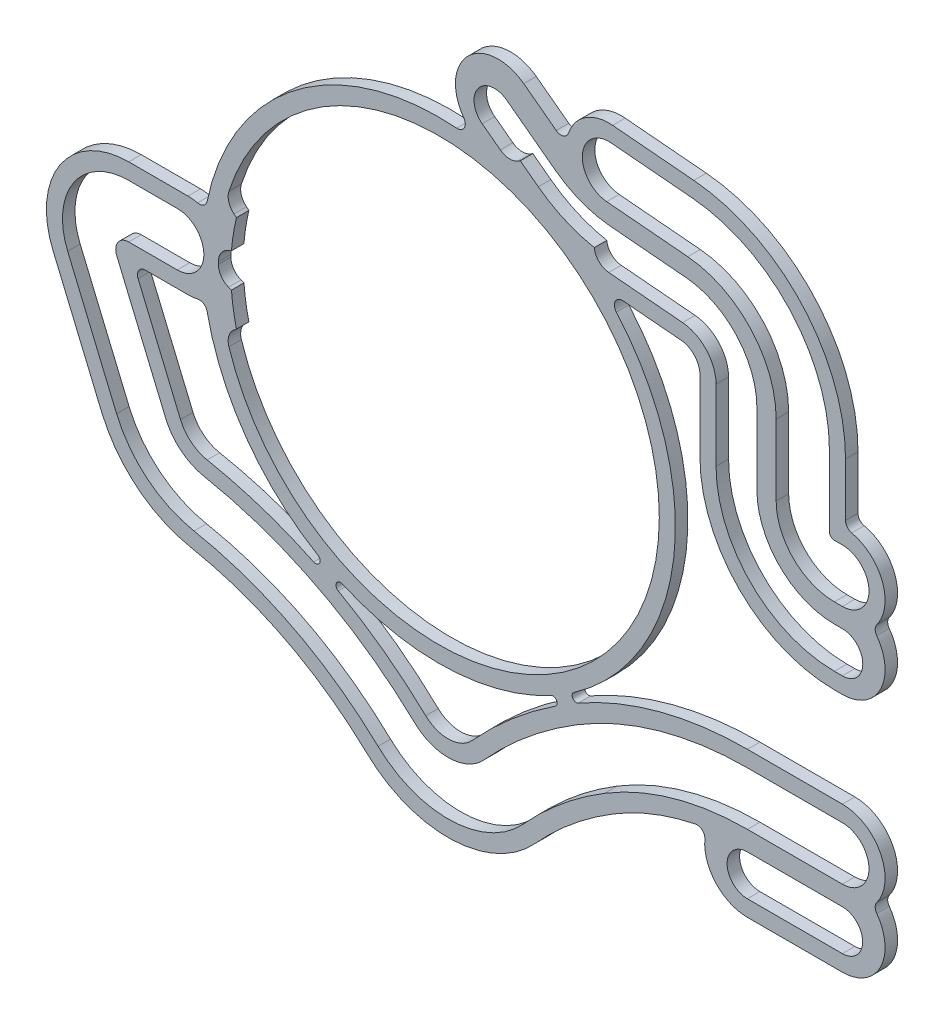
ISO-10303-21;
HEADER;
FILE_DESCRIPTION(('STEP AP214'),'2;1');
FILE_NAME('part.step','',(''),(''),'','','');
FILE_SCHEMA(('AUTOMOTIVE_DESIGN { 1 0 10303 214 1 1 1 1 }'));
ENDSEC;
DATA;
#1=APPLICATION_CONTEXT('core data for automotive mechanical design processes');
#2=APPLICATION_PROTOCOL_DEFINITION('international standard','automotive_design',2000,#1);
#3=PRODUCT_CONTEXT('',#1,'mechanical');
#4=PRODUCT('Part','Part','',(#3));
#5=PRODUCT_RELATED_PRODUCT_CATEGORY('part','',(#4));
#6=PRODUCT_DEFINITION_FORMATION('','',#4);
#7=PRODUCT_DEFINITION_CONTEXT('part definition',#1,'design');
#8=PRODUCT_DEFINITION('design','',#6,#7);
#9=PRODUCT_DEFINITION_SHAPE('','',#8);
#10=(LENGTH_UNIT() NAMED_UNIT(*) SI_UNIT(.MILLI.,.METRE.));
#11=(NAMED_UNIT(*) PLANE_ANGLE_UNIT() SI_UNIT($,.RADIAN.));
#12=(NAMED_UNIT(*) SI_UNIT($,.STERADIAN.) SOLID_ANGLE_UNIT());
#13=UNCERTAINTY_MEASURE_WITH_UNIT(LENGTH_MEASURE(1.E-05),#10,'distance_accuracy_value','');
#14=(GEOMETRIC_REPRESENTATION_CONTEXT(3) GLOBAL_UNCERTAINTY_ASSIGNED_CONTEXT((#13)) GLOBAL_UNIT_ASSIGNED_CONTEXT((#10,
#11,#12)) REPRESENTATION_CONTEXT('',''));
#15=CARTESIAN_POINT('',(0.,0.,0.));
#16=DIRECTION('',(0.,0.,1.));
#17=DIRECTION('',(1.,0.,0.));
#18=AXIS2_PLACEMENT_3D('',#15,#16,#17);
#19=CARTESIAN_POINT('',(56.7,-69.2775010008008,-1.79));
#20=DIRECTION('',(0.,0.,-1.));
#21=DIRECTION('',(-1.,0.,0.));
#22=AXIS2_PLACEMENT_3D('',#19,#20,#21);
#23=PLANE('',#22);
#24=CARTESIAN_POINT('',(56.7,-69.2775010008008,-1.79));
#25=DIRECTION('',(0.,0.,1.));
#26=DIRECTION('',(-1.,0.,0.));
#27=AXIS2_PLACEMENT_3D('',#24,#25,#26);
#28=CIRCLE('',#27,0.500000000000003);
#29=CARTESIAN_POINT('',(56.2,-69.2775010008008,-1.79));
#30=VERTEX_POINT('',#29);
#31=CARTESIAN_POINT('',(56.590625,-69.7653914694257,-1.79));
#32=VERTEX_POINT('',#31);
#33=EDGE_CURVE('E1359',#30,#32,#28,.T.);
#34=ORIENTED_EDGE('',*,*,#33,.T.);
#35=CARTESIAN_POINT('',(56.,-72.4,-1.79));
#36=DIRECTION('',(0.,0.,-1.));
#37=DIRECTION('',(-1.,0.,0.));
#38=AXIS2_PLACEMENT_3D('',#35,#36,#37);
#39=CIRCLE('',#38,2.7);
#40=CARTESIAN_POINT('',(58.1725538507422,-74.003125,-1.79));
#41=VERTEX_POINT('',#40);
#42=EDGE_CURVE('E1362',#32,#41,#39,.T.);
#43=ORIENTED_EDGE('',*,*,#42,.T.);
#44=CARTESIAN_POINT('',(58.5748786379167,-74.3,-1.79));
#45=DIRECTION('',(0.,0.,1.));
#46=DIRECTION('',(-1.,0.,0.));
#47=AXIS2_PLACEMENT_3D('',#44,#45,#46);
#48=CIRCLE('',#47,0.499999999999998);
#49=CARTESIAN_POINT('',(58.1725538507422,-74.596875,-1.79));
#50=VERTEX_POINT('',#49);
#51=EDGE_CURVE('E1365',#41,#50,#48,.T.);
#52=ORIENTED_EDGE('',*,*,#51,.T.);
#53=CARTESIAN_POINT('',(56.,-76.2,-1.79));
#54=DIRECTION('',(0.,0.,-1.));
#55=DIRECTION('',(-1.,0.,0.));
#56=AXIS2_PLACEMENT_3D('',#53,#54,#55);
#57=CIRCLE('',#56,2.69999999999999);
#58=CARTESIAN_POINT('',(56.,-78.9,-1.79));
#59=VERTEX_POINT('',#58);
#60=EDGE_CURVE('E1367',#50,#59,#57,.T.);
#61=ORIENTED_EDGE('',*,*,#60,.T.);
#62=DIRECTION('',(-1.,0.,0.));
#63=VECTOR('',#62,1.);
#64=CARTESIAN_POINT('',(56.,-78.9,-1.79));
#65=LINE('',#64,#63);
#66=CARTESIAN_POINT('',(55.5,-78.9,-1.79));
#67=VERTEX_POINT('',#66);
#68=EDGE_CURVE('E1369',#59,#67,#65,.T.);
#69=ORIENTED_EDGE('',*,*,#68,.T.);
#70=CARTESIAN_POINT('',(55.5,-70.4,-1.79));
#71=DIRECTION('',(0.,0.,-1.));
#72=DIRECTION('',(-1.,0.,0.));
#73=AXIS2_PLACEMENT_3D('',#70,#71,#72);
#74=CIRCLE('',#73,8.5);
#75=CARTESIAN_POINT('',(47.,-70.4,-1.79));
#76=VERTEX_POINT('',#75);
#77=EDGE_CURVE('E1371',#67,#76,#74,.T.);
#78=ORIENTED_EDGE('',*,*,#77,.T.);
#79=DIRECTION('',(0.,1.,0.));
#80=VECTOR('',#79,1.);
#81=CARTESIAN_POINT('',(47.,-70.4,-1.79));
#82=LINE('',#81,#80);
#83=CARTESIAN_POINT('',(47.,-65.9046039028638,-1.79));
#84=VERTEX_POINT('',#83);
#85=EDGE_CURVE('E1373',#76,#84,#82,.T.);
#86=ORIENTED_EDGE('',*,*,#85,.T.);
#87=CARTESIAN_POINT('',(45.7,-65.9046039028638,-1.79));
#88=DIRECTION('',(0.,0.,1.));
#89=DIRECTION('',(-1.,0.,0.));
#90=AXIS2_PLACEMENT_3D('',#87,#88,#89);
#91=CIRCLE('',#90,1.29999999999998);
#92=CARTESIAN_POINT('',(45.813302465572,-64.6095507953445,-1.79));
#93=VERTEX_POINT('',#92);
#94=EDGE_CURVE('E1375',#84,#93,#91,.T.);
#95=ORIENTED_EDGE('',*,*,#94,.T.);
#96=DIRECTION('',(-0.996194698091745,0.087155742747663,0.));
#97=VECTOR('',#96,1.);
#98=CARTESIAN_POINT('',(45.813302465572,-64.6095507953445,-1.79));
#99=LINE('',#98,#97);
#100=CARTESIAN_POINT('',(42.1355765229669,-64.2877914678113,-1.79));
#101=VERTEX_POINT('',#100);
#102=EDGE_CURVE('E1377',#93,#101,#99,.T.);
#103=ORIENTED_EDGE('',*,*,#102,.T.);
#104=CARTESIAN_POINT('',(42.091998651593,-64.7858888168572,-1.79));
#105=DIRECTION('',(0.,0.,1.));
#106=DIRECTION('',(-1.,0.,0.));
#107=AXIS2_PLACEMENT_3D('',#104,#105,#106);
#108=CIRCLE('',#107,0.500000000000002);
#109=CARTESIAN_POINT('',(41.7168530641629,-65.1164425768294,-1.79));
#110=VERTEX_POINT('',#109);
#111=EDGE_CURVE('E1379',#101,#110,#108,.T.);
#112=ORIENTED_EDGE('',*,*,#111,.T.);
#113=CARTESIAN_POINT('',(30.5,-75.,-1.79));
#114=DIRECTION('',(0.,0.,-1.));
#115=DIRECTION('',(-1.,0.,0.));
#116=AXIS2_PLACEMENT_3D('',#113,#114,#115);
#117=CIRCLE('',#116,14.9500000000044);
#118=CARTESIAN_POINT('',(39.0346938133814,-87.2744246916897,-1.79));
#119=VERTEX_POINT('',#118);
#120=EDGE_CURVE('E1381',#110,#119,#117,.T.);
#121=ORIENTED_EDGE('',*,*,#120,.T.);
#122=CARTESIAN_POINT('',(39.1833568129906,-87.4882288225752,-1.79));
#123=DIRECTION('',(0.,0.,1.));
#124=DIRECTION('',(-1.,0.,0.));
#125=AXIS2_PLACEMENT_3D('',#122,#123,#124);
#126=CIRCLE('',#125,0.260409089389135);
#127=CARTESIAN_POINT('',(39.3116218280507,-87.7148584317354,-1.79));
#128=VERTEX_POINT('',#127);
#129=EDGE_CURVE('E1383',#119,#128,#126,.T.);
#130=ORIENTED_EDGE('',*,*,#129,.T.);
#131=CARTESIAN_POINT('',(50.,-106.6,-1.79));
#132=DIRECTION('',(0.,0.,-1.));
#133=DIRECTION('',(-1.,0.,0.));
#134=AXIS2_PLACEMENT_3D('',#131,#132,#133);
#135=CIRCLE('',#134,21.7);
#136=CARTESIAN_POINT('',(50.,-84.9,-1.79));
#137=VERTEX_POINT('',#136);
#138=EDGE_CURVE('E1385',#128,#137,#135,.T.);
#139=ORIENTED_EDGE('',*,*,#138,.T.);
#140=DIRECTION('',(1.,0.,0.));
#141=VECTOR('',#140,1.);
#142=CARTESIAN_POINT('',(50.,-84.9,-1.79));
#143=LINE('',#142,#141);
#144=CARTESIAN_POINT('',(56.,-84.9,-1.79));
#145=VERTEX_POINT('',#144);
#146=EDGE_CURVE('E1387',#137,#145,#143,.T.);
#147=ORIENTED_EDGE('',*,*,#146,.T.);
#148=CARTESIAN_POINT('',(56.,-87.6,-1.79));
#149=DIRECTION('',(0.,0.,-1.));
#150=DIRECTION('',(-1.,0.,0.));
#151=AXIS2_PLACEMENT_3D('',#148,#149,#150);
#152=CIRCLE('',#151,2.69999999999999);
#153=CARTESIAN_POINT('',(58.1725538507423,-89.203125,-1.79));
#154=VERTEX_POINT('',#153);
#155=EDGE_CURVE('E1389',#145,#154,#152,.T.);
#156=ORIENTED_EDGE('',*,*,#155,.T.);
#157=CARTESIAN_POINT('',(58.5748786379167,-89.5,-1.79));
#158=DIRECTION('',(0.,0.,1.));
#159=DIRECTION('',(-1.,0.,0.));
#160=AXIS2_PLACEMENT_3D('',#157,#158,#159);
#161=CIRCLE('',#160,0.499999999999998);
#162=CARTESIAN_POINT('',(58.1725538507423,-89.796875,-1.79));
#163=VERTEX_POINT('',#162);
#164=EDGE_CURVE('E1391',#154,#163,#161,.T.);
#165=ORIENTED_EDGE('',*,*,#164,.T.);
#166=CARTESIAN_POINT('',(56.,-91.4,-1.79));
#167=DIRECTION('',(0.,0.,-1.));
#168=DIRECTION('',(-1.,0.,0.));
#169=AXIS2_PLACEMENT_3D('',#166,#167,#168);
#170=CIRCLE('',#169,2.69999999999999);
#171=CARTESIAN_POINT('',(56.,-94.1,-1.79));
#172=VERTEX_POINT('',#171);
#173=EDGE_CURVE('E1393',#163,#172,#170,.T.);
#174=ORIENTED_EDGE('',*,*,#173,.T.);
#175=DIRECTION('',(-1.,0.,0.));
#176=VECTOR('',#175,1.);
#177=CARTESIAN_POINT('',(56.,-94.1,-1.79));
#178=LINE('',#177,#176);
#179=CARTESIAN_POINT('',(50.,-94.1,-1.79));
#180=VERTEX_POINT('',#179);
#181=EDGE_CURVE('E1395',#172,#180,#178,.T.);
#182=ORIENTED_EDGE('',*,*,#181,.T.);
#183=CARTESIAN_POINT('',(50.,-91.4,-1.79));
#184=DIRECTION('',(0.,0.,-1.));
#185=DIRECTION('',(-1.,0.,0.));
#186=AXIS2_PLACEMENT_3D('',#183,#184,#185);
#187=CIRCLE('',#186,2.69999999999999);
#188=CARTESIAN_POINT('',(47.3099885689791,-91.16796875,-1.79));
#189=VERTEX_POINT('',#188);
#190=EDGE_CURVE('E1397',#180,#189,#187,.T.);
#191=ORIENTED_EDGE('',*,*,#190,.T.);
#192=CARTESIAN_POINT('',(46.8118383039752,-91.125,-1.79));
#193=DIRECTION('',(0.,0.,1.));
#194=DIRECTION('',(-1.,0.,0.));
#195=AXIS2_PLACEMENT_3D('',#192,#193,#194);
#196=CIRCLE('',#195,0.500000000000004);
#197=CARTESIAN_POINT('',(46.710947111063,-90.6352848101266,-1.79));
#198=VERTEX_POINT('',#197);
#199=EDGE_CURVE('E1399',#189,#198,#196,.T.);
#200=ORIENTED_EDGE('',*,*,#199,.T.);
#201=CARTESIAN_POINT('',(50.,-106.6,-1.79));
#202=DIRECTION('',(0.,0.,1.));
#203=DIRECTION('',(-1.,0.,0.));
#204=AXIS2_PLACEMENT_3D('',#201,#202,#203);
#205=CIRCLE('',#204,16.3);
#206=CARTESIAN_POINT('',(41.5110624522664,-92.6849743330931,-1.79));
#207=VERTEX_POINT('',#206);
#208=EDGE_CURVE('E1401',#198,#207,#205,.T.);
#209=ORIENTED_EDGE('',*,*,#208,.T.);
#210=CARTESIAN_POINT('',(53.1247622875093,-111.722095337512,-1.79));
#211=DIRECTION('',(0.,0.,1.));
#212=DIRECTION('',(-1.,0.,0.));
#213=AXIS2_PLACEMENT_3D('',#210,#211,#212);
#214=CIRCLE('',#213,22.3);
#215=CARTESIAN_POINT('',(36.6038760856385,-96.7437670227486,-1.79));
#216=VERTEX_POINT('',#215);
#217=EDGE_CURVE('E1403',#207,#216,#214,.T.);
#218=ORIENTED_EDGE('',*,*,#217,.T.);
#219=CARTESIAN_POINT('',(31.0845665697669,-91.7397963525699,-1.79));
#220=DIRECTION('',(0.,0.,-1.));
#221=DIRECTION('',(-1.,0.,0.));
#222=AXIS2_PLACEMENT_3D('',#219,#220,#221);
#223=CIRCLE('',#222,7.44999999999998);
#224=CARTESIAN_POINT('',(25.9603292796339,-97.1476325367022,-1.79));
#225=VERTEX_POINT('',#224);
#226=EDGE_CURVE('E1405',#216,#225,#223,.T.);
#227=ORIENTED_EDGE('',*,*,#226,.T.);
#228=CARTESIAN_POINT('',(10.6220082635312,-113.334846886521,-1.79));
#229=DIRECTION('',(0.,0.,1.));
#230=DIRECTION('',(-1.,0.,0.));
#231=AXIS2_PLACEMENT_3D('',#228,#229,#230);
#232=CIRCLE('',#231,22.3);
#233=CARTESIAN_POINT('',(14.8390766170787,-91.4372138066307,-1.79));
#234=VERTEX_POINT('',#233);
#235=EDGE_CURVE('E1407',#225,#234,#232,.T.);
#236=ORIENTED_EDGE('',*,*,#235,.T.);
#237=CARTESIAN_POINT('',(16.2951943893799,-83.8761476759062,-1.79));
#238=DIRECTION('',(0.,0.,-1.));
#239=DIRECTION('',(-1.,0.,0.));
#240=AXIS2_PLACEMENT_3D('',#237,#238,#239);
#241=CIRCLE('',#240,7.70000000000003);
#242=CARTESIAN_POINT('',(9.19788733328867,-86.8624886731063,-1.79));
#243=VERTEX_POINT('',#242);
#244=EDGE_CURVE('E1409',#234,#243,#241,.T.);
#245=ORIENTED_EDGE('',*,*,#244,.T.);
#246=DIRECTION('',(-0.38783649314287,0.921728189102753,0.));
#247=VECTOR('',#246,1.);
#248=CARTESIAN_POINT('',(9.19788733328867,-86.8624886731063,-1.79));
#249=LINE('',#248,#247);
#250=CARTESIAN_POINT('',(6.10701341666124,-79.5167497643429,-1.79));
#251=VERTEX_POINT('',#250);
#252=EDGE_CURVE('E1411',#243,#251,#249,.T.);
#253=ORIENTED_EDGE('',*,*,#252,.T.);
#254=CARTESIAN_POINT('',(10.8999999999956,-77.5,-1.79));
#255=DIRECTION('',(0.,0.,-1.));
#256=DIRECTION('',(-1.,0.,0.));
#257=AXIS2_PLACEMENT_3D('',#254,#255,#256);
#258=CIRCLE('',#257,5.2);
#259=CARTESIAN_POINT('',(10.8999999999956,-72.3,-1.79));
#260=VERTEX_POINT('',#259);
#261=EDGE_CURVE('E1413',#251,#260,#258,.T.);
#262=ORIENTED_EDGE('',*,*,#261,.T.);
#263=DIRECTION('',(1.,0.,0.));
#264=VECTOR('',#263,1.);
#265=CARTESIAN_POINT('',(14.6499999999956,-72.3,-1.79));
#266=LINE('',#265,#264);
#267=CARTESIAN_POINT('',(14.6499999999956,-72.3,-1.79));
#268=VERTEX_POINT('',#267);
#269=EDGE_CURVE('E1415',#260,#268,#266,.T.);
#270=ORIENTED_EDGE('',*,*,#269,.T.);
#271=CARTESIAN_POINT('',(14.6499999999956,-75.,-1.79));
#272=DIRECTION('',(0.,0.,-1.));
#273=DIRECTION('',(-1.,0.,0.));
#274=AXIS2_PLACEMENT_3D('',#271,#272,#273);
#275=CIRCLE('',#274,2.7);
#276=CARTESIAN_POINT('',(15.2557965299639,-72.368838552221,-1.79));
#277=VERTEX_POINT('',#276);
#278=EDGE_CURVE('E1417',#268,#277,#275,.T.);
#279=ORIENTED_EDGE('',*,*,#278,.T.);
#280=CARTESIAN_POINT('',(15.3679810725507,-71.881586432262,-1.79));
#281=DIRECTION('',(0.,0.,1.));
#282=DIRECTION('',(-1.,0.,0.));
#283=AXIS2_PLACEMENT_3D('',#280,#281,#282);
#284=CIRCLE('',#283,0.5);
#285=CARTESIAN_POINT('',(15.8576904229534,-71.9825059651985,-1.79));
#286=VERTEX_POINT('',#285);
#287=EDGE_CURVE('E1419',#277,#286,#284,.T.);
#288=ORIENTED_EDGE('',*,*,#287,.T.);
#289=CARTESIAN_POINT('',(30.5,-75.,-1.79));
#290=DIRECTION('',(0.,0.,-1.));
#291=DIRECTION('',(-1.,0.,0.));
#292=AXIS2_PLACEMENT_3D('',#289,#290,#291);
#293=CIRCLE('',#292,14.9500000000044);
#294=CARTESIAN_POINT('',(31.633132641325,-60.0930046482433,-1.79));
#295=VERTEX_POINT('',#294);
#296=EDGE_CURVE('E1421',#286,#295,#293,.T.);
#297=ORIENTED_EDGE('',*,*,#296,.T.);
#298=CARTESIAN_POINT('',(31.6710300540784,-59.5944429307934,-1.79));
#299=DIRECTION('',(0.,0.,1.));
#300=DIRECTION('',(-1.,0.,0.));
#301=AXIS2_PLACEMENT_3D('',#298,#299,#300);
#302=CIRCLE('',#301,0.500000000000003);
#303=CARTESIAN_POINT('',(32.0739941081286,-59.2984362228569,-1.79));
#304=VERTEX_POINT('',#303);
#305=EDGE_CURVE('E1423',#295,#304,#302,.T.);
#306=ORIENTED_EDGE('',*,*,#305,.T.);
#307=CARTESIAN_POINT('',(34.25,-57.7,-1.79));
#308=DIRECTION('',(0.,0.,-1.));
#309=DIRECTION('',(-1.,0.,0.));
#310=AXIS2_PLACEMENT_3D('',#307,#308,#309);
#311=CIRCLE('',#310,2.7);
#312=CARTESIAN_POINT('',(35.8677509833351,-55.5383150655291,-1.79));
#313=VERTEX_POINT('',#312);
#314=EDGE_CURVE('E1425',#304,#313,#311,.T.);
#315=ORIENTED_EDGE('',*,*,#314,.T.);
#316=DIRECTION('',(0.800624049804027,-0.599167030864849,0.));
#317=VECTOR('',#316,1.);
#318=CARTESIAN_POINT('',(35.8677509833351,-55.5383150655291,-1.79));
#319=LINE('',#318,#317);
#320=CARTESIAN_POINT('',(37.9195258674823,-57.0738121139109,-1.79));
#321=VERTEX_POINT('',#320);
#322=EDGE_CURVE('E1427',#313,#321,#319,.T.);
#323=ORIENTED_EDGE('',*,*,#322,.T.);
#324=CARTESIAN_POINT('',(38.2191093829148,-56.6735000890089,-1.79));
#325=DIRECTION('',(0.,0.,1.));
#326=DIRECTION('',(-1.,0.,0.));
#327=AXIS2_PLACEMENT_3D('',#324,#325,#326);
#328=CIRCLE('',#327,0.499999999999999);
#329=CARTESIAN_POINT('',(38.6926860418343,-56.8338907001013,-1.79));
#330=VERTEX_POINT('',#329);
#331=EDGE_CURVE('E1429',#321,#330,#328,.T.);
#332=ORIENTED_EDGE('',*,*,#331,.T.);
#333=CARTESIAN_POINT('',(41.25,-57.7,-1.79));
#334=DIRECTION('',(0.,0.,-1.));
#335=DIRECTION('',(-1.,0.,0.));
#336=AXIS2_PLACEMENT_3D('',#333,#334,#335);
#337=CIRCLE('',#336,2.7);
#338=CARTESIAN_POINT('',(41.4853205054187,-55.0102743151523,-1.79));
#339=VERTEX_POINT('',#338);
#340=EDGE_CURVE('E1431',#330,#339,#337,.T.);
#341=ORIENTED_EDGE('',*,*,#340,.T.);
#342=DIRECTION('',(0.996194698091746,-0.0871557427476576,0.));
#343=VECTOR('',#342,1.);
#344=CARTESIAN_POINT('',(41.4853205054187,-55.0102743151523,-1.79));
#345=LINE('',#344,#343);
#346=CARTESIAN_POINT('',(46.6151352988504,-55.4590749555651,-1.79));
#347=VERTEX_POINT('',#346);
#348=EDGE_CURVE('E1433',#339,#347,#345,.T.);
#349=ORIENTED_EDGE('',*,*,#348,.T.);
#350=CARTESIAN_POINT('',(45.7,-65.9191192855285,-1.79));
#351=DIRECTION('',(0.,0.,-1.));
#352=DIRECTION('',(-1.,0.,0.));
#353=AXIS2_PLACEMENT_3D('',#350,#351,#352);
#354=CIRCLE('',#353,10.5);
#355=CARTESIAN_POINT('',(56.2,-65.9191192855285,-1.79));
#356=VERTEX_POINT('',#355);
#357=EDGE_CURVE('E1435',#347,#356,#354,.T.);
#358=ORIENTED_EDGE('',*,*,#357,.T.);
#359=DIRECTION('',(0.,-1.,0.));
#360=VECTOR('',#359,1.);
#361=CARTESIAN_POINT('',(56.2,-65.9191192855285,-1.79));
#362=LINE('',#361,#360);
#363=EDGE_CURVE('E1437',#356,#30,#362,.T.);
#364=ORIENTED_EDGE('',*,*,#363,.T.);
#365=EDGE_LOOP('',(#34,#43,#52,#61,#69,#78,#86,#95,#103,#112,#121,#130,#139,#147,#156,#165,#174,
#182,#191,#200,#209,#218,#227,#236,#245,#253,#262,#270,#279,#288,#297,#306,#315,#323,#332,#341,
#349,#358,#364));
#366=FACE_BOUND('',#365,.T.);
#367=DIRECTION('',(-1.,0.,0.));
#368=VECTOR('',#367,1.);
#369=CARTESIAN_POINT('',(13.9674603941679,-76.6825396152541,-1.79));
#370=LINE('',#369,#368);
#371=CARTESIAN_POINT('',(13.9674603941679,-76.6825396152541,-1.79));
#372=VERTEX_POINT('',#371);
#373=CARTESIAN_POINT('',(10.8999999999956,-76.6825396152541,-1.79));
#374=VERTEX_POINT('',#373);
#375=EDGE_CURVE('E1218',#372,#374,#370,.T.);
#376=ORIENTED_EDGE('',*,*,#375,.F.);
#377=CARTESIAN_POINT('',(13.9674603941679,-75.,-1.79));
#378=DIRECTION('',(0.,0.,-1.));
#379=DIRECTION('',(-1.,0.,0.));
#380=AXIS2_PLACEMENT_3D('',#377,#378,#379);
#381=CIRCLE('',#380,1.68253961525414);
#382=CARTESIAN_POINT('',(13.9674603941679,-73.3174603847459,-1.79));
#383=VERTEX_POINT('',#382);
#384=EDGE_CURVE('E1216',#383,#372,#381,.T.);
#385=ORIENTED_EDGE('',*,*,#384,.F.);
#386=DIRECTION('',(1.,0.,0.));
#387=VECTOR('',#386,1.);
#388=CARTESIAN_POINT('',(10.8999999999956,-73.3174603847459,-1.79));
#389=LINE('',#388,#387);
#390=CARTESIAN_POINT('',(10.8999999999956,-73.3174603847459,-1.79));
#391=VERTEX_POINT('',#390);
#392=EDGE_CURVE('E1256',#391,#383,#389,.T.);
#393=ORIENTED_EDGE('',*,*,#392,.F.);
#394=CARTESIAN_POINT('',(10.8999999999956,-77.5,-1.79));
#395=DIRECTION('',(0.,0.,-1.));
#396=DIRECTION('',(-1.,0.,0.));
#397=AXIS2_PLACEMENT_3D('',#394,#395,#396);
#398=CIRCLE('',#397,4.18253961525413);
#399=CARTESIAN_POINT('',(7.04483533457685,-79.1221414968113,-1.79));
#400=VERTEX_POINT('',#399);
#401=EDGE_CURVE('E1253',#400,#391,#398,.T.);
#402=ORIENTED_EDGE('',*,*,#401,.F.);
#403=DIRECTION('',(-0.387836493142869,0.921728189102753,0.));
#404=VECTOR('',#403,1.);
#405=CARTESIAN_POINT('',(10.1357092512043,-86.4678804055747,-1.79));
#406=LINE('',#405,#404);
#407=CARTESIAN_POINT('',(10.1357092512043,-86.4678804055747,-1.79));
#408=VERTEX_POINT('',#407);
#409=EDGE_CURVE('E1251',#408,#400,#406,.T.);
#410=ORIENTED_EDGE('',*,*,#409,.F.);
#411=CARTESIAN_POINT('',(16.2951943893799,-83.8761476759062,-1.79));
#412=DIRECTION('',(0.,0.,-1.));
#413=DIRECTION('',(-1.,0.,0.));
#414=AXIS2_PLACEMENT_3D('',#411,#412,#413);
#415=CIRCLE('',#414,6.68253961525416);
#416=CARTESIAN_POINT('',(15.0314846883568,-90.4381118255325,-1.79));
#417=VERTEX_POINT('',#416);
#418=EDGE_CURVE('E1249',#417,#408,#415,.T.);
#419=ORIENTED_EDGE('',*,*,#418,.F.);
#420=CARTESIAN_POINT('',(10.6220082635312,-113.334846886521,-1.79));
#421=DIRECTION('',(0.,0.,1.));
#422=DIRECTION('',(-1.,0.,0.));
#423=AXIS2_PLACEMENT_3D('',#420,#421,#422);
#424=CIRCLE('',#423,23.3174603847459);
#425=CARTESIAN_POINT('',(26.6601559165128,-96.4090742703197,-1.79));
#426=VERTEX_POINT('',#425);
#427=EDGE_CURVE('E1247',#426,#417,#424,.T.);
#428=ORIENTED_EDGE('',*,*,#427,.F.);
#429=CARTESIAN_POINT('',(31.0845665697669,-91.7397963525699,-1.79));
#430=DIRECTION('',(0.,0.,-1.));
#431=DIRECTION('',(-1.,0.,0.));
#432=AXIS2_PLACEMENT_3D('',#429,#430,#431);
#433=CIRCLE('',#432,6.43253961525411);
#434=CARTESIAN_POINT('',(35.8500936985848,-96.0603654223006,-1.79));
#435=VERTEX_POINT('',#434);
#436=EDGE_CURVE('E1245',#435,#426,#433,.T.);
#437=ORIENTED_EDGE('',*,*,#436,.F.);
#438=CARTESIAN_POINT('',(53.1247622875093,-111.722095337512,-1.79));
#439=DIRECTION('',(0.,0.,1.));
#440=DIRECTION('',(-1.,0.,0.));
#441=AXIS2_PLACEMENT_3D('',#438,#439,#440);
#442=CIRCLE('',#441,23.3174603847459);
#443=CARTESIAN_POINT('',(40.9811754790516,-91.8163861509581,-1.79));
#444=VERTEX_POINT('',#443);
#445=EDGE_CURVE('E1243',#444,#435,#442,.T.);
#446=ORIENTED_EDGE('',*,*,#445,.F.);
#447=CARTESIAN_POINT('',(50.,-106.6,-1.79));
#448=DIRECTION('',(0.,0.,1.));
#449=DIRECTION('',(-1.,0.,0.));
#450=AXIS2_PLACEMENT_3D('',#447,#448,#449);
#451=CIRCLE('',#450,17.3174603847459);
#452=CARTESIAN_POINT('',(50.,-89.2825396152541,-1.79));
#453=VERTEX_POINT('',#452);
#454=EDGE_CURVE('E1241',#453,#444,#451,.T.);
#455=ORIENTED_EDGE('',*,*,#454,.F.);
#456=DIRECTION('',(-1.,0.,0.));
#457=VECTOR('',#456,1.);
#458=CARTESIAN_POINT('',(56.,-89.2825396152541,-1.79));
#459=LINE('',#458,#457);
#460=CARTESIAN_POINT('',(56.,-89.2825396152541,-1.79));
#461=VERTEX_POINT('',#460);
#462=EDGE_CURVE('E1239',#461,#453,#459,.T.);
#463=ORIENTED_EDGE('',*,*,#462,.F.);
#464=CARTESIAN_POINT('',(56.,-87.6,-1.79));
#465=DIRECTION('',(0.,0.,-1.));
#466=DIRECTION('',(-1.,0.,0.));
#467=AXIS2_PLACEMENT_3D('',#464,#465,#466);
#468=CIRCLE('',#467,1.68253961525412);
#469=CARTESIAN_POINT('',(56.,-85.9174603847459,-1.79));
#470=VERTEX_POINT('',#469);
#471=EDGE_CURVE('E1237',#470,#461,#468,.T.);
#472=ORIENTED_EDGE('',*,*,#471,.F.);
#473=DIRECTION('',(1.,0.,0.));
#474=VECTOR('',#473,1.);
#475=CARTESIAN_POINT('',(50.,-85.9174603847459,-1.79));
#476=LINE('',#475,#474);
#477=CARTESIAN_POINT('',(50.,-85.9174603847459,-1.79));
#478=VERTEX_POINT('',#477);
#479=EDGE_CURVE('E1235',#478,#470,#476,.T.);
#480=ORIENTED_EDGE('',*,*,#479,.F.);
#481=CARTESIAN_POINT('',(50.,-106.6,-1.79));
#482=DIRECTION('',(0.,0.,-1.));
#483=DIRECTION('',(-1.,0.,0.));
#484=AXIS2_PLACEMENT_3D('',#481,#482,#483);
#485=CIRCLE('',#484,20.6825396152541);
#486=CARTESIAN_POINT('',(39.2286633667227,-88.9436767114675,-1.79));
#487=VERTEX_POINT('',#486);
#488=EDGE_CURVE('E1233',#487,#478,#485,.T.);
#489=ORIENTED_EDGE('',*,*,#488,.F.);
#490=CARTESIAN_POINT('',(53.1247622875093,-111.722095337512,-1.79));
#491=DIRECTION('',(0.,0.,-1.));
#492=DIRECTION('',(-1.,0.,0.));
#493=AXIS2_PLACEMENT_3D('',#490,#491,#492);
#494=CIRCLE('',#493,26.6825396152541);
#495=CARTESIAN_POINT('',(33.3570851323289,-93.8001294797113,-1.79));
#496=VERTEX_POINT('',#495);
#497=EDGE_CURVE('E1231',#496,#487,#494,.T.);
#498=ORIENTED_EDGE('',*,*,#497,.F.);
#499=CARTESIAN_POINT('',(31.0845665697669,-91.7397963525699,-1.79));
#500=DIRECTION('',(0.,0.,1.));
#501=DIRECTION('',(-1.,0.,0.));
#502=AXIS2_PLACEMENT_3D('',#499,#500,#501);
#503=CIRCLE('',#502,3.06746038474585);
#504=CARTESIAN_POINT('',(28.974714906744,-93.9664169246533,-1.79));
#505=VERTEX_POINT('',#504);
#506=EDGE_CURVE('E1229',#505,#496,#503,.T.);
#507=ORIENTED_EDGE('',*,*,#506,.F.);
#508=CARTESIAN_POINT('',(10.6220082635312,-113.334846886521,-1.79));
#509=DIRECTION('',(0.,0.,-1.));
#510=DIRECTION('',(-1.,0.,0.));
#511=AXIS2_PLACEMENT_3D('',#508,#509,#510);
#512=CIRCLE('',#511,26.6825396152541);
#513=CARTESIAN_POINT('',(15.6678420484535,-87.1337499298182,-1.79));
#514=VERTEX_POINT('',#513);
#515=EDGE_CURVE('E1227',#514,#505,#512,.T.);
#516=ORIENTED_EDGE('',*,*,#515,.F.);
#517=CARTESIAN_POINT('',(16.2951943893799,-83.8761476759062,-1.79));
#518=DIRECTION('',(0.,0.,1.));
#519=DIRECTION('',(-1.,0.,0.));
#520=AXIS2_PLACEMENT_3D('',#517,#518,#519);
#521=CIRCLE('',#520,3.3174603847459);
#522=CARTESIAN_POINT('',(13.2373976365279,-85.1627798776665,-1.79));
#523=VERTEX_POINT('',#522);
#524=EDGE_CURVE('E1225',#523,#514,#521,.T.);
#525=ORIENTED_EDGE('',*,*,#524,.F.);
#526=DIRECTION('',(0.38783649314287,-0.921728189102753,0.));
#527=VECTOR('',#526,1.);
#528=CARTESIAN_POINT('',(10.1465237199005,-77.8170409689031,-1.79));
#529=LINE('',#528,#527);
#530=CARTESIAN_POINT('',(10.1465237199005,-77.8170409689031,-1.79));
#531=VERTEX_POINT('',#530);
#532=EDGE_CURVE('E1223',#531,#523,#529,.T.);
#533=ORIENTED_EDGE('',*,*,#532,.F.);
#534=CARTESIAN_POINT('',(10.8999999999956,-77.5,-1.79));
#535=DIRECTION('',(0.,0.,1.));
#536=DIRECTION('',(-1.,0.,0.));
#537=AXIS2_PLACEMENT_3D('',#534,#535,#536);
#538=CIRCLE('',#537,0.817460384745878);
#539=EDGE_CURVE('E1221',#374,#531,#538,.T.);
#540=ORIENTED_EDGE('',*,*,#539,.F.);
#541=EDGE_LOOP('',(#376,#385,#393,#402,#410,#419,#428,#437,#446,#455,#463,#472,#480,#489,#498,
#507,#516,#525,#533,#540));
#542=FACE_BOUND('',#541,.T.);
#543=CARTESIAN_POINT('',(22.7117827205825,-88.0949690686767,-1.79));
#544=DIRECTION('',(0.,0.,-1.));
#545=DIRECTION('',(-1.,0.,0.));
#546=AXIS2_PLACEMENT_3D('',#543,#544,#545);
#547=CIRCLE('',#546,0.285962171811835);
#548=CARTESIAN_POINT('',(22.8579589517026,-87.849190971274,-1.79));
#549=VERTEX_POINT('',#548);
#550=CARTESIAN_POINT('',(22.5882487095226,-88.3528715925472,-1.79));
#551=VERTEX_POINT('',#550);
#552=EDGE_CURVE('E1152',#549,#551,#547,.T.);
#553=ORIENTED_EDGE('',*,*,#552,.F.);
#554=CARTESIAN_POINT('',(30.5,-75.,-1.79));
#555=DIRECTION('',(0.,0.,1.));
#556=DIRECTION('',(-1.,0.,0.));
#557=AXIS2_PLACEMENT_3D('',#554,#555,#556);
#558=CIRCLE('',#557,14.9500000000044);
#559=CARTESIAN_POINT('',(15.8576904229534,-78.0174940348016,-1.79));
#560=VERTEX_POINT('',#559);
#561=EDGE_CURVE('E1150',#560,#549,#558,.T.);
#562=ORIENTED_EDGE('',*,*,#561,.F.);
#563=CARTESIAN_POINT('',(15.3679810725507,-78.118413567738,-1.79));
#564=DIRECTION('',(0.,0.,-1.));
#565=DIRECTION('',(-1.,0.,0.));
#566=AXIS2_PLACEMENT_3D('',#563,#564,#565);
#567=CIRCLE('',#566,0.499999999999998);
#568=CARTESIAN_POINT('',(15.2557965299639,-77.631161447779,-1.79));
#569=VERTEX_POINT('',#568);
#570=EDGE_CURVE('E1168',#569,#560,#567,.T.);
#571=ORIENTED_EDGE('',*,*,#570,.F.);
#572=CARTESIAN_POINT('',(14.6499999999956,-75.,-1.79));
#573=DIRECTION('',(0.,0.,1.));
#574=DIRECTION('',(-1.,0.,0.));
#575=AXIS2_PLACEMENT_3D('',#572,#573,#574);
#576=CIRCLE('',#575,2.69999999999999);
#577=CARTESIAN_POINT('',(14.6499999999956,-77.7,-1.79));
#578=VERTEX_POINT('',#577);
#579=EDGE_CURVE('E1165',#578,#569,#576,.T.);
#580=ORIENTED_EDGE('',*,*,#579,.F.);
#581=DIRECTION('',(1.,0.,0.));
#582=VECTOR('',#581,1.);
#583=CARTESIAN_POINT('',(14.6499999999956,-77.7,-1.79));
#584=LINE('',#583,#582);
#585=CARTESIAN_POINT('',(11.9539826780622,-77.7,-1.79));
#586=VERTEX_POINT('',#585);
#587=EDGE_CURVE('E1163',#586,#578,#584,.T.);
#588=ORIENTED_EDGE('',*,*,#587,.F.);
#589=CARTESIAN_POINT('',(11.9539826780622,-78.2,-1.79));
#590=DIRECTION('',(0.,0.,-1.));
#591=DIRECTION('',(-1.,0.,0.));
#592=AXIS2_PLACEMENT_3D('',#589,#590,#591);
#593=CIRCLE('',#592,0.499999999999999);
#594=CARTESIAN_POINT('',(11.4931185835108,-78.3939182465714,-1.79));
#595=VERTEX_POINT('',#594);
#596=EDGE_CURVE('E1161',#595,#586,#593,.T.);
#597=ORIENTED_EDGE('',*,*,#596,.F.);
#598=DIRECTION('',(-0.38783649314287,0.921728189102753,0.));
#599=VECTOR('',#598,1.);
#600=CARTESIAN_POINT('',(11.4931185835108,-78.3939182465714,-1.79));
#601=LINE('',#600,#599);
#602=CARTESIAN_POINT('',(14.1752195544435,-84.7681716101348,-1.79));
#603=VERTEX_POINT('',#602);
#604=EDGE_CURVE('E1159',#603,#595,#601,.T.);
#605=ORIENTED_EDGE('',*,*,#604,.F.);
#606=CARTESIAN_POINT('',(16.2951943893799,-83.8761476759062,-1.79));
#607=DIRECTION('',(0.,0.,-1.));
#608=DIRECTION('',(-1.,0.,0.));
#609=AXIS2_PLACEMENT_3D('',#606,#607,#608);
#610=CIRCLE('',#609,2.30000000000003);
#611=CARTESIAN_POINT('',(15.8602501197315,-86.13464794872,-1.79));
#612=VERTEX_POINT('',#611);
#613=EDGE_CURVE('E1157',#612,#603,#610,.T.);
#614=ORIENTED_EDGE('',*,*,#613,.F.);
#615=CARTESIAN_POINT('',(10.6220082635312,-113.334846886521,-1.79));
#616=DIRECTION('',(0.,0.,1.));
#617=DIRECTION('',(-1.,0.,0.));
#618=AXIS2_PLACEMENT_3D('',#615,#616,#617);
#619=CIRCLE('',#618,27.7);
#620=EDGE_CURVE('E1155',#551,#612,#619,.T.);
#621=ORIENTED_EDGE('',*,*,#620,.F.);
#622=EDGE_LOOP('',(#553,#562,#571,#580,#588,#597,#605,#614,#621));
#623=FACE_BOUND('',#622,.T.);
#624=DIRECTION('',(0.933885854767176,0.357571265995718,0.));
#625=VECTOR('',#624,1.);
#626=CARTESIAN_POINT('',(16.5885477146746,-74.2337393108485,-1.79));
#627=LINE('',#626,#625);
#628=CARTESIAN_POINT('',(17.2100804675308,-73.99576348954,-1.79));
#629=VERTEX_POINT('',#628);
#630=CARTESIAN_POINT('',(17.3939851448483,-73.925349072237,-1.79));
#631=VERTEX_POINT('',#630);
#632=EDGE_CURVE('E1100',#629,#631,#627,.T.);
#633=ORIENTED_EDGE('',*,*,#632,.F.);
#634=CARTESIAN_POINT('',(17.5676517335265,-74.9296493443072,-1.79));
#635=DIRECTION('',(0.,0.,-1.));
#636=DIRECTION('',(-1.,0.,0.));
#637=AXIS2_PLACEMENT_3D('',#634,#635,#636);
#638=CIRCLE('',#637,1.);
#639=CARTESIAN_POINT('',(16.5676665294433,-74.9242095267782,-1.79));
#640=VERTEX_POINT('',#639);
#641=EDGE_CURVE('E1666',#629,#640,#638,.F.);
#642=ORIENTED_EDGE('',*,*,#641,.T.);
#643=CARTESIAN_POINT('',(30.5,-75.,-1.79));
#644=DIRECTION('',(0.,0.,-1.));
#645=DIRECTION('',(1.,0.,0.));
#646=AXIS2_PLACEMENT_3D('',#643,#644,#645);
#647=CIRCLE('',#646,13.9325396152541);
#648=CARTESIAN_POINT('',(16.5676665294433,-75.0757904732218,-1.79));
#649=VERTEX_POINT('',#648);
#650=EDGE_CURVE('E1097',#649,#640,#647,.T.);
#651=ORIENTED_EDGE('',*,*,#650,.F.);
#652=CARTESIAN_POINT('',(17.5676517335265,-75.0703506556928,-1.79));
#653=DIRECTION('',(0.,0.,-1.));
#654=DIRECTION('',(-1.,0.,0.));
#655=AXIS2_PLACEMENT_3D('',#652,#653,#654);
#656=CIRCLE('',#655,1.);
#657=CARTESIAN_POINT('',(17.2100804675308,-76.00423651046,-1.79));
#658=VERTEX_POINT('',#657);
#659=EDGE_CURVE('E1662',#649,#658,#656,.F.);
#660=ORIENTED_EDGE('',*,*,#659,.T.);
#661=DIRECTION('',(-0.933885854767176,0.357571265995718,0.));
#662=VECTOR('',#661,1.);
#663=CARTESIAN_POINT('',(16.5885477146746,-75.7662606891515,-1.79));
#664=LINE('',#663,#662);
#665=CARTESIAN_POINT('',(17.3939851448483,-76.074650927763,-1.79));
#666=VERTEX_POINT('',#665);
#667=EDGE_CURVE('E1116',#666,#658,#664,.T.);
#668=ORIENTED_EDGE('',*,*,#667,.F.);
#669=CARTESIAN_POINT('',(30.5,-75.,-1.79));
#670=DIRECTION('',(0.,0.,-1.));
#671=DIRECTION('',(-1.,0.,0.));
#672=AXIS2_PLACEMENT_3D('',#669,#670,#671);
#673=CIRCLE('',#672,13.15);
#674=CARTESIAN_POINT('',(17.7085393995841,-78.0497599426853,-1.79));
#675=VERTEX_POINT('',#674);
#676=EDGE_CURVE('E1113',#675,#666,#673,.T.);
#677=ORIENTED_EDGE('',*,*,#676,.F.);
#678=DIRECTION('',(0.776608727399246,0.629983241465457,0.));
#679=VECTOR('',#678,1.);
#680=CARTESIAN_POINT('',(17.0387469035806,-78.5930940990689,-1.79));
#681=LINE('',#680,#679);
#682=CARTESIAN_POINT('',(17.5556063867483,-78.1738188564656,-1.79));
#683=VERTEX_POINT('',#682);
#684=EDGE_CURVE('E1111',#683,#675,#681,.T.);
#685=ORIENTED_EDGE('',*,*,#684,.F.);
#686=CARTESIAN_POINT('',(18.1855896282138,-78.9504275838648,-1.79));
#687=DIRECTION('',(0.,0.,-1.));
#688=DIRECTION('',(-1.,0.,0.));
#689=AXIS2_PLACEMENT_3D('',#686,#687,#688);
#690=CIRCLE('',#689,1.);
#691=CARTESIAN_POINT('',(17.2333860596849,-79.2558917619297,-1.79));
#692=VERTEX_POINT('',#691);
#693=EDGE_CURVE('E1670',#683,#692,#690,.F.);
#694=ORIENTED_EDGE('',*,*,#693,.T.);
#695=CARTESIAN_POINT('',(30.5,-75.,-1.79));
#696=DIRECTION('',(0.,0.,-1.));
#697=DIRECTION('',(-1.,0.,0.));
#698=AXIS2_PLACEMENT_3D('',#695,#696,#697);
#699=CIRCLE('',#698,13.9325396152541);
#700=CARTESIAN_POINT('',(17.2333860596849,-70.7441082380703,-1.79));
#701=VERTEX_POINT('',#700);
#702=EDGE_CURVE('E1108',#701,#692,#699,.T.);
#703=ORIENTED_EDGE('',*,*,#702,.F.);
#704=CARTESIAN_POINT('',(18.1855896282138,-71.0495724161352,-1.79));
#705=DIRECTION('',(0.,0.,-1.));
#706=DIRECTION('',(-1.,0.,0.));
#707=AXIS2_PLACEMENT_3D('',#704,#705,#706);
#708=CIRCLE('',#707,1.);
#709=CARTESIAN_POINT('',(17.5556063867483,-71.8261811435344,-1.79));
#710=VERTEX_POINT('',#709);
#711=EDGE_CURVE('E1674',#701,#710,#708,.F.);
#712=ORIENTED_EDGE('',*,*,#711,.T.);
#713=DIRECTION('',(-0.776608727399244,0.629983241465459,0.));
#714=VECTOR('',#713,1.);
#715=CARTESIAN_POINT('',(17.0387469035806,-71.4069059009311,-1.79));
#716=LINE('',#715,#714);
#717=CARTESIAN_POINT('',(17.7085393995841,-71.9502400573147,-1.79));
#718=VERTEX_POINT('',#717);
#719=EDGE_CURVE('E1105',#718,#710,#716,.T.);
#720=ORIENTED_EDGE('',*,*,#719,.F.);
#721=CARTESIAN_POINT('',(30.5,-75.,-1.79));
#722=DIRECTION('',(0.,0.,-1.));
#723=DIRECTION('',(-1.,0.,0.));
#724=AXIS2_PLACEMENT_3D('',#721,#722,#723);
#725=CIRCLE('',#724,13.15);
#726=EDGE_CURVE('E1103',#631,#718,#725,.T.);
#727=ORIENTED_EDGE('',*,*,#726,.F.);
#728=EDGE_LOOP('',(#633,#642,#651,#660,#668,#677,#685,#694,#703,#712,#720,#727));
#729=FACE_BOUND('',#728,.T.);
#730=DIRECTION('',(-1.,0.,0.));
#731=VECTOR('',#730,1.);
#732=CARTESIAN_POINT('',(56.,-93.0825396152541,-1.79));
#733=LINE('',#732,#731);
#734=CARTESIAN_POINT('',(56.,-93.0825396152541,-1.79));
#735=VERTEX_POINT('',#734);
#736=CARTESIAN_POINT('',(50.,-93.0825396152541,-1.79));
#737=VERTEX_POINT('',#736);
#738=EDGE_CURVE('E1068',#735,#737,#733,.T.);
#739=ORIENTED_EDGE('',*,*,#738,.F.);
#740=CARTESIAN_POINT('',(56.,-91.8,-1.79));
#741=DIRECTION('',(0.,0.,-1.));
#742=DIRECTION('',(-1.,0.,0.));
#743=AXIS2_PLACEMENT_3D('',#740,#741,#742);
#744=CIRCLE('',#743,1.28253961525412);
#745=CARTESIAN_POINT('',(56.,-90.5174603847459,-1.79));
#746=VERTEX_POINT('',#745);
#747=EDGE_CURVE('E1066',#746,#735,#744,.T.);
#748=ORIENTED_EDGE('',*,*,#747,.F.);
#749=DIRECTION('',(1.,0.,0.));
#750=VECTOR('',#749,1.);
#751=CARTESIAN_POINT('',(56.,-90.5174603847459,-1.79));
#752=LINE('',#751,#750);
#753=CARTESIAN_POINT('',(50.,-90.5174603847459,-1.79));
#754=VERTEX_POINT('',#753);
#755=EDGE_CURVE('E1074',#754,#746,#752,.T.);
#756=ORIENTED_EDGE('',*,*,#755,.F.);
#757=CARTESIAN_POINT('',(50.,-91.8,-1.79));
#758=DIRECTION('',(0.,0.,-1.));
#759=DIRECTION('',(1.,0.,0.));
#760=AXIS2_PLACEMENT_3D('',#757,#758,#759);
#761=CIRCLE('',#760,1.28253961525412);
#762=EDGE_CURVE('E1071',#737,#754,#761,.T.);
#763=ORIENTED_EDGE('',*,*,#762,.F.);
#764=EDGE_LOOP('',(#739,#748,#756,#763));
#765=FACE_BOUND('',#764,.T.);
#766=DIRECTION('',(-0.996194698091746,0.0871557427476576,0.));
#767=VECTOR('',#766,1.);
#768=CARTESIAN_POINT('',(46.2331718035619,-59.8249376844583,-1.79));
#769=LINE('',#768,#767);
#770=CARTESIAN_POINT('',(46.2331718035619,-59.8249376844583,-1.79));
#771=VERTEX_POINT('',#770);
#772=CARTESIAN_POINT('',(41.1033570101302,-59.3761370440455,-1.79));
#773=VERTEX_POINT('',#772);
#774=EDGE_CURVE('E981',#771,#773,#769,.T.);
#775=ORIENTED_EDGE('',*,*,#774,.F.);
#776=CARTESIAN_POINT('',(45.7,-65.9191192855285,-1.79));
#777=DIRECTION('',(0.,0.,1.));
#778=DIRECTION('',(-1.,0.,0.));
#779=AXIS2_PLACEMENT_3D('',#776,#777,#778);
#780=CIRCLE('',#779,6.11746038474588);
#781=CARTESIAN_POINT('',(51.8174603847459,-65.9191192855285,-1.79));
#782=VERTEX_POINT('',#781);
#783=EDGE_CURVE('E979',#782,#771,#780,.T.);
#784=ORIENTED_EDGE('',*,*,#783,.F.);
#785=DIRECTION('',(0.,1.,0.));
#786=VECTOR('',#785,1.);
#787=CARTESIAN_POINT('',(51.8174603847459,-70.4,-1.79));
#788=LINE('',#787,#786);
#789=CARTESIAN_POINT('',(51.8174603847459,-70.4,-1.79));
#790=VERTEX_POINT('',#789);
#791=EDGE_CURVE('E1003',#790,#782,#788,.T.);
#792=ORIENTED_EDGE('',*,*,#791,.F.);
#793=CARTESIAN_POINT('',(55.5,-70.4,-1.79));
#794=DIRECTION('',(0.,0.,-1.));
#795=DIRECTION('',(-1.,0.,0.));
#796=AXIS2_PLACEMENT_3D('',#793,#794,#795);
#797=CIRCLE('',#796,3.68253961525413);
#798=CARTESIAN_POINT('',(55.5,-74.0825396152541,-1.79));
#799=VERTEX_POINT('',#798);
#800=EDGE_CURVE('E1000',#799,#790,#797,.T.);
#801=ORIENTED_EDGE('',*,*,#800,.F.);
#802=DIRECTION('',(-1.,0.,0.));
#803=VECTOR('',#802,1.);
#804=CARTESIAN_POINT('',(56.,-74.0825396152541,-1.79));
#805=LINE('',#804,#803);
#806=CARTESIAN_POINT('',(56.,-74.0825396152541,-1.79));
#807=VERTEX_POINT('',#806);
#808=EDGE_CURVE('E998',#807,#799,#805,.T.);
#809=ORIENTED_EDGE('',*,*,#808,.F.);
#810=CARTESIAN_POINT('',(56.,-72.4,-1.79));
#811=DIRECTION('',(0.,0.,-1.));
#812=DIRECTION('',(-1.,0.,0.));
#813=AXIS2_PLACEMENT_3D('',#810,#811,#812);
#814=CIRCLE('',#813,1.68253961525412);
#815=CARTESIAN_POINT('',(56.,-70.7174603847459,-1.79));
#816=VERTEX_POINT('',#815);
#817=EDGE_CURVE('E996',#816,#807,#814,.T.);
#818=ORIENTED_EDGE('',*,*,#817,.F.);
#819=DIRECTION('',(1.,0.,0.));
#820=VECTOR('',#819,1.);
#821=CARTESIAN_POINT('',(55.5,-70.7174603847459,-1.79));
#822=LINE('',#821,#820);
#823=CARTESIAN_POINT('',(55.5,-70.7174603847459,-1.79));
#824=VERTEX_POINT('',#823);
#825=EDGE_CURVE('E994',#824,#816,#822,.T.);
#826=ORIENTED_EDGE('',*,*,#825,.F.);
#827=CARTESIAN_POINT('',(55.5,-70.4,-1.79));
#828=DIRECTION('',(0.,0.,1.));
#829=DIRECTION('',(-1.,0.,0.));
#830=AXIS2_PLACEMENT_3D('',#827,#828,#829);
#831=CIRCLE('',#830,0.317460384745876);
#832=CARTESIAN_POINT('',(55.1825396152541,-70.4,-1.79));
#833=VERTEX_POINT('',#832);
#834=EDGE_CURVE('E992',#833,#824,#831,.T.);
#835=ORIENTED_EDGE('',*,*,#834,.F.);
#836=DIRECTION('',(0.,-1.,0.));
#837=VECTOR('',#836,1.);
#838=CARTESIAN_POINT('',(55.1825396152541,-65.9191192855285,-1.79));
#839=LINE('',#838,#837);
#840=CARTESIAN_POINT('',(55.1825396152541,-65.9191192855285,-1.79));
#841=VERTEX_POINT('',#840);
#842=EDGE_CURVE('E990',#841,#833,#839,.T.);
#843=ORIENTED_EDGE('',*,*,#842,.F.);
#844=CARTESIAN_POINT('',(45.7,-65.9191192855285,-1.79));
#845=DIRECTION('',(0.,0.,-1.));
#846=DIRECTION('',(-1.,0.,0.));
#847=AXIS2_PLACEMENT_3D('',#844,#845,#846);
#848=CIRCLE('',#847,9.48253961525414);
#849=CARTESIAN_POINT('',(46.5264577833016,-56.4726635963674,-1.79));
#850=VERTEX_POINT('',#849);
#851=EDGE_CURVE('E988',#850,#841,#848,.T.);
#852=ORIENTED_EDGE('',*,*,#851,.F.);
#853=DIRECTION('',(0.996194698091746,-0.0871557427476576,0.));
#854=VECTOR('',#853,1.);
#855=CARTESIAN_POINT('',(41.3966429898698,-56.0238629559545,-1.79));
#856=LINE('',#855,#854);
#857=CARTESIAN_POINT('',(41.3966429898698,-56.0238629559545,-1.79));
#858=VERTEX_POINT('',#857);
#859=EDGE_CURVE('E986',#858,#850,#856,.T.);
#860=ORIENTED_EDGE('',*,*,#859,.F.);
#861=CARTESIAN_POINT('',(41.25,-57.7,-1.79));
#862=DIRECTION('',(0.,0.,-1.));
#863=DIRECTION('',(-1.,0.,0.));
#864=AXIS2_PLACEMENT_3D('',#861,#862,#863);
#865=CIRCLE('',#864,1.68253961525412);
#866=EDGE_CURVE('E984',#773,#858,#865,.T.);
#867=ORIENTED_EDGE('',*,*,#866,.F.);
#868=EDGE_LOOP('',(#775,#784,#792,#801,#809,#818,#826,#835,#843,#852,#860,#867));
#869=FACE_BOUND('',#868,.T.);
#870=DIRECTION('',(1.,0.,0.));
#871=VECTOR('',#870,1.);
#872=CARTESIAN_POINT('',(56.,-75.3,-1.79));
#873=LINE('',#872,#871);
#874=CARTESIAN_POINT('',(55.5,-75.3,-1.79));
#875=VERTEX_POINT('',#874);
#876=CARTESIAN_POINT('',(56.,-75.3,-1.79));
#877=VERTEX_POINT('',#876);
#878=EDGE_CURVE('E853',#875,#877,#873,.T.);
#879=ORIENTED_EDGE('',*,*,#878,.F.);
#880=CARTESIAN_POINT('',(55.5,-70.4,-1.79));
#881=DIRECTION('',(0.,0.,1.));
#882=DIRECTION('',(-1.,0.,0.));
#883=AXIS2_PLACEMENT_3D('',#880,#881,#882);
#884=CIRCLE('',#883,4.9);
#885=CARTESIAN_POINT('',(50.6,-70.4,-1.79));
#886=VERTEX_POINT('',#885);
#887=EDGE_CURVE('E851',#886,#875,#884,.T.);
#888=ORIENTED_EDGE('',*,*,#887,.F.);
#889=DIRECTION('',(0.,-1.,0.));
#890=VECTOR('',#889,1.);
#891=CARTESIAN_POINT('',(50.6,-70.4,-1.79));
#892=LINE('',#891,#890);
#893=CARTESIAN_POINT('',(50.6,-65.9046039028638,-1.79));
#894=VERTEX_POINT('',#893);
#895=EDGE_CURVE('E888',#894,#886,#892,.T.);
#896=ORIENTED_EDGE('',*,*,#895,.F.);
#897=CARTESIAN_POINT('',(45.7,-65.9046039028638,-1.79));
#898=DIRECTION('',(0.,0.,-1.));
#899=DIRECTION('',(-1.,0.,0.));
#900=AXIS2_PLACEMENT_3D('',#897,#898,#899);
#901=CIRCLE('',#900,4.9);
#902=CARTESIAN_POINT('',(46.1270631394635,-61.0232498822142,-1.79));
#903=VERTEX_POINT('',#902);
#904=EDGE_CURVE('E885',#903,#894,#901,.T.);
#905=ORIENTED_EDGE('',*,*,#904,.F.);
#906=DIRECTION('',(0.996194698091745,-0.0871557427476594,0.));
#907=VECTOR('',#906,1.);
#908=CARTESIAN_POINT('',(46.1270631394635,-61.0232498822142,-1.79));
#909=LINE('',#908,#907);
#910=CARTESIAN_POINT('',(41.3284401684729,-60.6034247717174,-1.79));
#911=VERTEX_POINT('',#910);
#912=EDGE_CURVE('E883',#911,#903,#909,.T.);
#913=ORIENTED_EDGE('',*,*,#912,.F.);
#914=CARTESIAN_POINT('',(41.9183398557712,-53.8608404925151,-1.79));
#915=DIRECTION('',(0.,0.,1.));
#916=DIRECTION('',(-1.,0.,0.));
#917=AXIS2_PLACEMENT_3D('',#914,#915,#916);
#918=CIRCLE('',#917,6.76833985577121);
#919=CARTESIAN_POINT('',(37.8629737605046,-59.2797361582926,-1.79));
#920=VERTEX_POINT('',#919);
#921=EDGE_CURVE('E881',#920,#911,#918,.T.);
#922=ORIENTED_EDGE('',*,*,#921,.F.);
#923=DIRECTION('',(0.800624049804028,-0.599167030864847,0.));
#924=VECTOR('',#923,1.);
#925=CARTESIAN_POINT('',(37.8629737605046,-59.2797361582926,-1.79));
#926=LINE('',#925,#924);
#927=CARTESIAN_POINT('',(34.7892503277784,-56.9794383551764,-1.79));
#928=VERTEX_POINT('',#927);
#929=EDGE_CURVE('E879',#928,#920,#926,.T.);
#930=ORIENTED_EDGE('',*,*,#929,.F.);
#931=CARTESIAN_POINT('',(34.015564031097,-58.0132600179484,-1.79));
#932=DIRECTION('',(0.,0.,-1.));
#933=DIRECTION('',(1.,0.,0.));
#934=AXIS2_PLACEMENT_3D('',#931,#932,#933);
#935=CIRCLE('',#934,1.29126980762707);
#936=CARTESIAN_POINT('',(33.2418777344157,-59.0470816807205,-1.79));
#937=VERTEX_POINT('',#936);
#938=EDGE_CURVE('E877',#937,#928,#935,.T.);
#939=ORIENTED_EDGE('',*,*,#938,.F.);
#940=DIRECTION('',(-0.800624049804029,0.599167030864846,0.));
#941=VECTOR('',#940,1.);
#942=CARTESIAN_POINT('',(34.9322937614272,-60.3121467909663,-1.79));
#943=LINE('',#942,#941);
#944=CARTESIAN_POINT('',(34.3878376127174,-59.9046894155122,-1.79));
#945=VERTEX_POINT('',#944);
#946=EDGE_CURVE('E875',#945,#937,#943,.T.);
#947=ORIENTED_EDGE('',*,*,#946,.F.);
#948=CARTESIAN_POINT('',(34.9870046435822,-59.1040653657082,-1.79));
#949=DIRECTION('',(0.,0.,-1.));
#950=DIRECTION('',(-1.,0.,0.));
#951=AXIS2_PLACEMENT_3D('',#948,#949,#950);
#952=CIRCLE('',#951,1.);
#953=CARTESIAN_POINT('',(35.5113510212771,-59.9555704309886,-1.79));
#954=VERTEX_POINT('',#953);
#955=EDGE_CURVE('E1678',#945,#954,#952,.F.);
#956=ORIENTED_EDGE('',*,*,#955,.T.);
#957=DIRECTION('',(-0.851505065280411,-0.524346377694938,0.));
#958=VECTOR('',#957,1.);
#959=CARTESIAN_POINT('',(35.6487860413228,-59.8709396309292,-1.79));
#960=LINE('',#959,#958);
#961=CARTESIAN_POINT('',(35.6487860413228,-59.8709396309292,-1.79));
#962=VERTEX_POINT('',#961);
#963=EDGE_CURVE('E872',#962,#954,#960,.T.);
#964=ORIENTED_EDGE('',*,*,#963,.F.);
#965=DIRECTION('',(-0.800624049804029,0.599167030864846,0.));
#966=VECTOR('',#965,1.);
#967=CARTESIAN_POINT('',(35.6487860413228,-59.8709396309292,-1.79));
#968=LINE('',#967,#966);
#969=CARTESIAN_POINT('',(36.7844731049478,-60.7208594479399,-1.79));
#970=VERTEX_POINT('',#969);
#971=EDGE_CURVE('E870',#970,#962,#968,.T.);
#972=ORIENTED_EDGE('',*,*,#971,.F.);
#973=CARTESIAN_POINT('',(41.9183398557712,-53.8608404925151,-1.79));
#974=DIRECTION('',(0.,0.,-1.));
#975=DIRECTION('',(-1.,0.,0.));
#976=AXIS2_PLACEMENT_3D('',#973,#974,#975);
#977=CIRCLE('',#976,8.5683398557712);
#978=CARTESIAN_POINT('',(40.3261254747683,-62.2799438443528,-1.79));
#979=VERTEX_POINT('',#978);
#980=EDGE_CURVE('E868',#979,#970,#977,.T.);
#981=ORIENTED_EDGE('',*,*,#980,.F.);
#982=CARTESIAN_POINT('',(41.3222034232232,-62.1914637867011,-1.79));
#983=DIRECTION('',(0.,0.,-1.));
#984=DIRECTION('',(-1.,0.,0.));
#985=AXIS2_PLACEMENT_3D('',#982,#983,#984);
#986=CIRCLE('',#985,1.);
#987=CARTESIAN_POINT('',(41.2350476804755,-63.1876584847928,-1.79));
#988=VERTEX_POINT('',#987);
#989=EDGE_CURVE('E11',#979,#988,#986,.F.);
#990=ORIENTED_EDGE('',*,*,#989,.T.);
#991=DIRECTION('',(-0.996194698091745,0.0871557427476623,0.));
#992=VECTOR('',#991,1.);
#993=CARTESIAN_POINT('',(45.9019799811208,-63.5959621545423,-1.79));
#994=LINE('',#993,#992);
#995=CARTESIAN_POINT('',(45.9019799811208,-63.5959621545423,-1.79));
#996=VERTEX_POINT('',#995);
#997=EDGE_CURVE('E866',#996,#988,#994,.T.);
#998=ORIENTED_EDGE('',*,*,#997,.F.);
#999=CARTESIAN_POINT('',(45.7,-65.9046039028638,-1.79));
#1000=DIRECTION('',(0.,0.,1.));
#1001=DIRECTION('',(-1.,0.,0.));
#1002=AXIS2_PLACEMENT_3D('',#999,#1000,#1001);
#1003=CIRCLE('',#1002,2.31746038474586);
#1004=CARTESIAN_POINT('',(48.0174603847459,-65.9046039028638,-1.79));
#1005=VERTEX_POINT('',#1004);
#1006=EDGE_CURVE('E864',#1005,#996,#1003,.T.);
#1007=ORIENTED_EDGE('',*,*,#1006,.F.);
#1008=DIRECTION('',(0.,1.,0.));
#1009=VECTOR('',#1008,1.);
#1010=CARTESIAN_POINT('',(48.0174603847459,-70.4,-1.79));
#1011=LINE('',#1010,#1009);
#1012=CARTESIAN_POINT('',(48.0174603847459,-70.4,-1.79));
#1013=VERTEX_POINT('',#1012);
#1014=EDGE_CURVE('E862',#1013,#1005,#1011,.T.);
#1015=ORIENTED_EDGE('',*,*,#1014,.F.);
#1016=CARTESIAN_POINT('',(55.5,-70.4,-1.79));
#1017=DIRECTION('',(0.,0.,-1.));
#1018=DIRECTION('',(-1.,0.,0.));
#1019=AXIS2_PLACEMENT_3D('',#1016,#1017,#1018);
#1020=CIRCLE('',#1019,7.48253961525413);
#1021=CARTESIAN_POINT('',(55.5,-77.8825396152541,-1.79));
#1022=VERTEX_POINT('',#1021);
#1023=EDGE_CURVE('E860',#1022,#1013,#1020,.T.);
#1024=ORIENTED_EDGE('',*,*,#1023,.F.);
#1025=DIRECTION('',(-1.,0.,0.));
#1026=VECTOR('',#1025,1.);
#1027=CARTESIAN_POINT('',(56.,-77.8825396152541,-1.79));
#1028=LINE('',#1027,#1026);
#1029=CARTESIAN_POINT('',(56.,-77.8825396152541,-1.79));
#1030=VERTEX_POINT('',#1029);
#1031=EDGE_CURVE('E858',#1030,#1022,#1028,.T.);
#1032=ORIENTED_EDGE('',*,*,#1031,.F.);
#1033=CARTESIAN_POINT('',(56.,-76.5912698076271,-1.79));
#1034=DIRECTION('',(0.,0.,-1.));
#1035=DIRECTION('',(-1.,0.,0.));
#1036=AXIS2_PLACEMENT_3D('',#1033,#1034,#1035);
#1037=CIRCLE('',#1036,1.29126980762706);
#1038=EDGE_CURVE('E856',#877,#1030,#1037,.T.);
#1039=ORIENTED_EDGE('',*,*,#1038,.F.);
#1040=EDGE_LOOP('',(#879,#888,#896,#905,#913,#922,#930,#939,#947,#956,#964,#972,#981,#990,#998,
#1007,#1015,#1024,#1032,#1039));
#1041=FACE_BOUND('',#1040,.T.);
#1042=CARTESIAN_POINT('',(53.1247622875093,-111.722095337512,-1.79));
#1043=DIRECTION('',(0.,0.,1.));
#1044=DIRECTION('',(-1.,0.,0.));
#1045=AXIS2_PLACEMENT_3D('',#1042,#1043,#1044);
#1046=CIRCLE('',#1045,27.7);
#1047=CARTESIAN_POINT('',(37.8607449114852,-88.6071699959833,-1.79));
#1048=VERTEX_POINT('',#1047);
#1049=CARTESIAN_POINT('',(32.6033027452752,-93.1167278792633,-1.79));
#1050=VERTEX_POINT('',#1049);
#1051=EDGE_CURVE('E805',#1048,#1050,#1046,.T.);
#1052=ORIENTED_EDGE('',*,*,#1051,.F.);
#1053=CARTESIAN_POINT('',(37.7170601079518,-88.3895822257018,-1.79));
#1054=DIRECTION('',(0.,0.,-1.));
#1055=DIRECTION('',(-1.,0.,0.));
#1056=AXIS2_PLACEMENT_3D('',#1053,#1054,#1055);
#1057=CIRCLE('',#1056,0.260748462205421);
#1058=CARTESIAN_POINT('',(37.593342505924,-88.160052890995,-1.79));
#1059=VERTEX_POINT('',#1058);
#1060=EDGE_CURVE('E795',#1059,#1048,#1057,.T.);
#1061=ORIENTED_EDGE('',*,*,#1060,.F.);
#1062=CARTESIAN_POINT('',(30.5,-75.,-1.79));
#1063=DIRECTION('',(0.,0.,1.));
#1064=DIRECTION('',(-1.,0.,0.));
#1065=AXIS2_PLACEMENT_3D('',#1062,#1063,#1064);
#1066=CIRCLE('',#1065,14.9500000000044);
#1067=CARTESIAN_POINT('',(24.4014864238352,-88.6495652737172,-1.79));
#1068=VERTEX_POINT('',#1067);
#1069=EDGE_CURVE('E827',#1068,#1059,#1066,.T.);
#1070=ORIENTED_EDGE('',*,*,#1069,.F.);
#1071=CARTESIAN_POINT('',(24.2848346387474,-88.9106528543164,-1.79));
#1072=DIRECTION('',(0.,0.,-1.));
#1073=DIRECTION('',(-1.,0.,0.));
#1074=AXIS2_PLACEMENT_3D('',#1071,#1072,#1073);
#1075=CIRCLE('',#1074,0.285962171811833);
#1076=CARTESIAN_POINT('',(24.1452270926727,-89.16022067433,-1.79));
#1077=VERTEX_POINT('',#1076);
#1078=EDGE_CURVE('E824',#1077,#1068,#1075,.T.);
#1079=ORIENTED_EDGE('',*,*,#1078,.F.);
#1080=CARTESIAN_POINT('',(10.6220082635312,-113.334846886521,-1.79));
#1081=DIRECTION('',(0.,0.,1.));
#1082=DIRECTION('',(-1.,0.,0.));
#1083=AXIS2_PLACEMENT_3D('',#1080,#1081,#1082);
#1084=CIRCLE('',#1083,27.7);
#1085=CARTESIAN_POINT('',(29.6745415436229,-93.2278586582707,-1.79));
#1086=VERTEX_POINT('',#1085);
#1087=EDGE_CURVE('E820',#1086,#1077,#1084,.T.);
#1088=ORIENTED_EDGE('',*,*,#1087,.F.);
#1089=CARTESIAN_POINT('',(31.0845665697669,-91.7397963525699,-1.79));
#1090=DIRECTION('',(0.,0.,-1.));
#1091=DIRECTION('',(-1.,0.,0.));
#1092=AXIS2_PLACEMENT_3D('',#1089,#1090,#1091);
#1093=CIRCLE('',#1092,2.04999999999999);
#1094=EDGE_CURVE('E818',#1050,#1086,#1093,.T.);
#1095=ORIENTED_EDGE('',*,*,#1094,.F.);
#1096=EDGE_LOOP('',(#1052,#1061,#1070,#1079,#1088,#1095));
#1097=FACE_BOUND('',#1096,.T.);
#1098=ADVANCED_FACE('F45',(#366,#542,#623,#729,#765,#869,#1041,#1097),#23,.T.);
#1099=CARTESIAN_POINT('',(56.7,-69.2775010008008,-1.));
#1100=DIRECTION('',(0.,0.,-1.));
#1101=DIRECTION('',(-1.,0.,0.));
#1102=AXIS2_PLACEMENT_3D('',#1099,#1100,#1101);
#1103=PLANE('',#1102);
#1104=CARTESIAN_POINT('',(55.5,-70.4,-1.));
#1105=DIRECTION('',(0.,0.,1.));
#1106=DIRECTION('',(-1.,0.,0.));
#1107=AXIS2_PLACEMENT_3D('',#1104,#1105,#1106);
#1108=CIRCLE('',#1107,4.9);
#1109=CARTESIAN_POINT('',(50.6,-70.4,-1.));
#1110=VERTEX_POINT('',#1109);
#1111=CARTESIAN_POINT('',(55.5,-75.3,-1.));
#1112=VERTEX_POINT('',#1111);
#1113=EDGE_CURVE('E813',#1110,#1112,#1108,.T.);
#1114=ORIENTED_EDGE('',*,*,#1113,.T.);
#1115=DIRECTION('',(1.,0.,0.));
#1116=VECTOR('',#1115,1.);
#1117=CARTESIAN_POINT('',(56.,-75.3,-1.));
#1118=LINE('',#1117,#1116);
#1119=CARTESIAN_POINT('',(56.,-75.3,-1.));
#1120=VERTEX_POINT('',#1119);
#1121=EDGE_CURVE('E893',#1112,#1120,#1118,.T.);
#1122=ORIENTED_EDGE('',*,*,#1121,.T.);
#1123=CARTESIAN_POINT('',(56.,-76.5912698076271,-1.));
#1124=DIRECTION('',(0.,0.,-1.));
#1125=DIRECTION('',(-1.,0.,0.));
#1126=AXIS2_PLACEMENT_3D('',#1123,#1124,#1125);
#1127=CIRCLE('',#1126,1.29126980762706);
#1128=CARTESIAN_POINT('',(56.,-77.8825396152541,-1.));
#1129=VERTEX_POINT('',#1128);
#1130=EDGE_CURVE('E896',#1120,#1129,#1127,.T.);
#1131=ORIENTED_EDGE('',*,*,#1130,.T.);
#1132=DIRECTION('',(-1.,0.,0.));
#1133=VECTOR('',#1132,1.);
#1134=CARTESIAN_POINT('',(56.,-77.8825396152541,-1.));
#1135=LINE('',#1134,#1133);
#1136=CARTESIAN_POINT('',(55.5,-77.8825396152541,-1.));
#1137=VERTEX_POINT('',#1136);
#1138=EDGE_CURVE('E899',#1129,#1137,#1135,.T.);
#1139=ORIENTED_EDGE('',*,*,#1138,.T.);
#1140=CARTESIAN_POINT('',(55.5,-70.4,-1.));
#1141=DIRECTION('',(0.,0.,-1.));
#1142=DIRECTION('',(-1.,0.,0.));
#1143=AXIS2_PLACEMENT_3D('',#1140,#1141,#1142);
#1144=CIRCLE('',#1143,7.48253961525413);
#1145=CARTESIAN_POINT('',(48.0174603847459,-70.4,-1.));
#1146=VERTEX_POINT('',#1145);
#1147=EDGE_CURVE('E902',#1137,#1146,#1144,.T.);
#1148=ORIENTED_EDGE('',*,*,#1147,.T.);
#1149=DIRECTION('',(0.,1.,0.));
#1150=VECTOR('',#1149,1.);
#1151=CARTESIAN_POINT('',(48.0174603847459,-70.4,-1.));
#1152=LINE('',#1151,#1150);
#1153=CARTESIAN_POINT('',(48.0174603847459,-65.9046039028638,-1.));
#1154=VERTEX_POINT('',#1153);
#1155=EDGE_CURVE('E905',#1146,#1154,#1152,.T.);
#1156=ORIENTED_EDGE('',*,*,#1155,.T.);
#1157=CARTESIAN_POINT('',(45.7,-65.9046039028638,-1.));
#1158=DIRECTION('',(0.,0.,1.));
#1159=DIRECTION('',(-1.,0.,0.));
#1160=AXIS2_PLACEMENT_3D('',#1157,#1158,#1159);
#1161=CIRCLE('',#1160,2.31746038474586);
#1162=CARTESIAN_POINT('',(45.9019799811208,-63.5959621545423,-1.));
#1163=VERTEX_POINT('',#1162);
#1164=EDGE_CURVE('E908',#1154,#1163,#1161,.T.);
#1165=ORIENTED_EDGE('',*,*,#1164,.T.);
#1166=DIRECTION('',(-0.996194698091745,0.0871557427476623,0.));
#1167=VECTOR('',#1166,1.);
#1168=CARTESIAN_POINT('',(45.9019799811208,-63.5959621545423,-1.));
#1169=LINE('',#1168,#1167);
#1170=CARTESIAN_POINT('',(41.2350476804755,-63.1876584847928,-1.));
#1171=VERTEX_POINT('',#1170);
#1172=EDGE_CURVE('E911',#1163,#1171,#1169,.T.);
#1173=ORIENTED_EDGE('',*,*,#1172,.T.);
#1174=CARTESIAN_POINT('',(41.3222034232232,-62.1914637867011,-1.));
#1175=DIRECTION('',(0.,0.,-1.));
#1176=DIRECTION('',(-1.,0.,0.));
#1177=AXIS2_PLACEMENT_3D('',#1174,#1175,#1176);
#1178=CIRCLE('',#1177,1.);
#1179=CARTESIAN_POINT('',(40.3261254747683,-62.2799438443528,-1.));
#1180=VERTEX_POINT('',#1179);
#1181=EDGE_CURVE('E53',#1171,#1180,#1178,.T.);
#1182=ORIENTED_EDGE('',*,*,#1181,.T.);
#1183=CARTESIAN_POINT('',(41.9183398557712,-53.8608404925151,-1.));
#1184=DIRECTION('',(0.,0.,-1.));
#1185=DIRECTION('',(-1.,0.,0.));
#1186=AXIS2_PLACEMENT_3D('',#1183,#1184,#1185);
#1187=CIRCLE('',#1186,8.5683398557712);
#1188=CARTESIAN_POINT('',(36.7844731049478,-60.7208594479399,-1.));
#1189=VERTEX_POINT('',#1188);
#1190=EDGE_CURVE('E914',#1180,#1189,#1187,.T.);
#1191=ORIENTED_EDGE('',*,*,#1190,.T.);
#1192=DIRECTION('',(-0.800624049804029,0.599167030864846,0.));
#1193=VECTOR('',#1192,1.);
#1194=CARTESIAN_POINT('',(35.6487860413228,-59.8709396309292,-1.));
#1195=LINE('',#1194,#1193);
#1196=CARTESIAN_POINT('',(35.6487860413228,-59.8709396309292,-1.));
#1197=VERTEX_POINT('',#1196);
#1198=EDGE_CURVE('E917',#1189,#1197,#1195,.T.);
#1199=ORIENTED_EDGE('',*,*,#1198,.T.);
#1200=DIRECTION('',(-0.851505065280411,-0.524346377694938,0.));
#1201=VECTOR('',#1200,1.);
#1202=CARTESIAN_POINT('',(35.6487860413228,-59.8709396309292,-1.));
#1203=LINE('',#1202,#1201);
#1204=CARTESIAN_POINT('',(35.5113510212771,-59.9555704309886,-1.));
#1205=VERTEX_POINT('',#1204);
#1206=EDGE_CURVE('E920',#1197,#1205,#1203,.T.);
#1207=ORIENTED_EDGE('',*,*,#1206,.T.);
#1208=CARTESIAN_POINT('',(34.9870046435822,-59.1040653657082,-1.));
#1209=DIRECTION('',(0.,0.,-1.));
#1210=DIRECTION('',(-1.,0.,0.));
#1211=AXIS2_PLACEMENT_3D('',#1208,#1209,#1210);
#1212=CIRCLE('',#1211,1.);
#1213=CARTESIAN_POINT('',(34.3878376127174,-59.9046894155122,-1.));
#1214=VERTEX_POINT('',#1213);
#1215=EDGE_CURVE('E1676',#1205,#1214,#1212,.T.);
#1216=ORIENTED_EDGE('',*,*,#1215,.T.);
#1217=DIRECTION('',(-0.800624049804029,0.599167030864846,0.));
#1218=VECTOR('',#1217,1.);
#1219=CARTESIAN_POINT('',(34.9322937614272,-60.3121467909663,-1.));
#1220=LINE('',#1219,#1218);
#1221=CARTESIAN_POINT('',(33.2418777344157,-59.0470816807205,-1.));
#1222=VERTEX_POINT('',#1221);
#1223=EDGE_CURVE('E923',#1214,#1222,#1220,.T.);
#1224=ORIENTED_EDGE('',*,*,#1223,.T.);
#1225=CARTESIAN_POINT('',(34.015564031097,-58.0132600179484,-1.));
#1226=DIRECTION('',(0.,0.,-1.));
#1227=DIRECTION('',(1.,0.,0.));
#1228=AXIS2_PLACEMENT_3D('',#1225,#1226,#1227);
#1229=CIRCLE('',#1228,1.29126980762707);
#1230=CARTESIAN_POINT('',(34.7892503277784,-56.9794383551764,-1.));
#1231=VERTEX_POINT('',#1230);
#1232=EDGE_CURVE('E925',#1222,#1231,#1229,.T.);
#1233=ORIENTED_EDGE('',*,*,#1232,.T.);
#1234=DIRECTION('',(0.800624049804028,-0.599167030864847,0.));
#1235=VECTOR('',#1234,1.);
#1236=CARTESIAN_POINT('',(37.8629737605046,-59.2797361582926,-1.));
#1237=LINE('',#1236,#1235);
#1238=CARTESIAN_POINT('',(37.8629737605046,-59.2797361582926,-1.));
#1239=VERTEX_POINT('',#1238);
#1240=EDGE_CURVE('E928',#1231,#1239,#1237,.T.);
#1241=ORIENTED_EDGE('',*,*,#1240,.T.);
#1242=CARTESIAN_POINT('',(41.9183398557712,-53.8608404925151,-1.));
#1243=DIRECTION('',(0.,0.,1.));
#1244=DIRECTION('',(-1.,0.,0.));
#1245=AXIS2_PLACEMENT_3D('',#1242,#1243,#1244);
#1246=CIRCLE('',#1245,6.76833985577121);
#1247=CARTESIAN_POINT('',(41.3284401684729,-60.6034247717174,-1.));
#1248=VERTEX_POINT('',#1247);
#1249=EDGE_CURVE('E931',#1239,#1248,#1246,.T.);
#1250=ORIENTED_EDGE('',*,*,#1249,.T.);
#1251=DIRECTION('',(0.996194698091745,-0.0871557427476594,0.));
#1252=VECTOR('',#1251,1.);
#1253=CARTESIAN_POINT('',(46.1270631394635,-61.0232498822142,-1.));
#1254=LINE('',#1253,#1252);
#1255=CARTESIAN_POINT('',(46.1270631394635,-61.0232498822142,-1.));
#1256=VERTEX_POINT('',#1255);
#1257=EDGE_CURVE('E934',#1248,#1256,#1254,.T.);
#1258=ORIENTED_EDGE('',*,*,#1257,.T.);
#1259=CARTESIAN_POINT('',(45.7,-65.9046039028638,-1.));
#1260=DIRECTION('',(0.,0.,-1.));
#1261=DIRECTION('',(-1.,0.,0.));
#1262=AXIS2_PLACEMENT_3D('',#1259,#1260,#1261);
#1263=CIRCLE('',#1262,4.9);
#1264=CARTESIAN_POINT('',(50.6,-65.9046039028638,-1.));
#1265=VERTEX_POINT('',#1264);
#1266=EDGE_CURVE('E937',#1256,#1265,#1263,.T.);
#1267=ORIENTED_EDGE('',*,*,#1266,.T.);
#1268=DIRECTION('',(0.,-1.,0.));
#1269=VECTOR('',#1268,1.);
#1270=CARTESIAN_POINT('',(50.6,-70.4,-1.));
#1271=LINE('',#1270,#1269);
#1272=EDGE_CURVE('E854',#1265,#1110,#1271,.T.);
#1273=ORIENTED_EDGE('',*,*,#1272,.T.);
#1274=EDGE_LOOP('',(#1114,#1122,#1131,#1139,#1148,#1156,#1165,#1173,#1182,#1191,#1199,#1207,
#1216,#1224,#1233,#1241,#1250,#1258,#1267,#1273));
#1275=FACE_BOUND('',#1274,.T.);
#1276=CARTESIAN_POINT('',(56.,-91.8,-1.));
#1277=DIRECTION('',(0.,0.,-1.));
#1278=DIRECTION('',(-1.,0.,0.));
#1279=AXIS2_PLACEMENT_3D('',#1276,#1277,#1278);
#1280=CIRCLE('',#1279,1.28253961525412);
#1281=CARTESIAN_POINT('',(56.,-90.5174603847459,-1.));
#1282=VERTEX_POINT('',#1281);
#1283=CARTESIAN_POINT('',(56.,-93.0825396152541,-1.));
#1284=VERTEX_POINT('',#1283);
#1285=EDGE_CURVE('E1065',#1282,#1284,#1280,.T.);
#1286=ORIENTED_EDGE('',*,*,#1285,.T.);
#1287=DIRECTION('',(-1.,0.,0.));
#1288=VECTOR('',#1287,1.);
#1289=CARTESIAN_POINT('',(56.,-93.0825396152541,-1.));
#1290=LINE('',#1289,#1288);
#1291=CARTESIAN_POINT('',(50.,-93.0825396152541,-1.));
#1292=VERTEX_POINT('',#1291);
#1293=EDGE_CURVE('E1079',#1284,#1292,#1290,.T.);
#1294=ORIENTED_EDGE('',*,*,#1293,.T.);
#1295=CARTESIAN_POINT('',(50.,-91.8,-1.));
#1296=DIRECTION('',(0.,0.,-1.));
#1297=DIRECTION('',(1.,0.,0.));
#1298=AXIS2_PLACEMENT_3D('',#1295,#1296,#1297);
#1299=CIRCLE('',#1298,1.28253961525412);
#1300=CARTESIAN_POINT('',(50.,-90.5174603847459,-1.));
#1301=VERTEX_POINT('',#1300);
#1302=EDGE_CURVE('E1082',#1292,#1301,#1299,.T.);
#1303=ORIENTED_EDGE('',*,*,#1302,.T.);
#1304=DIRECTION('',(1.,0.,0.));
#1305=VECTOR('',#1304,1.);
#1306=CARTESIAN_POINT('',(56.,-90.5174603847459,-1.));
#1307=LINE('',#1306,#1305);
#1308=EDGE_CURVE('E1069',#1301,#1282,#1307,.T.);
#1309=ORIENTED_EDGE('',*,*,#1308,.T.);
#1310=EDGE_LOOP('',(#1286,#1294,#1303,#1309));
#1311=FACE_BOUND('',#1310,.T.);
#1312=CARTESIAN_POINT('',(30.5,-75.,-1.));
#1313=DIRECTION('',(0.,0.,1.));
#1314=DIRECTION('',(-1.,0.,0.));
#1315=AXIS2_PLACEMENT_3D('',#1312,#1313,#1314);
#1316=CIRCLE('',#1315,14.9500000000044);
#1317=CARTESIAN_POINT('',(15.8576904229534,-78.0174940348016,-1.));
#1318=VERTEX_POINT('',#1317);
#1319=CARTESIAN_POINT('',(22.8579589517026,-87.849190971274,-1.));
#1320=VERTEX_POINT('',#1319);
#1321=EDGE_CURVE('E1149',#1318,#1320,#1316,.T.);
#1322=ORIENTED_EDGE('',*,*,#1321,.T.);
#1323=CARTESIAN_POINT('',(22.7117827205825,-88.0949690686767,-1.));
#1324=DIRECTION('',(0.,0.,-1.));
#1325=DIRECTION('',(-1.,0.,0.));
#1326=AXIS2_PLACEMENT_3D('',#1323,#1324,#1325);
#1327=CIRCLE('',#1326,0.285962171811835);
#1328=CARTESIAN_POINT('',(22.5882487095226,-88.3528715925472,-1.));
#1329=VERTEX_POINT('',#1328);
#1330=EDGE_CURVE('E1173',#1320,#1329,#1327,.T.);
#1331=ORIENTED_EDGE('',*,*,#1330,.T.);
#1332=CARTESIAN_POINT('',(10.6220082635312,-113.334846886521,-1.));
#1333=DIRECTION('',(0.,0.,1.));
#1334=DIRECTION('',(-1.,0.,0.));
#1335=AXIS2_PLACEMENT_3D('',#1332,#1333,#1334);
#1336=CIRCLE('',#1335,27.7);
#1337=CARTESIAN_POINT('',(15.8602501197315,-86.13464794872,-1.));
#1338=VERTEX_POINT('',#1337);
#1339=EDGE_CURVE('E1176',#1329,#1338,#1336,.T.);
#1340=ORIENTED_EDGE('',*,*,#1339,.T.);
#1341=CARTESIAN_POINT('',(16.2951943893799,-83.8761476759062,-1.));
#1342=DIRECTION('',(0.,0.,-1.));
#1343=DIRECTION('',(-1.,0.,0.));
#1344=AXIS2_PLACEMENT_3D('',#1341,#1342,#1343);
#1345=CIRCLE('',#1344,2.30000000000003);
#1346=CARTESIAN_POINT('',(14.1752195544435,-84.7681716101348,-1.));
#1347=VERTEX_POINT('',#1346);
#1348=EDGE_CURVE('E1179',#1338,#1347,#1345,.T.);
#1349=ORIENTED_EDGE('',*,*,#1348,.T.);
#1350=DIRECTION('',(-0.38783649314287,0.921728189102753,0.));
#1351=VECTOR('',#1350,1.);
#1352=CARTESIAN_POINT('',(11.4931185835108,-78.3939182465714,-1.));
#1353=LINE('',#1352,#1351);
#1354=CARTESIAN_POINT('',(11.4931185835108,-78.3939182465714,-1.));
#1355=VERTEX_POINT('',#1354);
#1356=EDGE_CURVE('E1182',#1347,#1355,#1353,.T.);
#1357=ORIENTED_EDGE('',*,*,#1356,.T.);
#1358=CARTESIAN_POINT('',(11.9539826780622,-78.2,-1.));
#1359=DIRECTION('',(0.,0.,-1.));
#1360=DIRECTION('',(-1.,0.,0.));
#1361=AXIS2_PLACEMENT_3D('',#1358,#1359,#1360);
#1362=CIRCLE('',#1361,0.499999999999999);
#1363=CARTESIAN_POINT('',(11.9539826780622,-77.7,-1.));
#1364=VERTEX_POINT('',#1363);
#1365=EDGE_CURVE('E1185',#1355,#1364,#1362,.T.);
#1366=ORIENTED_EDGE('',*,*,#1365,.T.);
#1367=DIRECTION('',(1.,0.,0.));
#1368=VECTOR('',#1367,1.);
#1369=CARTESIAN_POINT('',(14.6499999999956,-77.7,-1.));
#1370=LINE('',#1369,#1368);
#1371=CARTESIAN_POINT('',(14.6499999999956,-77.7,-1.));
#1372=VERTEX_POINT('',#1371);
#1373=EDGE_CURVE('E1188',#1364,#1372,#1370,.T.);
#1374=ORIENTED_EDGE('',*,*,#1373,.T.);
#1375=CARTESIAN_POINT('',(14.6499999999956,-75.,-1.));
#1376=DIRECTION('',(0.,0.,1.));
#1377=DIRECTION('',(-1.,0.,0.));
#1378=AXIS2_PLACEMENT_3D('',#1375,#1376,#1377);
#1379=CIRCLE('',#1378,2.69999999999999);
#1380=CARTESIAN_POINT('',(15.2557965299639,-77.631161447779,-1.));
#1381=VERTEX_POINT('',#1380);
#1382=EDGE_CURVE('E1191',#1372,#1381,#1379,.T.);
#1383=ORIENTED_EDGE('',*,*,#1382,.T.);
#1384=CARTESIAN_POINT('',(15.3679810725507,-78.118413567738,-1.));
#1385=DIRECTION('',(0.,0.,-1.));
#1386=DIRECTION('',(-1.,0.,0.));
#1387=AXIS2_PLACEMENT_3D('',#1384,#1385,#1386);
#1388=CIRCLE('',#1387,0.499999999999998);
#1389=EDGE_CURVE('E1153',#1381,#1318,#1388,.T.);
#1390=ORIENTED_EDGE('',*,*,#1389,.T.);
#1391=EDGE_LOOP('',(#1322,#1331,#1340,#1349,#1357,#1366,#1374,#1383,#1390));
#1392=FACE_BOUND('',#1391,.T.);
#1393=CARTESIAN_POINT('',(56.7,-69.2775010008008,-1.));
#1394=DIRECTION('',(0.,0.,1.));
#1395=DIRECTION('',(-1.,0.,0.));
#1396=AXIS2_PLACEMENT_3D('',#1393,#1394,#1395);
#1397=CIRCLE('',#1396,0.500000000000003);
#1398=CARTESIAN_POINT('',(56.2,-69.2775010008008,-1.));
#1399=VERTEX_POINT('',#1398);
#1400=CARTESIAN_POINT('',(56.590625,-69.7653914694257,-1.));
#1401=VERTEX_POINT('',#1400);
#1402=EDGE_CURVE('E1358',#1399,#1401,#1397,.T.);
#1403=ORIENTED_EDGE('',*,*,#1402,.F.);
#1404=DIRECTION('',(0.,-1.,0.));
#1405=VECTOR('',#1404,1.);
#1406=CARTESIAN_POINT('',(56.2,-65.9191192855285,-1.));
#1407=LINE('',#1406,#1405);
#1408=CARTESIAN_POINT('',(56.2,-65.9191192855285,-1.));
#1409=VERTEX_POINT('',#1408);
#1410=EDGE_CURVE('E1363',#1409,#1399,#1407,.T.);
#1411=ORIENTED_EDGE('',*,*,#1410,.F.);
#1412=CARTESIAN_POINT('',(45.7,-65.9191192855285,-1.));
#1413=DIRECTION('',(0.,0.,-1.));
#1414=DIRECTION('',(-1.,0.,0.));
#1415=AXIS2_PLACEMENT_3D('',#1412,#1413,#1414);
#1416=CIRCLE('',#1415,10.5);
#1417=CARTESIAN_POINT('',(46.6151352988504,-55.4590749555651,-1.));
#1418=VERTEX_POINT('',#1417);
#1419=EDGE_CURVE('E1514',#1418,#1409,#1416,.T.);
#1420=ORIENTED_EDGE('',*,*,#1419,.F.);
#1421=DIRECTION('',(0.996194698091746,-0.0871557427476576,0.));
#1422=VECTOR('',#1421,1.);
#1423=CARTESIAN_POINT('',(41.4853205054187,-55.0102743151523,-1.));
#1424=LINE('',#1423,#1422);
#1425=CARTESIAN_POINT('',(41.4853205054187,-55.0102743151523,-1.));
#1426=VERTEX_POINT('',#1425);
#1427=EDGE_CURVE('E1512',#1426,#1418,#1424,.T.);
#1428=ORIENTED_EDGE('',*,*,#1427,.F.);
#1429=CARTESIAN_POINT('',(41.25,-57.7,-1.));
#1430=DIRECTION('',(0.,0.,-1.));
#1431=DIRECTION('',(-1.,0.,0.));
#1432=AXIS2_PLACEMENT_3D('',#1429,#1430,#1431);
#1433=CIRCLE('',#1432,2.7);
#1434=CARTESIAN_POINT('',(38.6926860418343,-56.8338907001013,-1.));
#1435=VERTEX_POINT('',#1434);
#1436=EDGE_CURVE('E1510',#1435,#1426,#1433,.T.);
#1437=ORIENTED_EDGE('',*,*,#1436,.F.);
#1438=CARTESIAN_POINT('',(38.2191093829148,-56.6735000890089,-1.));
#1439=DIRECTION('',(0.,0.,1.));
#1440=DIRECTION('',(-1.,0.,0.));
#1441=AXIS2_PLACEMENT_3D('',#1438,#1439,#1440);
#1442=CIRCLE('',#1441,0.499999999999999);
#1443=CARTESIAN_POINT('',(37.9195258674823,-57.0738121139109,-1.));
#1444=VERTEX_POINT('',#1443);
#1445=EDGE_CURVE('E1508',#1444,#1435,#1442,.T.);
#1446=ORIENTED_EDGE('',*,*,#1445,.F.);
#1447=DIRECTION('',(0.800624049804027,-0.599167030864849,0.));
#1448=VECTOR('',#1447,1.);
#1449=CARTESIAN_POINT('',(35.8677509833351,-55.5383150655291,-1.));
#1450=LINE('',#1449,#1448);
#1451=CARTESIAN_POINT('',(35.8677509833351,-55.5383150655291,-1.));
#1452=VERTEX_POINT('',#1451);
#1453=EDGE_CURVE('E1506',#1452,#1444,#1450,.T.);
#1454=ORIENTED_EDGE('',*,*,#1453,.F.);
#1455=CARTESIAN_POINT('',(34.25,-57.7,-1.));
#1456=DIRECTION('',(0.,0.,-1.));
#1457=DIRECTION('',(-1.,0.,0.));
#1458=AXIS2_PLACEMENT_3D('',#1455,#1456,#1457);
#1459=CIRCLE('',#1458,2.7);
#1460=CARTESIAN_POINT('',(32.0739941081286,-59.2984362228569,-1.));
#1461=VERTEX_POINT('',#1460);
#1462=EDGE_CURVE('E1504',#1461,#1452,#1459,.T.);
#1463=ORIENTED_EDGE('',*,*,#1462,.F.);
#1464=CARTESIAN_POINT('',(31.6710300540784,-59.5944429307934,-1.));
#1465=DIRECTION('',(0.,0.,1.));
#1466=DIRECTION('',(-1.,0.,0.));
#1467=AXIS2_PLACEMENT_3D('',#1464,#1465,#1466);
#1468=CIRCLE('',#1467,0.500000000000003);
#1469=CARTESIAN_POINT('',(31.633132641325,-60.0930046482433,-1.));
#1470=VERTEX_POINT('',#1469);
#1471=EDGE_CURVE('E1502',#1470,#1461,#1468,.T.);
#1472=ORIENTED_EDGE('',*,*,#1471,.F.);
#1473=CARTESIAN_POINT('',(30.5,-75.,-1.));
#1474=DIRECTION('',(0.,0.,-1.));
#1475=DIRECTION('',(-1.,0.,0.));
#1476=AXIS2_PLACEMENT_3D('',#1473,#1474,#1475);
#1477=CIRCLE('',#1476,14.9500000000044);
#1478=CARTESIAN_POINT('',(15.8576904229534,-71.9825059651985,-1.));
#1479=VERTEX_POINT('',#1478);
#1480=EDGE_CURVE('E1500',#1479,#1470,#1477,.T.);
#1481=ORIENTED_EDGE('',*,*,#1480,.F.);
#1482=CARTESIAN_POINT('',(15.3679810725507,-71.881586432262,-1.));
#1483=DIRECTION('',(0.,0.,1.));
#1484=DIRECTION('',(-1.,0.,0.));
#1485=AXIS2_PLACEMENT_3D('',#1482,#1483,#1484);
#1486=CIRCLE('',#1485,0.5);
#1487=CARTESIAN_POINT('',(15.2557965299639,-72.368838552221,-1.));
#1488=VERTEX_POINT('',#1487);
#1489=EDGE_CURVE('E1498',#1488,#1479,#1486,.T.);
#1490=ORIENTED_EDGE('',*,*,#1489,.F.);
#1491=CARTESIAN_POINT('',(14.6499999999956,-75.,-1.));
#1492=DIRECTION('',(0.,0.,-1.));
#1493=DIRECTION('',(-1.,0.,0.));
#1494=AXIS2_PLACEMENT_3D('',#1491,#1492,#1493);
#1495=CIRCLE('',#1494,2.7);
#1496=CARTESIAN_POINT('',(14.6499999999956,-72.3,-1.));
#1497=VERTEX_POINT('',#1496);
#1498=EDGE_CURVE('E1496',#1497,#1488,#1495,.T.);
#1499=ORIENTED_EDGE('',*,*,#1498,.F.);
#1500=DIRECTION('',(1.,0.,0.));
#1501=VECTOR('',#1500,1.);
#1502=CARTESIAN_POINT('',(14.6499999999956,-72.3,-1.));
#1503=LINE('',#1502,#1501);
#1504=CARTESIAN_POINT('',(10.8999999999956,-72.3,-1.));
#1505=VERTEX_POINT('',#1504);
#1506=EDGE_CURVE('E1494',#1505,#1497,#1503,.T.);
#1507=ORIENTED_EDGE('',*,*,#1506,.F.);
#1508=CARTESIAN_POINT('',(10.8999999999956,-77.5,-1.));
#1509=DIRECTION('',(0.,0.,-1.));
#1510=DIRECTION('',(-1.,0.,0.));
#1511=AXIS2_PLACEMENT_3D('',#1508,#1509,#1510);
#1512=CIRCLE('',#1511,5.2);
#1513=CARTESIAN_POINT('',(6.10701341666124,-79.5167497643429,-1.));
#1514=VERTEX_POINT('',#1513);
#1515=EDGE_CURVE('E1492',#1514,#1505,#1512,.T.);
#1516=ORIENTED_EDGE('',*,*,#1515,.F.);
#1517=DIRECTION('',(-0.38783649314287,0.921728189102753,0.));
#1518=VECTOR('',#1517,1.);
#1519=CARTESIAN_POINT('',(9.19788733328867,-86.8624886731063,-1.));
#1520=LINE('',#1519,#1518);
#1521=CARTESIAN_POINT('',(9.19788733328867,-86.8624886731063,-1.));
#1522=VERTEX_POINT('',#1521);
#1523=EDGE_CURVE('E1490',#1522,#1514,#1520,.T.);
#1524=ORIENTED_EDGE('',*,*,#1523,.F.);
#1525=CARTESIAN_POINT('',(16.2951943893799,-83.8761476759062,-1.));
#1526=DIRECTION('',(0.,0.,-1.));
#1527=DIRECTION('',(-1.,0.,0.));
#1528=AXIS2_PLACEMENT_3D('',#1525,#1526,#1527);
#1529=CIRCLE('',#1528,7.70000000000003);
#1530=CARTESIAN_POINT('',(14.8390766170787,-91.4372138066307,-1.));
#1531=VERTEX_POINT('',#1530);
#1532=EDGE_CURVE('E1488',#1531,#1522,#1529,.T.);
#1533=ORIENTED_EDGE('',*,*,#1532,.F.);
#1534=CARTESIAN_POINT('',(10.6220082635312,-113.334846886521,-1.));
#1535=DIRECTION('',(0.,0.,1.));
#1536=DIRECTION('',(-1.,0.,0.));
#1537=AXIS2_PLACEMENT_3D('',#1534,#1535,#1536);
#1538=CIRCLE('',#1537,22.3);
#1539=CARTESIAN_POINT('',(25.9603292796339,-97.1476325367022,-1.));
#1540=VERTEX_POINT('',#1539);
#1541=EDGE_CURVE('E1486',#1540,#1531,#1538,.T.);
#1542=ORIENTED_EDGE('',*,*,#1541,.F.);
#1543=CARTESIAN_POINT('',(31.0845665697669,-91.7397963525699,-1.));
#1544=DIRECTION('',(0.,0.,-1.));
#1545=DIRECTION('',(-1.,0.,0.));
#1546=AXIS2_PLACEMENT_3D('',#1543,#1544,#1545);
#1547=CIRCLE('',#1546,7.44999999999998);
#1548=CARTESIAN_POINT('',(36.6038760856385,-96.7437670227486,-1.));
#1549=VERTEX_POINT('',#1548);
#1550=EDGE_CURVE('E1484',#1549,#1540,#1547,.T.);
#1551=ORIENTED_EDGE('',*,*,#1550,.F.);
#1552=CARTESIAN_POINT('',(53.1247622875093,-111.722095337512,-1.));
#1553=DIRECTION('',(0.,0.,1.));
#1554=DIRECTION('',(-1.,0.,0.));
#1555=AXIS2_PLACEMENT_3D('',#1552,#1553,#1554);
#1556=CIRCLE('',#1555,22.3);
#1557=CARTESIAN_POINT('',(41.5110624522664,-92.6849743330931,-1.));
#1558=VERTEX_POINT('',#1557);
#1559=EDGE_CURVE('E1482',#1558,#1549,#1556,.T.);
#1560=ORIENTED_EDGE('',*,*,#1559,.F.);
#1561=CARTESIAN_POINT('',(50.,-106.6,-1.));
#1562=DIRECTION('',(0.,0.,1.));
#1563=DIRECTION('',(-1.,0.,0.));
#1564=AXIS2_PLACEMENT_3D('',#1561,#1562,#1563);
#1565=CIRCLE('',#1564,16.3);
#1566=CARTESIAN_POINT('',(46.710947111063,-90.6352848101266,-1.));
#1567=VERTEX_POINT('',#1566);
#1568=EDGE_CURVE('E1480',#1567,#1558,#1565,.T.);
#1569=ORIENTED_EDGE('',*,*,#1568,.F.);
#1570=CARTESIAN_POINT('',(46.8118383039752,-91.125,-1.));
#1571=DIRECTION('',(0.,0.,1.));
#1572=DIRECTION('',(-1.,0.,0.));
#1573=AXIS2_PLACEMENT_3D('',#1570,#1571,#1572);
#1574=CIRCLE('',#1573,0.500000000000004);
#1575=CARTESIAN_POINT('',(47.3099885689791,-91.16796875,-1.));
#1576=VERTEX_POINT('',#1575);
#1577=EDGE_CURVE('E1478',#1576,#1567,#1574,.T.);
#1578=ORIENTED_EDGE('',*,*,#1577,.F.);
#1579=CARTESIAN_POINT('',(50.,-91.4,-1.));
#1580=DIRECTION('',(0.,0.,-1.));
#1581=DIRECTION('',(-1.,0.,0.));
#1582=AXIS2_PLACEMENT_3D('',#1579,#1580,#1581);
#1583=CIRCLE('',#1582,2.69999999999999);
#1584=CARTESIAN_POINT('',(50.,-94.1,-1.));
#1585=VERTEX_POINT('',#1584);
#1586=EDGE_CURVE('E1476',#1585,#1576,#1583,.T.);
#1587=ORIENTED_EDGE('',*,*,#1586,.F.);
#1588=DIRECTION('',(-1.,0.,0.));
#1589=VECTOR('',#1588,1.);
#1590=CARTESIAN_POINT('',(56.,-94.1,-1.));
#1591=LINE('',#1590,#1589);
#1592=CARTESIAN_POINT('',(56.,-94.1,-1.));
#1593=VERTEX_POINT('',#1592);
#1594=EDGE_CURVE('E1474',#1593,#1585,#1591,.T.);
#1595=ORIENTED_EDGE('',*,*,#1594,.F.);
#1596=CARTESIAN_POINT('',(56.,-91.4,-1.));
#1597=DIRECTION('',(0.,0.,-1.));
#1598=DIRECTION('',(-1.,0.,0.));
#1599=AXIS2_PLACEMENT_3D('',#1596,#1597,#1598);
#1600=CIRCLE('',#1599,2.69999999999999);
#1601=CARTESIAN_POINT('',(58.1725538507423,-89.796875,-1.));
#1602=VERTEX_POINT('',#1601);
#1603=EDGE_CURVE('E1472',#1602,#1593,#1600,.T.);
#1604=ORIENTED_EDGE('',*,*,#1603,.F.);
#1605=CARTESIAN_POINT('',(58.5748786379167,-89.5,-1.));
#1606=DIRECTION('',(0.,0.,1.));
#1607=DIRECTION('',(-1.,0.,0.));
#1608=AXIS2_PLACEMENT_3D('',#1605,#1606,#1607);
#1609=CIRCLE('',#1608,0.499999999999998);
#1610=CARTESIAN_POINT('',(58.1725538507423,-89.203125,-1.));
#1611=VERTEX_POINT('',#1610);
#1612=EDGE_CURVE('E1470',#1611,#1602,#1609,.T.);
#1613=ORIENTED_EDGE('',*,*,#1612,.F.);
#1614=CARTESIAN_POINT('',(56.,-87.6,-1.));
#1615=DIRECTION('',(0.,0.,-1.));
#1616=DIRECTION('',(-1.,0.,0.));
#1617=AXIS2_PLACEMENT_3D('',#1614,#1615,#1616);
#1618=CIRCLE('',#1617,2.69999999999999);
#1619=CARTESIAN_POINT('',(56.,-84.9,-1.));
#1620=VERTEX_POINT('',#1619);
#1621=EDGE_CURVE('E1468',#1620,#1611,#1618,.T.);
#1622=ORIENTED_EDGE('',*,*,#1621,.F.);
#1623=DIRECTION('',(1.,0.,0.));
#1624=VECTOR('',#1623,1.);
#1625=CARTESIAN_POINT('',(50.,-84.9,-1.));
#1626=LINE('',#1625,#1624);
#1627=CARTESIAN_POINT('',(50.,-84.9,-1.));
#1628=VERTEX_POINT('',#1627);
#1629=EDGE_CURVE('E1466',#1628,#1620,#1626,.T.);
#1630=ORIENTED_EDGE('',*,*,#1629,.F.);
#1631=CARTESIAN_POINT('',(50.,-106.6,-1.));
#1632=DIRECTION('',(0.,0.,-1.));
#1633=DIRECTION('',(-1.,0.,0.));
#1634=AXIS2_PLACEMENT_3D('',#1631,#1632,#1633);
#1635=CIRCLE('',#1634,21.7);
#1636=CARTESIAN_POINT('',(39.3116218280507,-87.7148584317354,-1.));
#1637=VERTEX_POINT('',#1636);
#1638=EDGE_CURVE('E1464',#1637,#1628,#1635,.T.);
#1639=ORIENTED_EDGE('',*,*,#1638,.F.);
#1640=CARTESIAN_POINT('',(39.1833568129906,-87.4882288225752,-1.));
#1641=DIRECTION('',(0.,0.,1.));
#1642=DIRECTION('',(-1.,0.,0.));
#1643=AXIS2_PLACEMENT_3D('',#1640,#1641,#1642);
#1644=CIRCLE('',#1643,0.260409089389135);
#1645=CARTESIAN_POINT('',(39.0346938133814,-87.2744246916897,-1.));
#1646=VERTEX_POINT('',#1645);
#1647=EDGE_CURVE('E1462',#1646,#1637,#1644,.T.);
#1648=ORIENTED_EDGE('',*,*,#1647,.F.);
#1649=CARTESIAN_POINT('',(30.5,-75.,-1.));
#1650=DIRECTION('',(0.,0.,-1.));
#1651=DIRECTION('',(-1.,0.,0.));
#1652=AXIS2_PLACEMENT_3D('',#1649,#1650,#1651);
#1653=CIRCLE('',#1652,14.9500000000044);
#1654=CARTESIAN_POINT('',(41.7168530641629,-65.1164425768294,-1.));
#1655=VERTEX_POINT('',#1654);
#1656=EDGE_CURVE('E1460',#1655,#1646,#1653,.T.);
#1657=ORIENTED_EDGE('',*,*,#1656,.F.);
#1658=CARTESIAN_POINT('',(42.091998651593,-64.7858888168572,-1.));
#1659=DIRECTION('',(0.,0.,1.));
#1660=DIRECTION('',(-1.,0.,0.));
#1661=AXIS2_PLACEMENT_3D('',#1658,#1659,#1660);
#1662=CIRCLE('',#1661,0.500000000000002);
#1663=CARTESIAN_POINT('',(42.1355765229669,-64.2877914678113,-1.));
#1664=VERTEX_POINT('',#1663);
#1665=EDGE_CURVE('E1458',#1664,#1655,#1662,.T.);
#1666=ORIENTED_EDGE('',*,*,#1665,.F.);
#1667=DIRECTION('',(-0.996194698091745,0.087155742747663,0.));
#1668=VECTOR('',#1667,1.);
#1669=CARTESIAN_POINT('',(45.813302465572,-64.6095507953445,-1.));
#1670=LINE('',#1669,#1668);
#1671=CARTESIAN_POINT('',(45.813302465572,-64.6095507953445,-1.));
#1672=VERTEX_POINT('',#1671);
#1673=EDGE_CURVE('E1456',#1672,#1664,#1670,.T.);
#1674=ORIENTED_EDGE('',*,*,#1673,.F.);
#1675=CARTESIAN_POINT('',(45.7,-65.9046039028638,-1.));
#1676=DIRECTION('',(0.,0.,1.));
#1677=DIRECTION('',(-1.,0.,0.));
#1678=AXIS2_PLACEMENT_3D('',#1675,#1676,#1677);
#1679=CIRCLE('',#1678,1.29999999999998);
#1680=CARTESIAN_POINT('',(47.,-65.9046039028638,-1.));
#1681=VERTEX_POINT('',#1680);
#1682=EDGE_CURVE('E1454',#1681,#1672,#1679,.T.);
#1683=ORIENTED_EDGE('',*,*,#1682,.F.);
#1684=DIRECTION('',(0.,1.,0.));
#1685=VECTOR('',#1684,1.);
#1686=CARTESIAN_POINT('',(47.,-70.4,-1.));
#1687=LINE('',#1686,#1685);
#1688=CARTESIAN_POINT('',(47.,-70.4,-1.));
#1689=VERTEX_POINT('',#1688);
#1690=EDGE_CURVE('E1452',#1689,#1681,#1687,.T.);
#1691=ORIENTED_EDGE('',*,*,#1690,.F.);
#1692=CARTESIAN_POINT('',(55.5,-70.4,-1.));
#1693=DIRECTION('',(0.,0.,-1.));
#1694=DIRECTION('',(-1.,0.,0.));
#1695=AXIS2_PLACEMENT_3D('',#1692,#1693,#1694);
#1696=CIRCLE('',#1695,8.5);
#1697=CARTESIAN_POINT('',(55.5,-78.9,-1.));
#1698=VERTEX_POINT('',#1697);
#1699=EDGE_CURVE('E1450',#1698,#1689,#1696,.T.);
#1700=ORIENTED_EDGE('',*,*,#1699,.F.);
#1701=DIRECTION('',(-1.,0.,0.));
#1702=VECTOR('',#1701,1.);
#1703=CARTESIAN_POINT('',(56.,-78.9,-1.));
#1704=LINE('',#1703,#1702);
#1705=CARTESIAN_POINT('',(56.,-78.9,-1.));
#1706=VERTEX_POINT('',#1705);
#1707=EDGE_CURVE('E1448',#1706,#1698,#1704,.T.);
#1708=ORIENTED_EDGE('',*,*,#1707,.F.);
#1709=CARTESIAN_POINT('',(56.,-76.2,-1.));
#1710=DIRECTION('',(0.,0.,-1.));
#1711=DIRECTION('',(-1.,0.,0.));
#1712=AXIS2_PLACEMENT_3D('',#1709,#1710,#1711);
#1713=CIRCLE('',#1712,2.69999999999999);
#1714=CARTESIAN_POINT('',(58.1725538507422,-74.596875,-1.));
#1715=VERTEX_POINT('',#1714);
#1716=EDGE_CURVE('E1446',#1715,#1706,#1713,.T.);
#1717=ORIENTED_EDGE('',*,*,#1716,.F.);
#1718=CARTESIAN_POINT('',(58.5748786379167,-74.3,-1.));
#1719=DIRECTION('',(0.,0.,1.));
#1720=DIRECTION('',(-1.,0.,0.));
#1721=AXIS2_PLACEMENT_3D('',#1718,#1719,#1720);
#1722=CIRCLE('',#1721,0.499999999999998);
#1723=CARTESIAN_POINT('',(58.1725538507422,-74.003125,-1.));
#1724=VERTEX_POINT('',#1723);
#1725=EDGE_CURVE('E1444',#1724,#1715,#1722,.T.);
#1726=ORIENTED_EDGE('',*,*,#1725,.F.);
#1727=CARTESIAN_POINT('',(56.,-72.4,-1.));
#1728=DIRECTION('',(0.,0.,-1.));
#1729=DIRECTION('',(-1.,0.,0.));
#1730=AXIS2_PLACEMENT_3D('',#1727,#1728,#1729);
#1731=CIRCLE('',#1730,2.7);
#1732=EDGE_CURVE('E1442',#1401,#1724,#1731,.T.);
#1733=ORIENTED_EDGE('',*,*,#1732,.F.);
#1734=EDGE_LOOP('',(#1403,#1411,#1420,#1428,#1437,#1446,#1454,#1463,#1472,#1481,#1490,#1499,
#1507,#1516,#1524,#1533,#1542,#1551,#1560,#1569,#1578,#1587,#1595,#1604,#1613,#1622,#1630,#1639,
#1648,#1657,#1666,#1674,#1683,#1691,#1700,#1708,#1717,#1726,#1733));
#1735=FACE_BOUND('',#1734,.T.);
#1736=CARTESIAN_POINT('',(13.9674603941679,-75.,-1.));
#1737=DIRECTION('',(0.,0.,-1.));
#1738=DIRECTION('',(-1.,0.,0.));
#1739=AXIS2_PLACEMENT_3D('',#1736,#1737,#1738);
#1740=CIRCLE('',#1739,1.68253961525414);
#1741=CARTESIAN_POINT('',(13.9674603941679,-73.3174603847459,-1.));
#1742=VERTEX_POINT('',#1741);
#1743=CARTESIAN_POINT('',(13.9674603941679,-76.6825396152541,-1.));
#1744=VERTEX_POINT('',#1743);
#1745=EDGE_CURVE('E1215',#1742,#1744,#1740,.T.);
#1746=ORIENTED_EDGE('',*,*,#1745,.T.);
#1747=DIRECTION('',(-1.,0.,0.));
#1748=VECTOR('',#1747,1.);
#1749=CARTESIAN_POINT('',(13.9674603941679,-76.6825396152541,-1.));
#1750=LINE('',#1749,#1748);
#1751=CARTESIAN_POINT('',(10.8999999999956,-76.6825396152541,-1.));
#1752=VERTEX_POINT('',#1751);
#1753=EDGE_CURVE('E1261',#1744,#1752,#1750,.T.);
#1754=ORIENTED_EDGE('',*,*,#1753,.T.);
#1755=CARTESIAN_POINT('',(10.8999999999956,-77.5,-1.));
#1756=DIRECTION('',(0.,0.,1.));
#1757=DIRECTION('',(-1.,0.,0.));
#1758=AXIS2_PLACEMENT_3D('',#1755,#1756,#1757);
#1759=CIRCLE('',#1758,0.817460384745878);
#1760=CARTESIAN_POINT('',(10.1465237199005,-77.8170409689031,-1.));
#1761=VERTEX_POINT('',#1760);
#1762=EDGE_CURVE('E1264',#1752,#1761,#1759,.T.);
#1763=ORIENTED_EDGE('',*,*,#1762,.T.);
#1764=DIRECTION('',(0.38783649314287,-0.921728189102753,0.));
#1765=VECTOR('',#1764,1.);
#1766=CARTESIAN_POINT('',(10.1465237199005,-77.8170409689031,-1.));
#1767=LINE('',#1766,#1765);
#1768=CARTESIAN_POINT('',(13.2373976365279,-85.1627798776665,-1.));
#1769=VERTEX_POINT('',#1768);
#1770=EDGE_CURVE('E1267',#1761,#1769,#1767,.T.);
#1771=ORIENTED_EDGE('',*,*,#1770,.T.);
#1772=CARTESIAN_POINT('',(16.2951943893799,-83.8761476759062,-1.));
#1773=DIRECTION('',(0.,0.,1.));
#1774=DIRECTION('',(-1.,0.,0.));
#1775=AXIS2_PLACEMENT_3D('',#1772,#1773,#1774);
#1776=CIRCLE('',#1775,3.3174603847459);
#1777=CARTESIAN_POINT('',(15.6678420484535,-87.1337499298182,-1.));
#1778=VERTEX_POINT('',#1777);
#1779=EDGE_CURVE('E1270',#1769,#1778,#1776,.T.);
#1780=ORIENTED_EDGE('',*,*,#1779,.T.);
#1781=CARTESIAN_POINT('',(10.6220082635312,-113.334846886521,-1.));
#1782=DIRECTION('',(0.,0.,-1.));
#1783=DIRECTION('',(-1.,0.,0.));
#1784=AXIS2_PLACEMENT_3D('',#1781,#1782,#1783);
#1785=CIRCLE('',#1784,26.6825396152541);
#1786=CARTESIAN_POINT('',(28.974714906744,-93.9664169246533,-1.));
#1787=VERTEX_POINT('',#1786);
#1788=EDGE_CURVE('E1273',#1778,#1787,#1785,.T.);
#1789=ORIENTED_EDGE('',*,*,#1788,.T.);
#1790=CARTESIAN_POINT('',(31.0845665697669,-91.7397963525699,-1.));
#1791=DIRECTION('',(0.,0.,1.));
#1792=DIRECTION('',(-1.,0.,0.));
#1793=AXIS2_PLACEMENT_3D('',#1790,#1791,#1792);
#1794=CIRCLE('',#1793,3.06746038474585);
#1795=CARTESIAN_POINT('',(33.3570851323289,-93.8001294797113,-1.));
#1796=VERTEX_POINT('',#1795);
#1797=EDGE_CURVE('E1276',#1787,#1796,#1794,.T.);
#1798=ORIENTED_EDGE('',*,*,#1797,.T.);
#1799=CARTESIAN_POINT('',(53.1247622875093,-111.722095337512,-1.));
#1800=DIRECTION('',(0.,0.,-1.));
#1801=DIRECTION('',(-1.,0.,0.));
#1802=AXIS2_PLACEMENT_3D('',#1799,#1800,#1801);
#1803=CIRCLE('',#1802,26.6825396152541);
#1804=CARTESIAN_POINT('',(39.2286633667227,-88.9436767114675,-1.));
#1805=VERTEX_POINT('',#1804);
#1806=EDGE_CURVE('E1279',#1796,#1805,#1803,.T.);
#1807=ORIENTED_EDGE('',*,*,#1806,.T.);
#1808=CARTESIAN_POINT('',(50.,-106.6,-1.));
#1809=DIRECTION('',(0.,0.,-1.));
#1810=DIRECTION('',(-1.,0.,0.));
#1811=AXIS2_PLACEMENT_3D('',#1808,#1809,#1810);
#1812=CIRCLE('',#1811,20.6825396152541);
#1813=CARTESIAN_POINT('',(50.,-85.9174603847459,-1.));
#1814=VERTEX_POINT('',#1813);
#1815=EDGE_CURVE('E1282',#1805,#1814,#1812,.T.);
#1816=ORIENTED_EDGE('',*,*,#1815,.T.);
#1817=DIRECTION('',(1.,0.,0.));
#1818=VECTOR('',#1817,1.);
#1819=CARTESIAN_POINT('',(50.,-85.9174603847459,-1.));
#1820=LINE('',#1819,#1818);
#1821=CARTESIAN_POINT('',(56.,-85.9174603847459,-1.));
#1822=VERTEX_POINT('',#1821);
#1823=EDGE_CURVE('E1285',#1814,#1822,#1820,.T.);
#1824=ORIENTED_EDGE('',*,*,#1823,.T.);
#1825=CARTESIAN_POINT('',(56.,-87.6,-1.));
#1826=DIRECTION('',(0.,0.,-1.));
#1827=DIRECTION('',(-1.,0.,0.));
#1828=AXIS2_PLACEMENT_3D('',#1825,#1826,#1827);
#1829=CIRCLE('',#1828,1.68253961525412);
#1830=CARTESIAN_POINT('',(56.,-89.2825396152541,-1.));
#1831=VERTEX_POINT('',#1830);
#1832=EDGE_CURVE('E1288',#1822,#1831,#1829,.T.);
#1833=ORIENTED_EDGE('',*,*,#1832,.T.);
#1834=DIRECTION('',(-1.,0.,0.));
#1835=VECTOR('',#1834,1.);
#1836=CARTESIAN_POINT('',(56.,-89.2825396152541,-1.));
#1837=LINE('',#1836,#1835);
#1838=CARTESIAN_POINT('',(50.,-89.2825396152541,-1.));
#1839=VERTEX_POINT('',#1838);
#1840=EDGE_CURVE('E1291',#1831,#1839,#1837,.T.);
#1841=ORIENTED_EDGE('',*,*,#1840,.T.);
#1842=CARTESIAN_POINT('',(50.,-106.6,-1.));
#1843=DIRECTION('',(0.,0.,1.));
#1844=DIRECTION('',(-1.,0.,0.));
#1845=AXIS2_PLACEMENT_3D('',#1842,#1843,#1844);
#1846=CIRCLE('',#1845,17.3174603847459);
#1847=CARTESIAN_POINT('',(40.9811754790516,-91.8163861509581,-1.));
#1848=VERTEX_POINT('',#1847);
#1849=EDGE_CURVE('E1294',#1839,#1848,#1846,.T.);
#1850=ORIENTED_EDGE('',*,*,#1849,.T.);
#1851=CARTESIAN_POINT('',(53.1247622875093,-111.722095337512,-1.));
#1852=DIRECTION('',(0.,0.,1.));
#1853=DIRECTION('',(-1.,0.,0.));
#1854=AXIS2_PLACEMENT_3D('',#1851,#1852,#1853);
#1855=CIRCLE('',#1854,23.3174603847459);
#1856=CARTESIAN_POINT('',(35.8500936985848,-96.0603654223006,-1.));
#1857=VERTEX_POINT('',#1856);
#1858=EDGE_CURVE('E1297',#1848,#1857,#1855,.T.);
#1859=ORIENTED_EDGE('',*,*,#1858,.T.);
#1860=CARTESIAN_POINT('',(31.0845665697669,-91.7397963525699,-1.));
#1861=DIRECTION('',(0.,0.,-1.));
#1862=DIRECTION('',(-1.,0.,0.));
#1863=AXIS2_PLACEMENT_3D('',#1860,#1861,#1862);
#1864=CIRCLE('',#1863,6.43253961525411);
#1865=CARTESIAN_POINT('',(26.6601559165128,-96.4090742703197,-1.));
#1866=VERTEX_POINT('',#1865);
#1867=EDGE_CURVE('E1300',#1857,#1866,#1864,.T.);
#1868=ORIENTED_EDGE('',*,*,#1867,.T.);
#1869=CARTESIAN_POINT('',(10.6220082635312,-113.334846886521,-1.));
#1870=DIRECTION('',(0.,0.,1.));
#1871=DIRECTION('',(-1.,0.,0.));
#1872=AXIS2_PLACEMENT_3D('',#1869,#1870,#1871);
#1873=CIRCLE('',#1872,23.3174603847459);
#1874=CARTESIAN_POINT('',(15.0314846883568,-90.4381118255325,-1.));
#1875=VERTEX_POINT('',#1874);
#1876=EDGE_CURVE('E1303',#1866,#1875,#1873,.T.);
#1877=ORIENTED_EDGE('',*,*,#1876,.T.);
#1878=CARTESIAN_POINT('',(16.2951943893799,-83.8761476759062,-1.));
#1879=DIRECTION('',(0.,0.,-1.));
#1880=DIRECTION('',(-1.,0.,0.));
#1881=AXIS2_PLACEMENT_3D('',#1878,#1879,#1880);
#1882=CIRCLE('',#1881,6.68253961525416);
#1883=CARTESIAN_POINT('',(10.1357092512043,-86.4678804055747,-1.));
#1884=VERTEX_POINT('',#1883);
#1885=EDGE_CURVE('E1306',#1875,#1884,#1882,.T.);
#1886=ORIENTED_EDGE('',*,*,#1885,.T.);
#1887=DIRECTION('',(-0.387836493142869,0.921728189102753,0.));
#1888=VECTOR('',#1887,1.);
#1889=CARTESIAN_POINT('',(10.1357092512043,-86.4678804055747,-1.));
#1890=LINE('',#1889,#1888);
#1891=CARTESIAN_POINT('',(7.04483533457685,-79.1221414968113,-1.));
#1892=VERTEX_POINT('',#1891);
#1893=EDGE_CURVE('E1309',#1884,#1892,#1890,.T.);
#1894=ORIENTED_EDGE('',*,*,#1893,.T.);
#1895=CARTESIAN_POINT('',(10.8999999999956,-77.5,-1.));
#1896=DIRECTION('',(0.,0.,-1.));
#1897=DIRECTION('',(-1.,0.,0.));
#1898=AXIS2_PLACEMENT_3D('',#1895,#1896,#1897);
#1899=CIRCLE('',#1898,4.18253961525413);
#1900=CARTESIAN_POINT('',(10.8999999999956,-73.3174603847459,-1.));
#1901=VERTEX_POINT('',#1900);
#1902=EDGE_CURVE('E1312',#1892,#1901,#1899,.T.);
#1903=ORIENTED_EDGE('',*,*,#1902,.T.);
#1904=DIRECTION('',(1.,0.,0.));
#1905=VECTOR('',#1904,1.);
#1906=CARTESIAN_POINT('',(10.8999999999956,-73.3174603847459,-1.));
#1907=LINE('',#1906,#1905);
#1908=EDGE_CURVE('E1219',#1901,#1742,#1907,.T.);
#1909=ORIENTED_EDGE('',*,*,#1908,.T.);
#1910=EDGE_LOOP('',(#1746,#1754,#1763,#1771,#1780,#1789,#1798,#1807,#1816,#1824,#1833,#1841,
#1850,#1859,#1868,#1877,#1886,#1894,#1903,#1909));
#1911=FACE_BOUND('',#1910,.T.);
#1912=DIRECTION('',(-0.933885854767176,0.357571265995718,0.));
#1913=VECTOR('',#1912,1.);
#1914=CARTESIAN_POINT('',(16.5885477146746,-75.7662606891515,-1.));
#1915=LINE('',#1914,#1913);
#1916=CARTESIAN_POINT('',(17.3939851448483,-76.074650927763,-1.));
#1917=VERTEX_POINT('',#1916);
#1918=CARTESIAN_POINT('',(17.2100804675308,-76.00423651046,-1.));
#1919=VERTEX_POINT('',#1918);
#1920=EDGE_CURVE('E1101',#1917,#1919,#1915,.T.);
#1921=ORIENTED_EDGE('',*,*,#1920,.T.);
#1922=CARTESIAN_POINT('',(17.5676517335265,-75.0703506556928,-1.));
#1923=DIRECTION('',(0.,0.,-1.));
#1924=DIRECTION('',(-1.,0.,0.));
#1925=AXIS2_PLACEMENT_3D('',#1922,#1923,#1924);
#1926=CIRCLE('',#1925,1.);
#1927=CARTESIAN_POINT('',(16.5676665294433,-75.0757904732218,-1.));
#1928=VERTEX_POINT('',#1927);
#1929=EDGE_CURVE('E1660',#1919,#1928,#1926,.T.);
#1930=ORIENTED_EDGE('',*,*,#1929,.T.);
#1931=CARTESIAN_POINT('',(30.5,-75.,-1.));
#1932=DIRECTION('',(0.,0.,-1.));
#1933=DIRECTION('',(1.,0.,0.));
#1934=AXIS2_PLACEMENT_3D('',#1931,#1932,#1933);
#1935=CIRCLE('',#1934,13.9325396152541);
#1936=CARTESIAN_POINT('',(16.5676665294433,-74.9242095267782,-1.));
#1937=VERTEX_POINT('',#1936);
#1938=EDGE_CURVE('E1096',#1928,#1937,#1935,.T.);
#1939=ORIENTED_EDGE('',*,*,#1938,.T.);
#1940=CARTESIAN_POINT('',(17.5676517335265,-74.9296493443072,-1.));
#1941=DIRECTION('',(0.,0.,-1.));
#1942=DIRECTION('',(-1.,0.,0.));
#1943=AXIS2_PLACEMENT_3D('',#1940,#1941,#1942);
#1944=CIRCLE('',#1943,1.);
#1945=CARTESIAN_POINT('',(17.2100804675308,-73.99576348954,-1.));
#1946=VERTEX_POINT('',#1945);
#1947=EDGE_CURVE('E1664',#1937,#1946,#1944,.T.);
#1948=ORIENTED_EDGE('',*,*,#1947,.T.);
#1949=DIRECTION('',(0.933885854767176,0.357571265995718,0.));
#1950=VECTOR('',#1949,1.);
#1951=CARTESIAN_POINT('',(16.5885477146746,-74.2337393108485,-1.));
#1952=LINE('',#1951,#1950);
#1953=CARTESIAN_POINT('',(17.3939851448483,-73.925349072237,-1.));
#1954=VERTEX_POINT('',#1953);
#1955=EDGE_CURVE('E1122',#1946,#1954,#1952,.T.);
#1956=ORIENTED_EDGE('',*,*,#1955,.T.);
#1957=CARTESIAN_POINT('',(30.5,-75.,-1.));
#1958=DIRECTION('',(0.,0.,-1.));
#1959=DIRECTION('',(-1.,0.,0.));
#1960=AXIS2_PLACEMENT_3D('',#1957,#1958,#1959);
#1961=CIRCLE('',#1960,13.15);
#1962=CARTESIAN_POINT('',(17.7085393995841,-71.9502400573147,-1.));
#1963=VERTEX_POINT('',#1962);
#1964=EDGE_CURVE('E1124',#1954,#1963,#1961,.T.);
#1965=ORIENTED_EDGE('',*,*,#1964,.T.);
#1966=DIRECTION('',(-0.776608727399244,0.629983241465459,0.));
#1967=VECTOR('',#1966,1.);
#1968=CARTESIAN_POINT('',(17.0387469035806,-71.4069059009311,-1.));
#1969=LINE('',#1968,#1967);
#1970=CARTESIAN_POINT('',(17.5556063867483,-71.8261811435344,-1.));
#1971=VERTEX_POINT('',#1970);
#1972=EDGE_CURVE('E1127',#1963,#1971,#1969,.T.);
#1973=ORIENTED_EDGE('',*,*,#1972,.T.);
#1974=CARTESIAN_POINT('',(18.1855896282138,-71.0495724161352,-1.));
#1975=DIRECTION('',(0.,0.,-1.));
#1976=DIRECTION('',(-1.,0.,0.));
#1977=AXIS2_PLACEMENT_3D('',#1974,#1975,#1976);
#1978=CIRCLE('',#1977,1.);
#1979=CARTESIAN_POINT('',(17.2333860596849,-70.7441082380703,-1.));
#1980=VERTEX_POINT('',#1979);
#1981=EDGE_CURVE('E1672',#1971,#1980,#1978,.T.);
#1982=ORIENTED_EDGE('',*,*,#1981,.T.);
#1983=CARTESIAN_POINT('',(30.5,-75.,-1.));
#1984=DIRECTION('',(0.,0.,-1.));
#1985=DIRECTION('',(-1.,0.,0.));
#1986=AXIS2_PLACEMENT_3D('',#1983,#1984,#1985);
#1987=CIRCLE('',#1986,13.9325396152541);
#1988=CARTESIAN_POINT('',(17.2333860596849,-79.2558917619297,-1.));
#1989=VERTEX_POINT('',#1988);
#1990=EDGE_CURVE('E1130',#1980,#1989,#1987,.T.);
#1991=ORIENTED_EDGE('',*,*,#1990,.T.);
#1992=CARTESIAN_POINT('',(18.1855896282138,-78.9504275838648,-1.));
#1993=DIRECTION('',(0.,0.,-1.));
#1994=DIRECTION('',(-1.,0.,0.));
#1995=AXIS2_PLACEMENT_3D('',#1992,#1993,#1994);
#1996=CIRCLE('',#1995,1.);
#1997=CARTESIAN_POINT('',(17.5556063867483,-78.1738188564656,-1.));
#1998=VERTEX_POINT('',#1997);
#1999=EDGE_CURVE('E1668',#1989,#1998,#1996,.T.);
#2000=ORIENTED_EDGE('',*,*,#1999,.T.);
#2001=DIRECTION('',(0.776608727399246,0.629983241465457,0.));
#2002=VECTOR('',#2001,1.);
#2003=CARTESIAN_POINT('',(17.0387469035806,-78.5930940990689,-1.));
#2004=LINE('',#2003,#2002);
#2005=CARTESIAN_POINT('',(17.7085393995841,-78.0497599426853,-1.));
#2006=VERTEX_POINT('',#2005);
#2007=EDGE_CURVE('E1133',#1998,#2006,#2004,.T.);
#2008=ORIENTED_EDGE('',*,*,#2007,.T.);
#2009=CARTESIAN_POINT('',(30.5,-75.,-1.));
#2010=DIRECTION('',(0.,0.,-1.));
#2011=DIRECTION('',(-1.,0.,0.));
#2012=AXIS2_PLACEMENT_3D('',#2009,#2010,#2011);
#2013=CIRCLE('',#2012,13.15);
#2014=EDGE_CURVE('E1135',#2006,#1917,#2013,.T.);
#2015=ORIENTED_EDGE('',*,*,#2014,.T.);
#2016=EDGE_LOOP('',(#1921,#1930,#1939,#1948,#1956,#1965,#1973,#1982,#1991,#2000,#2008,#2015));
#2017=FACE_BOUND('',#2016,.T.);
#2018=CARTESIAN_POINT('',(45.7,-65.9191192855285,-1.));
#2019=DIRECTION('',(0.,0.,1.));
#2020=DIRECTION('',(-1.,0.,0.));
#2021=AXIS2_PLACEMENT_3D('',#2018,#2019,#2020);
#2022=CIRCLE('',#2021,6.11746038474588);
#2023=CARTESIAN_POINT('',(51.8174603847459,-65.9191192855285,-1.));
#2024=VERTEX_POINT('',#2023);
#2025=CARTESIAN_POINT('',(46.2331718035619,-59.8249376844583,-1.));
#2026=VERTEX_POINT('',#2025);
#2027=EDGE_CURVE('E978',#2024,#2026,#2022,.T.);
#2028=ORIENTED_EDGE('',*,*,#2027,.T.);
#2029=DIRECTION('',(-0.996194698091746,0.0871557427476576,0.));
#2030=VECTOR('',#2029,1.);
#2031=CARTESIAN_POINT('',(46.2331718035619,-59.8249376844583,-1.));
#2032=LINE('',#2031,#2030);
#2033=CARTESIAN_POINT('',(41.1033570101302,-59.3761370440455,-1.));
#2034=VERTEX_POINT('',#2033);
#2035=EDGE_CURVE('E1008',#2026,#2034,#2032,.T.);
#2036=ORIENTED_EDGE('',*,*,#2035,.T.);
#2037=CARTESIAN_POINT('',(41.25,-57.7,-1.));
#2038=DIRECTION('',(0.,0.,-1.));
#2039=DIRECTION('',(-1.,0.,0.));
#2040=AXIS2_PLACEMENT_3D('',#2037,#2038,#2039);
#2041=CIRCLE('',#2040,1.68253961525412);
#2042=CARTESIAN_POINT('',(41.3966429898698,-56.0238629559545,-1.));
#2043=VERTEX_POINT('',#2042);
#2044=EDGE_CURVE('E1011',#2034,#2043,#2041,.T.);
#2045=ORIENTED_EDGE('',*,*,#2044,.T.);
#2046=DIRECTION('',(0.996194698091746,-0.0871557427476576,0.));
#2047=VECTOR('',#2046,1.);
#2048=CARTESIAN_POINT('',(41.3966429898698,-56.0238629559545,-1.));
#2049=LINE('',#2048,#2047);
#2050=CARTESIAN_POINT('',(46.5264577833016,-56.4726635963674,-1.));
#2051=VERTEX_POINT('',#2050);
#2052=EDGE_CURVE('E1014',#2043,#2051,#2049,.T.);
#2053=ORIENTED_EDGE('',*,*,#2052,.T.);
#2054=CARTESIAN_POINT('',(45.7,-65.9191192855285,-1.));
#2055=DIRECTION('',(0.,0.,-1.));
#2056=DIRECTION('',(-1.,0.,0.));
#2057=AXIS2_PLACEMENT_3D('',#2054,#2055,#2056);
#2058=CIRCLE('',#2057,9.48253961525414);
#2059=CARTESIAN_POINT('',(55.1825396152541,-65.9191192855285,-1.));
#2060=VERTEX_POINT('',#2059);
#2061=EDGE_CURVE('E1017',#2051,#2060,#2058,.T.);
#2062=ORIENTED_EDGE('',*,*,#2061,.T.);
#2063=DIRECTION('',(0.,-1.,0.));
#2064=VECTOR('',#2063,1.);
#2065=CARTESIAN_POINT('',(55.1825396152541,-65.9191192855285,-1.));
#2066=LINE('',#2065,#2064);
#2067=CARTESIAN_POINT('',(55.1825396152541,-70.4,-1.));
#2068=VERTEX_POINT('',#2067);
#2069=EDGE_CURVE('E1020',#2060,#2068,#2066,.T.);
#2070=ORIENTED_EDGE('',*,*,#2069,.T.);
#2071=CARTESIAN_POINT('',(55.5,-70.4,-1.));
#2072=DIRECTION('',(0.,0.,1.));
#2073=DIRECTION('',(-1.,0.,0.));
#2074=AXIS2_PLACEMENT_3D('',#2071,#2072,#2073);
#2075=CIRCLE('',#2074,0.317460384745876);
#2076=CARTESIAN_POINT('',(55.5,-70.7174603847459,-1.));
#2077=VERTEX_POINT('',#2076);
#2078=EDGE_CURVE('E1023',#2068,#2077,#2075,.T.);
#2079=ORIENTED_EDGE('',*,*,#2078,.T.);
#2080=DIRECTION('',(1.,0.,0.));
#2081=VECTOR('',#2080,1.);
#2082=CARTESIAN_POINT('',(55.5,-70.7174603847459,-1.));
#2083=LINE('',#2082,#2081);
#2084=CARTESIAN_POINT('',(56.,-70.7174603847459,-1.));
#2085=VERTEX_POINT('',#2084);
#2086=EDGE_CURVE('E1026',#2077,#2085,#2083,.T.);
#2087=ORIENTED_EDGE('',*,*,#2086,.T.);
#2088=CARTESIAN_POINT('',(56.,-72.4,-1.));
#2089=DIRECTION('',(0.,0.,-1.));
#2090=DIRECTION('',(-1.,0.,0.));
#2091=AXIS2_PLACEMENT_3D('',#2088,#2089,#2090);
#2092=CIRCLE('',#2091,1.68253961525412);
#2093=CARTESIAN_POINT('',(56.,-74.0825396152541,-1.));
#2094=VERTEX_POINT('',#2093);
#2095=EDGE_CURVE('E1029',#2085,#2094,#2092,.T.);
#2096=ORIENTED_EDGE('',*,*,#2095,.T.);
#2097=DIRECTION('',(-1.,0.,0.));
#2098=VECTOR('',#2097,1.);
#2099=CARTESIAN_POINT('',(56.,-74.0825396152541,-1.));
#2100=LINE('',#2099,#2098);
#2101=CARTESIAN_POINT('',(55.5,-74.0825396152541,-1.));
#2102=VERTEX_POINT('',#2101);
#2103=EDGE_CURVE('E1032',#2094,#2102,#2100,.T.);
#2104=ORIENTED_EDGE('',*,*,#2103,.T.);
#2105=CARTESIAN_POINT('',(55.5,-70.4,-1.));
#2106=DIRECTION('',(0.,0.,-1.));
#2107=DIRECTION('',(-1.,0.,0.));
#2108=AXIS2_PLACEMENT_3D('',#2105,#2106,#2107);
#2109=CIRCLE('',#2108,3.68253961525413);
#2110=CARTESIAN_POINT('',(51.8174603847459,-70.4,-1.));
#2111=VERTEX_POINT('',#2110);
#2112=EDGE_CURVE('E1035',#2102,#2111,#2109,.T.);
#2113=ORIENTED_EDGE('',*,*,#2112,.T.);
#2114=DIRECTION('',(0.,1.,0.));
#2115=VECTOR('',#2114,1.);
#2116=CARTESIAN_POINT('',(51.8174603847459,-70.4,-1.));
#2117=LINE('',#2116,#2115);
#2118=EDGE_CURVE('E982',#2111,#2024,#2117,.T.);
#2119=ORIENTED_EDGE('',*,*,#2118,.T.);
#2120=EDGE_LOOP('',(#2028,#2036,#2045,#2053,#2062,#2070,#2079,#2087,#2096,#2104,#2113,#2119));
#2121=FACE_BOUND('',#2120,.T.);
#2122=CARTESIAN_POINT('',(37.7170601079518,-88.3895822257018,-1.));
#2123=DIRECTION('',(0.,0.,-1.));
#2124=DIRECTION('',(-1.,0.,0.));
#2125=AXIS2_PLACEMENT_3D('',#2122,#2123,#2124);
#2126=CIRCLE('',#2125,0.260748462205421);
#2127=CARTESIAN_POINT('',(37.593342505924,-88.160052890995,-1.));
#2128=VERTEX_POINT('',#2127);
#2129=CARTESIAN_POINT('',(37.8607449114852,-88.6071699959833,-1.));
#2130=VERTEX_POINT('',#2129);
#2131=EDGE_CURVE('E829',#2128,#2130,#2126,.T.);
#2132=ORIENTED_EDGE('',*,*,#2131,.T.);
#2133=CARTESIAN_POINT('',(53.1247622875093,-111.722095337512,-1.));
#2134=DIRECTION('',(0.,0.,1.));
#2135=DIRECTION('',(-1.,0.,0.));
#2136=AXIS2_PLACEMENT_3D('',#2133,#2134,#2135);
#2137=CIRCLE('',#2136,27.7);
#2138=CARTESIAN_POINT('',(32.6033027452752,-93.1167278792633,-1.));
#2139=VERTEX_POINT('',#2138);
#2140=EDGE_CURVE('E812',#2130,#2139,#2137,.T.);
#2141=ORIENTED_EDGE('',*,*,#2140,.T.);
#2142=CARTESIAN_POINT('',(31.0845665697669,-91.7397963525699,-1.));
#2143=DIRECTION('',(0.,0.,-1.));
#2144=DIRECTION('',(-1.,0.,0.));
#2145=AXIS2_PLACEMENT_3D('',#2142,#2143,#2144);
#2146=CIRCLE('',#2145,2.04999999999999);
#2147=CARTESIAN_POINT('',(29.6745415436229,-93.2278586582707,-1.));
#2148=VERTEX_POINT('',#2147);
#2149=EDGE_CURVE('E832',#2139,#2148,#2146,.T.);
#2150=ORIENTED_EDGE('',*,*,#2149,.T.);
#2151=CARTESIAN_POINT('',(10.6220082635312,-113.334846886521,-1.));
#2152=DIRECTION('',(0.,0.,1.));
#2153=DIRECTION('',(-1.,0.,0.));
#2154=AXIS2_PLACEMENT_3D('',#2151,#2152,#2153);
#2155=CIRCLE('',#2154,27.7);
#2156=CARTESIAN_POINT('',(24.1452270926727,-89.16022067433,-1.));
#2157=VERTEX_POINT('',#2156);
#2158=EDGE_CURVE('E835',#2148,#2157,#2155,.T.);
#2159=ORIENTED_EDGE('',*,*,#2158,.T.);
#2160=CARTESIAN_POINT('',(24.2848346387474,-88.9106528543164,-1.));
#2161=DIRECTION('',(0.,0.,-1.));
#2162=DIRECTION('',(-1.,0.,0.));
#2163=AXIS2_PLACEMENT_3D('',#2160,#2161,#2162);
#2164=CIRCLE('',#2163,0.285962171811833);
#2165=CARTESIAN_POINT('',(24.4014864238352,-88.6495652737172,-1.));
#2166=VERTEX_POINT('',#2165);
#2167=EDGE_CURVE('E838',#2157,#2166,#2164,.T.);
#2168=ORIENTED_EDGE('',*,*,#2167,.T.);
#2169=CARTESIAN_POINT('',(30.5,-75.,-1.));
#2170=DIRECTION('',(0.,0.,1.));
#2171=DIRECTION('',(-1.,0.,0.));
#2172=AXIS2_PLACEMENT_3D('',#2169,#2170,#2171);
#2173=CIRCLE('',#2172,14.9500000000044);
#2174=EDGE_CURVE('E806',#2166,#2128,#2173,.T.);
#2175=ORIENTED_EDGE('',*,*,#2174,.T.);
#2176=EDGE_LOOP('',(#2132,#2141,#2150,#2159,#2168,#2175));
#2177=FACE_BOUND('',#2176,.T.);
#2178=ADVANCED_FACE('F1681',(#1275,#1311,#1392,#1735,#1911,#2017,#2121,#2177),#1103,.F.);
#2179=CARTESIAN_POINT('',(56.7,-69.2775010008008,-1.79));
#2180=DIRECTION('',(0.,0.,1.));
#2181=DIRECTION('',(1.,0.,0.));
#2182=AXIS2_PLACEMENT_3D('',#2179,#2180,#2181);
#2183=CYLINDRICAL_SURFACE('',#2182,0.500000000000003);
#2184=ORIENTED_EDGE('',*,*,#1402,.T.);
#2185=DIRECTION('',(0.,0.,1.));
#2186=VECTOR('',#2185,1.);
#2187=CARTESIAN_POINT('',(56.590625,-69.7653914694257,-1.79));
#2188=LINE('',#2187,#2186);
#2189=EDGE_CURVE('E1630',#32,#1401,#2188,.T.);
#2190=ORIENTED_EDGE('',*,*,#2189,.F.);
#2191=ORIENTED_EDGE('',*,*,#33,.F.);
#2192=DIRECTION('',(0.,0.,1.));
#2193=VECTOR('',#2192,1.);
#2194=CARTESIAN_POINT('',(56.2,-69.2775010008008,-1.79));
#2195=LINE('',#2194,#2193);
#2196=EDGE_CURVE('E1439',#30,#1399,#2195,.T.);
#2197=ORIENTED_EDGE('',*,*,#2196,.T.);
#2198=EDGE_LOOP('',(#2184,#2190,#2191,#2197));
#2199=FACE_BOUND('',#2198,.T.);
#2200=ADVANCED_FACE('F1784',(#2199),#2183,.F.);
#2201=CARTESIAN_POINT('',(56.,-72.4,-1.79));
#2202=DIRECTION('',(0.,0.,1.));
#2203=DIRECTION('',(1.,0.,0.));
#2204=AXIS2_PLACEMENT_3D('',#2201,#2202,#2203);
#2205=CYLINDRICAL_SURFACE('',#2204,2.7);
#2206=ORIENTED_EDGE('',*,*,#1732,.T.);
#2207=DIRECTION('',(0.,0.,1.));
#2208=VECTOR('',#2207,1.);
#2209=CARTESIAN_POINT('',(58.1725538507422,-74.003125,-1.79));
#2210=LINE('',#2209,#2208);
#2211=EDGE_CURVE('E1627',#41,#1724,#2210,.T.);
#2212=ORIENTED_EDGE('',*,*,#2211,.F.);
#2213=ORIENTED_EDGE('',*,*,#42,.F.);
#2214=ORIENTED_EDGE('',*,*,#2189,.T.);
#2215=EDGE_LOOP('',(#2206,#2212,#2213,#2214));
#2216=FACE_BOUND('',#2215,.T.);
#2217=ADVANCED_FACE('F1938',(#2216),#2205,.T.);
#2218=CARTESIAN_POINT('',(58.5748786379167,-74.3,-1.79));
#2219=DIRECTION('',(0.,0.,1.));
#2220=DIRECTION('',(1.,0.,0.));
#2221=AXIS2_PLACEMENT_3D('',#2218,#2219,#2220);
#2222=CYLINDRICAL_SURFACE('',#2221,0.499999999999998);
#2223=ORIENTED_EDGE('',*,*,#1725,.T.);
#2224=DIRECTION('',(0.,0.,1.));
#2225=VECTOR('',#2224,1.);
#2226=CARTESIAN_POINT('',(58.1725538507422,-74.596875,-1.79));
#2227=LINE('',#2226,#2225);
#2228=EDGE_CURVE('E1624',#50,#1715,#2227,.T.);
#2229=ORIENTED_EDGE('',*,*,#2228,.F.);
#2230=ORIENTED_EDGE('',*,*,#51,.F.);
#2231=ORIENTED_EDGE('',*,*,#2211,.T.);
#2232=EDGE_LOOP('',(#2223,#2229,#2230,#2231));
#2233=FACE_BOUND('',#2232,.T.);
#2234=ADVANCED_FACE('F1934',(#2233),#2222,.F.);
#2235=CARTESIAN_POINT('',(56.,-76.2,-1.79));
#2236=DIRECTION('',(0.,0.,1.));
#2237=DIRECTION('',(1.,0.,0.));
#2238=AXIS2_PLACEMENT_3D('',#2235,#2236,#2237);
#2239=CYLINDRICAL_SURFACE('',#2238,2.69999999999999);
#2240=ORIENTED_EDGE('',*,*,#1716,.T.);
#2241=DIRECTION('',(0.,0.,1.));
#2242=VECTOR('',#2241,1.);
#2243=CARTESIAN_POINT('',(56.,-78.9,-1.79));
#2244=LINE('',#2243,#2242);
#2245=EDGE_CURVE('E1621',#59,#1706,#2244,.T.);
#2246=ORIENTED_EDGE('',*,*,#2245,.F.);
#2247=ORIENTED_EDGE('',*,*,#60,.F.);
#2248=ORIENTED_EDGE('',*,*,#2228,.T.);
#2249=EDGE_LOOP('',(#2240,#2246,#2247,#2248));
#2250=FACE_BOUND('',#2249,.T.);
#2251=ADVANCED_FACE('F1930',(#2250),#2239,.T.);
#2252=CARTESIAN_POINT('',(56.,-78.9,-1.79));
#2253=DIRECTION('',(0.,1.,0.));
#2254=DIRECTION('',(-1.,0.,0.));
#2255=AXIS2_PLACEMENT_3D('',#2252,#2253,#2254);
#2256=PLANE('',#2255);
#2257=ORIENTED_EDGE('',*,*,#1707,.T.);
#2258=DIRECTION('',(0.,0.,1.));
#2259=VECTOR('',#2258,1.);
#2260=CARTESIAN_POINT('',(55.5,-78.9,-1.79));
#2261=LINE('',#2260,#2259);
#2262=EDGE_CURVE('E1618',#67,#1698,#2261,.T.);
#2263=ORIENTED_EDGE('',*,*,#2262,.F.);
#2264=ORIENTED_EDGE('',*,*,#68,.F.);
#2265=ORIENTED_EDGE('',*,*,#2245,.T.);
#2266=EDGE_LOOP('',(#2257,#2263,#2264,#2265));
#2267=FACE_BOUND('',#2266,.T.);
#2268=ADVANCED_FACE('F1926',(#2267),#2256,.F.);
#2269=CARTESIAN_POINT('',(55.5,-70.4,-1.79));
#2270=DIRECTION('',(0.,0.,1.));
#2271=DIRECTION('',(1.,0.,0.));
#2272=AXIS2_PLACEMENT_3D('',#2269,#2270,#2271);
#2273=CYLINDRICAL_SURFACE('',#2272,8.5);
#2274=ORIENTED_EDGE('',*,*,#1699,.T.);
#2275=DIRECTION('',(0.,0.,1.));
#2276=VECTOR('',#2275,1.);
#2277=CARTESIAN_POINT('',(47.,-70.4,-1.79));
#2278=LINE('',#2277,#2276);
#2279=EDGE_CURVE('E1615',#76,#1689,#2278,.T.);
#2280=ORIENTED_EDGE('',*,*,#2279,.F.);
#2281=ORIENTED_EDGE('',*,*,#77,.F.);
#2282=ORIENTED_EDGE('',*,*,#2262,.T.);
#2283=EDGE_LOOP('',(#2274,#2280,#2281,#2282));
#2284=FACE_BOUND('',#2283,.T.);
#2285=ADVANCED_FACE('F1922',(#2284),#2273,.T.);
#2286=CARTESIAN_POINT('',(47.,-70.4,-1.79));
#2287=DIRECTION('',(1.,0.,0.));
#2288=DIRECTION('',(0.,0.,-1.));
#2289=AXIS2_PLACEMENT_3D('',#2286,#2287,#2288);
#2290=PLANE('',#2289);
#2291=ORIENTED_EDGE('',*,*,#1690,.T.);
#2292=DIRECTION('',(0.,0.,1.));
#2293=VECTOR('',#2292,1.);
#2294=CARTESIAN_POINT('',(47.,-65.9046039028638,-1.79));
#2295=LINE('',#2294,#2293);
#2296=EDGE_CURVE('E1612',#84,#1681,#2295,.T.);
#2297=ORIENTED_EDGE('',*,*,#2296,.F.);
#2298=ORIENTED_EDGE('',*,*,#85,.F.);
#2299=ORIENTED_EDGE('',*,*,#2279,.T.);
#2300=EDGE_LOOP('',(#2291,#2297,#2298,#2299));
#2301=FACE_BOUND('',#2300,.T.);
#2302=ADVANCED_FACE('F1918',(#2301),#2290,.F.);
#2303=CARTESIAN_POINT('',(45.7,-65.9046039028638,-1.79));
#2304=DIRECTION('',(0.,0.,1.));
#2305=DIRECTION('',(1.,0.,0.));
#2306=AXIS2_PLACEMENT_3D('',#2303,#2304,#2305);
#2307=CYLINDRICAL_SURFACE('',#2306,1.29999999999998);
#2308=ORIENTED_EDGE('',*,*,#1682,.T.);
#2309=DIRECTION('',(0.,0.,1.));
#2310=VECTOR('',#2309,1.);
#2311=CARTESIAN_POINT('',(45.813302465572,-64.6095507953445,-1.79));
#2312=LINE('',#2311,#2310);
#2313=EDGE_CURVE('E1609',#93,#1672,#2312,.T.);
#2314=ORIENTED_EDGE('',*,*,#2313,.F.);
#2315=ORIENTED_EDGE('',*,*,#94,.F.);
#2316=ORIENTED_EDGE('',*,*,#2296,.T.);
#2317=EDGE_LOOP('',(#2308,#2314,#2315,#2316));
#2318=FACE_BOUND('',#2317,.T.);
#2319=ADVANCED_FACE('F1914',(#2318),#2307,.F.);
#2320=CARTESIAN_POINT('',(45.813302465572,-64.6095507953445,-1.79));
#2321=DIRECTION('',(0.087155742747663,0.996194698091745,0.));
#2322=DIRECTION('',(-0.996194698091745,0.087155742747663,0.));
#2323=AXIS2_PLACEMENT_3D('',#2320,#2321,#2322);
#2324=PLANE('',#2323);
#2325=ORIENTED_EDGE('',*,*,#1673,.T.);
#2326=DIRECTION('',(0.,0.,1.));
#2327=VECTOR('',#2326,1.);
#2328=CARTESIAN_POINT('',(42.1355765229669,-64.2877914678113,-1.79));
#2329=LINE('',#2328,#2327);
#2330=EDGE_CURVE('E1606',#101,#1664,#2329,.T.);
#2331=ORIENTED_EDGE('',*,*,#2330,.F.);
#2332=ORIENTED_EDGE('',*,*,#102,.F.);
#2333=ORIENTED_EDGE('',*,*,#2313,.T.);
#2334=EDGE_LOOP('',(#2325,#2331,#2332,#2333));
#2335=FACE_BOUND('',#2334,.T.);
#2336=ADVANCED_FACE('F1910',(#2335),#2324,.F.);
#2337=CARTESIAN_POINT('',(42.091998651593,-64.7858888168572,-1.79));
#2338=DIRECTION('',(0.,0.,1.));
#2339=DIRECTION('',(1.,0.,0.));
#2340=AXIS2_PLACEMENT_3D('',#2337,#2338,#2339);
#2341=CYLINDRICAL_SURFACE('',#2340,0.500000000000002);
#2342=ORIENTED_EDGE('',*,*,#1665,.T.);
#2343=DIRECTION('',(0.,0.,1.));
#2344=VECTOR('',#2343,1.);
#2345=CARTESIAN_POINT('',(41.7168530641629,-65.1164425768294,-1.79));
#2346=LINE('',#2345,#2344);
#2347=EDGE_CURVE('E1603',#110,#1655,#2346,.T.);
#2348=ORIENTED_EDGE('',*,*,#2347,.F.);
#2349=ORIENTED_EDGE('',*,*,#111,.F.);
#2350=ORIENTED_EDGE('',*,*,#2330,.T.);
#2351=EDGE_LOOP('',(#2342,#2348,#2349,#2350));
#2352=FACE_BOUND('',#2351,.T.);
#2353=ADVANCED_FACE('F1906',(#2352),#2341,.F.);
#2354=CARTESIAN_POINT('',(30.5,-75.,-1.79));
#2355=DIRECTION('',(0.,0.,1.));
#2356=DIRECTION('',(1.,0.,0.));
#2357=AXIS2_PLACEMENT_3D('',#2354,#2355,#2356);
#2358=CYLINDRICAL_SURFACE('',#2357,14.9500000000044);
#2359=ORIENTED_EDGE('',*,*,#1656,.T.);
#2360=DIRECTION('',(0.,0.,1.));
#2361=VECTOR('',#2360,1.);
#2362=CARTESIAN_POINT('',(39.0346938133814,-87.2744246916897,-1.79));
#2363=LINE('',#2362,#2361);
#2364=EDGE_CURVE('E1600',#119,#1646,#2363,.T.);
#2365=ORIENTED_EDGE('',*,*,#2364,.F.);
#2366=ORIENTED_EDGE('',*,*,#120,.F.);
#2367=ORIENTED_EDGE('',*,*,#2347,.T.);
#2368=EDGE_LOOP('',(#2359,#2365,#2366,#2367));
#2369=FACE_BOUND('',#2368,.T.);
#2370=ADVANCED_FACE('F1902',(#2369),#2358,.T.);
#2371=CARTESIAN_POINT('',(39.1833568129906,-87.4882288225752,-1.79));
#2372=DIRECTION('',(0.,0.,1.));
#2373=DIRECTION('',(1.,0.,0.));
#2374=AXIS2_PLACEMENT_3D('',#2371,#2372,#2373);
#2375=CYLINDRICAL_SURFACE('',#2374,0.260409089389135);
#2376=ORIENTED_EDGE('',*,*,#1647,.T.);
#2377=DIRECTION('',(0.,0.,1.));
#2378=VECTOR('',#2377,1.);
#2379=CARTESIAN_POINT('',(39.3116218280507,-87.7148584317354,-1.79));
#2380=LINE('',#2379,#2378);
#2381=EDGE_CURVE('E1597',#128,#1637,#2380,.T.);
#2382=ORIENTED_EDGE('',*,*,#2381,.F.);
#2383=ORIENTED_EDGE('',*,*,#129,.F.);
#2384=ORIENTED_EDGE('',*,*,#2364,.T.);
#2385=EDGE_LOOP('',(#2376,#2382,#2383,#2384));
#2386=FACE_BOUND('',#2385,.T.);
#2387=ADVANCED_FACE('F1898',(#2386),#2375,.F.);
#2388=CARTESIAN_POINT('',(50.,-106.6,-1.79));
#2389=DIRECTION('',(0.,0.,1.));
#2390=DIRECTION('',(1.,0.,0.));
#2391=AXIS2_PLACEMENT_3D('',#2388,#2389,#2390);
#2392=CYLINDRICAL_SURFACE('',#2391,21.7);
#2393=ORIENTED_EDGE('',*,*,#1638,.T.);
#2394=DIRECTION('',(0.,0.,1.));
#2395=VECTOR('',#2394,1.);
#2396=CARTESIAN_POINT('',(50.,-84.9,-1.79));
#2397=LINE('',#2396,#2395);
#2398=EDGE_CURVE('E1594',#137,#1628,#2397,.T.);
#2399=ORIENTED_EDGE('',*,*,#2398,.F.);
#2400=ORIENTED_EDGE('',*,*,#138,.F.);
#2401=ORIENTED_EDGE('',*,*,#2381,.T.);
#2402=EDGE_LOOP('',(#2393,#2399,#2400,#2401));
#2403=FACE_BOUND('',#2402,.T.);
#2404=ADVANCED_FACE('F1894',(#2403),#2392,.T.);
#2405=CARTESIAN_POINT('',(50.,-84.9,-1.79));
#2406=DIRECTION('',(0.,-1.,0.));
#2407=DIRECTION('',(1.,0.,0.));
#2408=AXIS2_PLACEMENT_3D('',#2405,#2406,#2407);
#2409=PLANE('',#2408);
#2410=ORIENTED_EDGE('',*,*,#1629,.T.);
#2411=DIRECTION('',(0.,0.,1.));
#2412=VECTOR('',#2411,1.);
#2413=CARTESIAN_POINT('',(56.,-84.9,-1.79));
#2414=LINE('',#2413,#2412);
#2415=EDGE_CURVE('E1591',#145,#1620,#2414,.T.);
#2416=ORIENTED_EDGE('',*,*,#2415,.F.);
#2417=ORIENTED_EDGE('',*,*,#146,.F.);
#2418=ORIENTED_EDGE('',*,*,#2398,.T.);
#2419=EDGE_LOOP('',(#2410,#2416,#2417,#2418));
#2420=FACE_BOUND('',#2419,.T.);
#2421=ADVANCED_FACE('F1890',(#2420),#2409,.F.);
#2422=CARTESIAN_POINT('',(56.,-87.6,-1.79));
#2423=DIRECTION('',(0.,0.,1.));
#2424=DIRECTION('',(1.,0.,0.));
#2425=AXIS2_PLACEMENT_3D('',#2422,#2423,#2424);
#2426=CYLINDRICAL_SURFACE('',#2425,2.69999999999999);
#2427=ORIENTED_EDGE('',*,*,#1621,.T.);
#2428=DIRECTION('',(0.,0.,1.));
#2429=VECTOR('',#2428,1.);
#2430=CARTESIAN_POINT('',(58.1725538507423,-89.203125,-1.79));
#2431=LINE('',#2430,#2429);
#2432=EDGE_CURVE('E1588',#154,#1611,#2431,.T.);
#2433=ORIENTED_EDGE('',*,*,#2432,.F.);
#2434=ORIENTED_EDGE('',*,*,#155,.F.);
#2435=ORIENTED_EDGE('',*,*,#2415,.T.);
#2436=EDGE_LOOP('',(#2427,#2433,#2434,#2435));
#2437=FACE_BOUND('',#2436,.T.);
#2438=ADVANCED_FACE('F1886',(#2437),#2426,.T.);
#2439=CARTESIAN_POINT('',(58.5748786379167,-89.5,-1.79));
#2440=DIRECTION('',(0.,0.,1.));
#2441=DIRECTION('',(1.,0.,0.));
#2442=AXIS2_PLACEMENT_3D('',#2439,#2440,#2441);
#2443=CYLINDRICAL_SURFACE('',#2442,0.499999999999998);
#2444=ORIENTED_EDGE('',*,*,#1612,.T.);
#2445=DIRECTION('',(0.,0.,1.));
#2446=VECTOR('',#2445,1.);
#2447=CARTESIAN_POINT('',(58.1725538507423,-89.796875,-1.79));
#2448=LINE('',#2447,#2446);
#2449=EDGE_CURVE('E1585',#163,#1602,#2448,.T.);
#2450=ORIENTED_EDGE('',*,*,#2449,.F.);
#2451=ORIENTED_EDGE('',*,*,#164,.F.);
#2452=ORIENTED_EDGE('',*,*,#2432,.T.);
#2453=EDGE_LOOP('',(#2444,#2450,#2451,#2452));
#2454=FACE_BOUND('',#2453,.T.);
#2455=ADVANCED_FACE('F1882',(#2454),#2443,.F.);
#2456=CARTESIAN_POINT('',(56.,-91.4,-1.79));
#2457=DIRECTION('',(0.,0.,1.));
#2458=DIRECTION('',(1.,0.,0.));
#2459=AXIS2_PLACEMENT_3D('',#2456,#2457,#2458);
#2460=CYLINDRICAL_SURFACE('',#2459,2.69999999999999);
#2461=ORIENTED_EDGE('',*,*,#1603,.T.);
#2462=DIRECTION('',(0.,0.,1.));
#2463=VECTOR('',#2462,1.);
#2464=CARTESIAN_POINT('',(56.,-94.1,-1.79));
#2465=LINE('',#2464,#2463);
#2466=EDGE_CURVE('E1582',#172,#1593,#2465,.T.);
#2467=ORIENTED_EDGE('',*,*,#2466,.F.);
#2468=ORIENTED_EDGE('',*,*,#173,.F.);
#2469=ORIENTED_EDGE('',*,*,#2449,.T.);
#2470=EDGE_LOOP('',(#2461,#2467,#2468,#2469));
#2471=FACE_BOUND('',#2470,.T.);
#2472=ADVANCED_FACE('F1878',(#2471),#2460,.T.);
#2473=CARTESIAN_POINT('',(56.,-94.1,-1.79));
#2474=DIRECTION('',(0.,1.,0.));
#2475=DIRECTION('',(0.,0.,1.));
#2476=AXIS2_PLACEMENT_3D('',#2473,#2474,#2475);
#2477=PLANE('',#2476);
#2478=ORIENTED_EDGE('',*,*,#1594,.T.);
#2479=DIRECTION('',(0.,0.,1.));
#2480=VECTOR('',#2479,1.);
#2481=CARTESIAN_POINT('',(50.,-94.1,-1.79));
#2482=LINE('',#2481,#2480);
#2483=EDGE_CURVE('E1579',#180,#1585,#2482,.T.);
#2484=ORIENTED_EDGE('',*,*,#2483,.F.);
#2485=ORIENTED_EDGE('',*,*,#181,.F.);
#2486=ORIENTED_EDGE('',*,*,#2466,.T.);
#2487=EDGE_LOOP('',(#2478,#2484,#2485,#2486));
#2488=FACE_BOUND('',#2487,.T.);
#2489=ADVANCED_FACE('F1874',(#2488),#2477,.F.);
#2490=CARTESIAN_POINT('',(50.,-91.4,-1.79));
#2491=DIRECTION('',(0.,0.,1.));
#2492=DIRECTION('',(1.,0.,0.));
#2493=AXIS2_PLACEMENT_3D('',#2490,#2491,#2492);
#2494=CYLINDRICAL_SURFACE('',#2493,2.69999999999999);
#2495=ORIENTED_EDGE('',*,*,#1586,.T.);
#2496=DIRECTION('',(0.,0.,1.));
#2497=VECTOR('',#2496,1.);
#2498=CARTESIAN_POINT('',(47.3099885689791,-91.16796875,-1.79));
#2499=LINE('',#2498,#2497);
#2500=EDGE_CURVE('E1576',#189,#1576,#2499,.T.);
#2501=ORIENTED_EDGE('',*,*,#2500,.F.);
#2502=ORIENTED_EDGE('',*,*,#190,.F.);
#2503=ORIENTED_EDGE('',*,*,#2483,.T.);
#2504=EDGE_LOOP('',(#2495,#2501,#2502,#2503));
#2505=FACE_BOUND('',#2504,.T.);
#2506=ADVANCED_FACE('F1870',(#2505),#2494,.T.);
#2507=CARTESIAN_POINT('',(46.8118383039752,-91.125,-1.79));
#2508=DIRECTION('',(0.,0.,1.));
#2509=DIRECTION('',(1.,0.,0.));
#2510=AXIS2_PLACEMENT_3D('',#2507,#2508,#2509);
#2511=CYLINDRICAL_SURFACE('',#2510,0.500000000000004);
#2512=ORIENTED_EDGE('',*,*,#1577,.T.);
#2513=DIRECTION('',(0.,0.,1.));
#2514=VECTOR('',#2513,1.);
#2515=CARTESIAN_POINT('',(46.710947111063,-90.6352848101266,-1.79));
#2516=LINE('',#2515,#2514);
#2517=EDGE_CURVE('E1573',#198,#1567,#2516,.T.);
#2518=ORIENTED_EDGE('',*,*,#2517,.F.);
#2519=ORIENTED_EDGE('',*,*,#199,.F.);
#2520=ORIENTED_EDGE('',*,*,#2500,.T.);
#2521=EDGE_LOOP('',(#2512,#2518,#2519,#2520));
#2522=FACE_BOUND('',#2521,.T.);
#2523=ADVANCED_FACE('F1866',(#2522),#2511,.F.);
#2524=CARTESIAN_POINT('',(50.,-106.6,-1.79));
#2525=DIRECTION('',(0.,0.,1.));
#2526=DIRECTION('',(1.,0.,0.));
#2527=AXIS2_PLACEMENT_3D('',#2524,#2525,#2526);
#2528=CYLINDRICAL_SURFACE('',#2527,16.3);
#2529=ORIENTED_EDGE('',*,*,#1568,.T.);
#2530=DIRECTION('',(0.,0.,1.));
#2531=VECTOR('',#2530,1.);
#2532=CARTESIAN_POINT('',(41.5110624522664,-92.6849743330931,-1.79));
#2533=LINE('',#2532,#2531);
#2534=EDGE_CURVE('E1570',#207,#1558,#2533,.T.);
#2535=ORIENTED_EDGE('',*,*,#2534,.F.);
#2536=ORIENTED_EDGE('',*,*,#208,.F.);
#2537=ORIENTED_EDGE('',*,*,#2517,.T.);
#2538=EDGE_LOOP('',(#2529,#2535,#2536,#2537));
#2539=FACE_BOUND('',#2538,.T.);
#2540=ADVANCED_FACE('F1862',(#2539),#2528,.F.);
#2541=CARTESIAN_POINT('',(53.1247622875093,-111.722095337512,-1.79));
#2542=DIRECTION('',(0.,0.,1.));
#2543=DIRECTION('',(1.,0.,0.));
#2544=AXIS2_PLACEMENT_3D('',#2541,#2542,#2543);
#2545=CYLINDRICAL_SURFACE('',#2544,22.3);
#2546=ORIENTED_EDGE('',*,*,#1559,.T.);
#2547=DIRECTION('',(0.,0.,1.));
#2548=VECTOR('',#2547,1.);
#2549=CARTESIAN_POINT('',(36.6038760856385,-96.7437670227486,-1.79));
#2550=LINE('',#2549,#2548);
#2551=EDGE_CURVE('E1567',#216,#1549,#2550,.T.);
#2552=ORIENTED_EDGE('',*,*,#2551,.F.);
#2553=ORIENTED_EDGE('',*,*,#217,.F.);
#2554=ORIENTED_EDGE('',*,*,#2534,.T.);
#2555=EDGE_LOOP('',(#2546,#2552,#2553,#2554));
#2556=FACE_BOUND('',#2555,.T.);
#2557=ADVANCED_FACE('F1858',(#2556),#2545,.F.);
#2558=CARTESIAN_POINT('',(31.0845665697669,-91.7397963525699,-1.79));
#2559=DIRECTION('',(0.,0.,1.));
#2560=DIRECTION('',(1.,0.,0.));
#2561=AXIS2_PLACEMENT_3D('',#2558,#2559,#2560);
#2562=CYLINDRICAL_SURFACE('',#2561,7.44999999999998);
#2563=ORIENTED_EDGE('',*,*,#1550,.T.);
#2564=DIRECTION('',(0.,0.,1.));
#2565=VECTOR('',#2564,1.);
#2566=CARTESIAN_POINT('',(25.9603292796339,-97.1476325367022,-1.79));
#2567=LINE('',#2566,#2565);
#2568=EDGE_CURVE('E1564',#225,#1540,#2567,.T.);
#2569=ORIENTED_EDGE('',*,*,#2568,.F.);
#2570=ORIENTED_EDGE('',*,*,#226,.F.);
#2571=ORIENTED_EDGE('',*,*,#2551,.T.);
#2572=EDGE_LOOP('',(#2563,#2569,#2570,#2571));
#2573=FACE_BOUND('',#2572,.T.);
#2574=ADVANCED_FACE('F1854',(#2573),#2562,.T.);
#2575=CARTESIAN_POINT('',(10.6220082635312,-113.334846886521,-1.79));
#2576=DIRECTION('',(0.,0.,1.));
#2577=DIRECTION('',(1.,0.,0.));
#2578=AXIS2_PLACEMENT_3D('',#2575,#2576,#2577);
#2579=CYLINDRICAL_SURFACE('',#2578,22.3);
#2580=ORIENTED_EDGE('',*,*,#1541,.T.);
#2581=DIRECTION('',(0.,0.,1.));
#2582=VECTOR('',#2581,1.);
#2583=CARTESIAN_POINT('',(14.8390766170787,-91.4372138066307,-1.79));
#2584=LINE('',#2583,#2582);
#2585=EDGE_CURVE('E1561',#234,#1531,#2584,.T.);
#2586=ORIENTED_EDGE('',*,*,#2585,.F.);
#2587=ORIENTED_EDGE('',*,*,#235,.F.);
#2588=ORIENTED_EDGE('',*,*,#2568,.T.);
#2589=EDGE_LOOP('',(#2580,#2586,#2587,#2588));
#2590=FACE_BOUND('',#2589,.T.);
#2591=ADVANCED_FACE('F1850',(#2590),#2579,.F.);
#2592=CARTESIAN_POINT('',(16.2951943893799,-83.8761476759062,-1.79));
#2593=DIRECTION('',(0.,0.,1.));
#2594=DIRECTION('',(1.,0.,0.));
#2595=AXIS2_PLACEMENT_3D('',#2592,#2593,#2594);
#2596=CYLINDRICAL_SURFACE('',#2595,7.70000000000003);
#2597=ORIENTED_EDGE('',*,*,#1532,.T.);
#2598=DIRECTION('',(0.,0.,1.));
#2599=VECTOR('',#2598,1.);
#2600=CARTESIAN_POINT('',(9.19788733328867,-86.8624886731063,-1.79));
#2601=LINE('',#2600,#2599);
#2602=EDGE_CURVE('E1558',#243,#1522,#2601,.T.);
#2603=ORIENTED_EDGE('',*,*,#2602,.F.);
#2604=ORIENTED_EDGE('',*,*,#244,.F.);
#2605=ORIENTED_EDGE('',*,*,#2585,.T.);
#2606=EDGE_LOOP('',(#2597,#2603,#2604,#2605));
#2607=FACE_BOUND('',#2606,.T.);
#2608=ADVANCED_FACE('F1846',(#2607),#2596,.T.);
#2609=CARTESIAN_POINT('',(9.19788733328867,-86.8624886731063,-1.79));
#2610=DIRECTION('',(0.921728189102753,0.38783649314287,0.));
#2611=DIRECTION('',(-0.38783649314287,0.921728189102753,0.));
#2612=AXIS2_PLACEMENT_3D('',#2609,#2610,#2611);
#2613=PLANE('',#2612);
#2614=ORIENTED_EDGE('',*,*,#1523,.T.);
#2615=DIRECTION('',(0.,0.,1.));
#2616=VECTOR('',#2615,1.);
#2617=CARTESIAN_POINT('',(6.10701341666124,-79.5167497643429,-1.79));
#2618=LINE('',#2617,#2616);
#2619=EDGE_CURVE('E1555',#251,#1514,#2618,.T.);
#2620=ORIENTED_EDGE('',*,*,#2619,.F.);
#2621=ORIENTED_EDGE('',*,*,#252,.F.);
#2622=ORIENTED_EDGE('',*,*,#2602,.T.);
#2623=EDGE_LOOP('',(#2614,#2620,#2621,#2622));
#2624=FACE_BOUND('',#2623,.T.);
#2625=ADVANCED_FACE('F1842',(#2624),#2613,.F.);
#2626=CARTESIAN_POINT('',(10.8999999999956,-77.5,-1.79));
#2627=DIRECTION('',(0.,0.,1.));
#2628=DIRECTION('',(1.,0.,0.));
#2629=AXIS2_PLACEMENT_3D('',#2626,#2627,#2628);
#2630=CYLINDRICAL_SURFACE('',#2629,5.2);
#2631=ORIENTED_EDGE('',*,*,#1515,.T.);
#2632=DIRECTION('',(0.,0.,1.));
#2633=VECTOR('',#2632,1.);
#2634=CARTESIAN_POINT('',(10.8999999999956,-72.3,-1.79));
#2635=LINE('',#2634,#2633);
#2636=EDGE_CURVE('E1552',#260,#1505,#2635,.T.);
#2637=ORIENTED_EDGE('',*,*,#2636,.F.);
#2638=ORIENTED_EDGE('',*,*,#261,.F.);
#2639=ORIENTED_EDGE('',*,*,#2619,.T.);
#2640=EDGE_LOOP('',(#2631,#2637,#2638,#2639));
#2641=FACE_BOUND('',#2640,.T.);
#2642=ADVANCED_FACE('F1838',(#2641),#2630,.T.);
#2643=CARTESIAN_POINT('',(14.6499999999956,-72.3,-1.79));
#2644=DIRECTION('',(0.,-1.,0.));
#2645=DIRECTION('',(0.,0.,-1.));
#2646=AXIS2_PLACEMENT_3D('',#2643,#2644,#2645);
#2647=PLANE('',#2646);
#2648=ORIENTED_EDGE('',*,*,#1506,.T.);
#2649=DIRECTION('',(0.,0.,1.));
#2650=VECTOR('',#2649,1.);
#2651=CARTESIAN_POINT('',(14.6499999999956,-72.3,-1.79));
#2652=LINE('',#2651,#2650);
#2653=EDGE_CURVE('E1549',#268,#1497,#2652,.T.);
#2654=ORIENTED_EDGE('',*,*,#2653,.F.);
#2655=ORIENTED_EDGE('',*,*,#269,.F.);
#2656=ORIENTED_EDGE('',*,*,#2636,.T.);
#2657=EDGE_LOOP('',(#2648,#2654,#2655,#2656));
#2658=FACE_BOUND('',#2657,.T.);
#2659=ADVANCED_FACE('F1834',(#2658),#2647,.F.);
#2660=CARTESIAN_POINT('',(14.6499999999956,-75.,-1.79));
#2661=DIRECTION('',(0.,0.,1.));
#2662=DIRECTION('',(1.,0.,0.));
#2663=AXIS2_PLACEMENT_3D('',#2660,#2661,#2662);
#2664=CYLINDRICAL_SURFACE('',#2663,2.7);
#2665=ORIENTED_EDGE('',*,*,#1498,.T.);
#2666=DIRECTION('',(0.,0.,1.));
#2667=VECTOR('',#2666,1.);
#2668=CARTESIAN_POINT('',(15.2557965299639,-72.368838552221,-1.79));
#2669=LINE('',#2668,#2667);
#2670=EDGE_CURVE('E1546',#277,#1488,#2669,.T.);
#2671=ORIENTED_EDGE('',*,*,#2670,.F.);
#2672=ORIENTED_EDGE('',*,*,#278,.F.);
#2673=ORIENTED_EDGE('',*,*,#2653,.T.);
#2674=EDGE_LOOP('',(#2665,#2671,#2672,#2673));
#2675=FACE_BOUND('',#2674,.T.);
#2676=ADVANCED_FACE('F1830',(#2675),#2664,.T.);
#2677=CARTESIAN_POINT('',(15.3679810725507,-71.881586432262,-1.79));
#2678=DIRECTION('',(0.,0.,1.));
#2679=DIRECTION('',(1.,0.,0.));
#2680=AXIS2_PLACEMENT_3D('',#2677,#2678,#2679);
#2681=CYLINDRICAL_SURFACE('',#2680,0.5);
#2682=ORIENTED_EDGE('',*,*,#1489,.T.);
#2683=DIRECTION('',(0.,0.,1.));
#2684=VECTOR('',#2683,1.);
#2685=CARTESIAN_POINT('',(15.8576904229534,-71.9825059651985,-1.79));
#2686=LINE('',#2685,#2684);
#2687=EDGE_CURVE('E1543',#286,#1479,#2686,.T.);
#2688=ORIENTED_EDGE('',*,*,#2687,.F.);
#2689=ORIENTED_EDGE('',*,*,#287,.F.);
#2690=ORIENTED_EDGE('',*,*,#2670,.T.);
#2691=EDGE_LOOP('',(#2682,#2688,#2689,#2690));
#2692=FACE_BOUND('',#2691,.T.);
#2693=ADVANCED_FACE('F1826',(#2692),#2681,.F.);
#2694=CARTESIAN_POINT('',(30.5,-75.,-1.79));
#2695=DIRECTION('',(0.,0.,1.));
#2696=DIRECTION('',(1.,0.,0.));
#2697=AXIS2_PLACEMENT_3D('',#2694,#2695,#2696);
#2698=CYLINDRICAL_SURFACE('',#2697,14.9500000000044);
#2699=ORIENTED_EDGE('',*,*,#1480,.T.);
#2700=DIRECTION('',(0.,0.,1.));
#2701=VECTOR('',#2700,1.);
#2702=CARTESIAN_POINT('',(31.633132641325,-60.0930046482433,-1.79));
#2703=LINE('',#2702,#2701);
#2704=EDGE_CURVE('E1540',#295,#1470,#2703,.T.);
#2705=ORIENTED_EDGE('',*,*,#2704,.F.);
#2706=ORIENTED_EDGE('',*,*,#296,.F.);
#2707=ORIENTED_EDGE('',*,*,#2687,.T.);
#2708=EDGE_LOOP('',(#2699,#2705,#2706,#2707));
#2709=FACE_BOUND('',#2708,.T.);
#2710=ADVANCED_FACE('F1822',(#2709),#2698,.T.);
#2711=CARTESIAN_POINT('',(31.6710300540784,-59.5944429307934,-1.79));
#2712=DIRECTION('',(0.,0.,1.));
#2713=DIRECTION('',(1.,0.,0.));
#2714=AXIS2_PLACEMENT_3D('',#2711,#2712,#2713);
#2715=CYLINDRICAL_SURFACE('',#2714,0.500000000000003);
#2716=ORIENTED_EDGE('',*,*,#1471,.T.);
#2717=DIRECTION('',(0.,0.,1.));
#2718=VECTOR('',#2717,1.);
#2719=CARTESIAN_POINT('',(32.0739941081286,-59.2984362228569,-1.79));
#2720=LINE('',#2719,#2718);
#2721=EDGE_CURVE('E1537',#304,#1461,#2720,.T.);
#2722=ORIENTED_EDGE('',*,*,#2721,.F.);
#2723=ORIENTED_EDGE('',*,*,#305,.F.);
#2724=ORIENTED_EDGE('',*,*,#2704,.T.);
#2725=EDGE_LOOP('',(#2716,#2722,#2723,#2724));
#2726=FACE_BOUND('',#2725,.T.);
#2727=ADVANCED_FACE('F1818',(#2726),#2715,.F.);
#2728=CARTESIAN_POINT('',(34.25,-57.7,-1.79));
#2729=DIRECTION('',(0.,0.,1.));
#2730=DIRECTION('',(1.,0.,0.));
#2731=AXIS2_PLACEMENT_3D('',#2728,#2729,#2730);
#2732=CYLINDRICAL_SURFACE('',#2731,2.7);
#2733=ORIENTED_EDGE('',*,*,#1462,.T.);
#2734=DIRECTION('',(0.,0.,1.));
#2735=VECTOR('',#2734,1.);
#2736=CARTESIAN_POINT('',(35.8677509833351,-55.5383150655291,-1.79));
#2737=LINE('',#2736,#2735);
#2738=EDGE_CURVE('E1534',#313,#1452,#2737,.T.);
#2739=ORIENTED_EDGE('',*,*,#2738,.F.);
#2740=ORIENTED_EDGE('',*,*,#314,.F.);
#2741=ORIENTED_EDGE('',*,*,#2721,.T.);
#2742=EDGE_LOOP('',(#2733,#2739,#2740,#2741));
#2743=FACE_BOUND('',#2742,.T.);
#2744=ADVANCED_FACE('F1814',(#2743),#2732,.T.);
#2745=CARTESIAN_POINT('',(35.8677509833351,-55.5383150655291,-1.79));
#2746=DIRECTION('',(-0.599167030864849,-0.800624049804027,0.));
#2747=DIRECTION('',(0.800624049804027,-0.599167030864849,0.));
#2748=AXIS2_PLACEMENT_3D('',#2745,#2746,#2747);
#2749=PLANE('',#2748);
#2750=ORIENTED_EDGE('',*,*,#1453,.T.);
#2751=DIRECTION('',(0.,0.,1.));
#2752=VECTOR('',#2751,1.);
#2753=CARTESIAN_POINT('',(37.9195258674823,-57.0738121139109,-1.79));
#2754=LINE('',#2753,#2752);
#2755=EDGE_CURVE('E1531',#321,#1444,#2754,.T.);
#2756=ORIENTED_EDGE('',*,*,#2755,.F.);
#2757=ORIENTED_EDGE('',*,*,#322,.F.);
#2758=ORIENTED_EDGE('',*,*,#2738,.T.);
#2759=EDGE_LOOP('',(#2750,#2756,#2757,#2758));
#2760=FACE_BOUND('',#2759,.T.);
#2761=ADVANCED_FACE('F1810',(#2760),#2749,.F.);
#2762=CARTESIAN_POINT('',(38.2191093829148,-56.6735000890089,-1.79));
#2763=DIRECTION('',(0.,0.,1.));
#2764=DIRECTION('',(1.,0.,0.));
#2765=AXIS2_PLACEMENT_3D('',#2762,#2763,#2764);
#2766=CYLINDRICAL_SURFACE('',#2765,0.499999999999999);
#2767=ORIENTED_EDGE('',*,*,#1445,.T.);
#2768=DIRECTION('',(0.,0.,1.));
#2769=VECTOR('',#2768,1.);
#2770=CARTESIAN_POINT('',(38.6926860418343,-56.8338907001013,-1.79));
#2771=LINE('',#2770,#2769);
#2772=EDGE_CURVE('E1528',#330,#1435,#2771,.T.);
#2773=ORIENTED_EDGE('',*,*,#2772,.F.);
#2774=ORIENTED_EDGE('',*,*,#331,.F.);
#2775=ORIENTED_EDGE('',*,*,#2755,.T.);
#2776=EDGE_LOOP('',(#2767,#2773,#2774,#2775));
#2777=FACE_BOUND('',#2776,.T.);
#2778=ADVANCED_FACE('F1806',(#2777),#2766,.F.);
#2779=CARTESIAN_POINT('',(41.25,-57.7,-1.79));
#2780=DIRECTION('',(0.,0.,1.));
#2781=DIRECTION('',(1.,0.,0.));
#2782=AXIS2_PLACEMENT_3D('',#2779,#2780,#2781);
#2783=CYLINDRICAL_SURFACE('',#2782,2.7);
#2784=ORIENTED_EDGE('',*,*,#1436,.T.);
#2785=DIRECTION('',(0.,0.,1.));
#2786=VECTOR('',#2785,1.);
#2787=CARTESIAN_POINT('',(41.4853205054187,-55.0102743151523,-1.79));
#2788=LINE('',#2787,#2786);
#2789=EDGE_CURVE('E1525',#339,#1426,#2788,.T.);
#2790=ORIENTED_EDGE('',*,*,#2789,.F.);
#2791=ORIENTED_EDGE('',*,*,#340,.F.);
#2792=ORIENTED_EDGE('',*,*,#2772,.T.);
#2793=EDGE_LOOP('',(#2784,#2790,#2791,#2792));
#2794=FACE_BOUND('',#2793,.T.);
#2795=ADVANCED_FACE('F1802',(#2794),#2783,.T.);
#2796=CARTESIAN_POINT('',(41.4853205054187,-55.0102743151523,-1.79));
#2797=DIRECTION('',(-0.0871557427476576,-0.996194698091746,0.));
#2798=DIRECTION('',(0.996194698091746,-0.0871557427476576,0.));
#2799=AXIS2_PLACEMENT_3D('',#2796,#2797,#2798);
#2800=PLANE('',#2799);
#2801=ORIENTED_EDGE('',*,*,#1427,.T.);
#2802=DIRECTION('',(0.,0.,1.));
#2803=VECTOR('',#2802,1.);
#2804=CARTESIAN_POINT('',(46.6151352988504,-55.4590749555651,-1.79));
#2805=LINE('',#2804,#2803);
#2806=EDGE_CURVE('E1522',#347,#1418,#2805,.T.);
#2807=ORIENTED_EDGE('',*,*,#2806,.F.);
#2808=ORIENTED_EDGE('',*,*,#348,.F.);
#2809=ORIENTED_EDGE('',*,*,#2789,.T.);
#2810=EDGE_LOOP('',(#2801,#2807,#2808,#2809));
#2811=FACE_BOUND('',#2810,.T.);
#2812=ADVANCED_FACE('F1798',(#2811),#2800,.F.);
#2813=CARTESIAN_POINT('',(45.7,-65.9191192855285,-1.79));
#2814=DIRECTION('',(0.,0.,1.));
#2815=DIRECTION('',(1.,0.,0.));
#2816=AXIS2_PLACEMENT_3D('',#2813,#2814,#2815);
#2817=CYLINDRICAL_SURFACE('',#2816,10.5);
#2818=ORIENTED_EDGE('',*,*,#1419,.T.);
#2819=DIRECTION('',(0.,0.,1.));
#2820=VECTOR('',#2819,1.);
#2821=CARTESIAN_POINT('',(56.2,-65.9191192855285,-1.79));
#2822=LINE('',#2821,#2820);
#2823=EDGE_CURVE('E1519',#356,#1409,#2822,.T.);
#2824=ORIENTED_EDGE('',*,*,#2823,.F.);
#2825=ORIENTED_EDGE('',*,*,#357,.F.);
#2826=ORIENTED_EDGE('',*,*,#2806,.T.);
#2827=EDGE_LOOP('',(#2818,#2824,#2825,#2826));
#2828=FACE_BOUND('',#2827,.T.);
#2829=ADVANCED_FACE('F1794',(#2828),#2817,.T.);
#2830=CARTESIAN_POINT('',(56.2,-65.9191192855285,-1.79));
#2831=DIRECTION('',(-1.,0.,0.));
#2832=DIRECTION('',(0.,0.,1.));
#2833=AXIS2_PLACEMENT_3D('',#2830,#2831,#2832);
#2834=PLANE('',#2833);
#2835=ORIENTED_EDGE('',*,*,#1410,.T.);
#2836=ORIENTED_EDGE('',*,*,#2196,.F.);
#2837=ORIENTED_EDGE('',*,*,#363,.F.);
#2838=ORIENTED_EDGE('',*,*,#2823,.T.);
#2839=EDGE_LOOP('',(#2835,#2836,#2837,#2838));
#2840=FACE_BOUND('',#2839,.T.);
#2841=ADVANCED_FACE('F1791',(#2840),#2834,.F.);
#2842=CARTESIAN_POINT('',(13.9674603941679,-75.,-1.79));
#2843=DIRECTION('',(0.,0.,1.));
#2844=DIRECTION('',(1.,0.,0.));
#2845=AXIS2_PLACEMENT_3D('',#2842,#2843,#2844);
#2846=CYLINDRICAL_SURFACE('',#2845,1.68253961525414);
#2847=ORIENTED_EDGE('',*,*,#1745,.F.);
#2848=DIRECTION('',(0.,0.,1.));
#2849=VECTOR('',#2848,1.);
#2850=CARTESIAN_POINT('',(13.9674603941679,-73.3174603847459,-1.79));
#2851=LINE('',#2850,#2849);
#2852=EDGE_CURVE('E1258',#383,#1742,#2851,.T.);
#2853=ORIENTED_EDGE('',*,*,#2852,.F.);
#2854=ORIENTED_EDGE('',*,*,#384,.T.);
#2855=DIRECTION('',(0.,0.,1.));
#2856=VECTOR('',#2855,1.);
#2857=CARTESIAN_POINT('',(13.9674603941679,-76.6825396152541,-1.79));
#2858=LINE('',#2857,#2856);
#2859=EDGE_CURVE('E1355',#372,#1744,#2858,.T.);
#2860=ORIENTED_EDGE('',*,*,#2859,.T.);
#2861=EDGE_LOOP('',(#2847,#2853,#2854,#2860));
#2862=FACE_BOUND('',#2861,.T.);
#2863=ADVANCED_FACE('F1788',(#2862),#2846,.F.);
#2864=CARTESIAN_POINT('',(13.9674603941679,-76.6825396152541,-1.79));
#2865=DIRECTION('',(0.,1.,0.));
#2866=DIRECTION('',(-1.,0.,0.));
#2867=AXIS2_PLACEMENT_3D('',#2864,#2865,#2866);
#2868=PLANE('',#2867);
#2869=ORIENTED_EDGE('',*,*,#1753,.F.);
#2870=ORIENTED_EDGE('',*,*,#2859,.F.);
#2871=ORIENTED_EDGE('',*,*,#375,.T.);
#2872=DIRECTION('',(0.,0.,1.));
#2873=VECTOR('',#2872,1.);
#2874=CARTESIAN_POINT('',(10.8999999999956,-76.6825396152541,-1.79));
#2875=LINE('',#2874,#2873);
#2876=EDGE_CURVE('E1353',#374,#1752,#2875,.T.);
#2877=ORIENTED_EDGE('',*,*,#2876,.T.);
#2878=EDGE_LOOP('',(#2869,#2870,#2871,#2877));
#2879=FACE_BOUND('',#2878,.T.);
#2880=ADVANCED_FACE('F2708',(#2879),#2868,.T.);
#2881=CARTESIAN_POINT('',(10.8999999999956,-77.5,-1.79));
#2882=DIRECTION('',(0.,0.,1.));
#2883=DIRECTION('',(1.,0.,0.));
#2884=AXIS2_PLACEMENT_3D('',#2881,#2882,#2883);
#2885=CYLINDRICAL_SURFACE('',#2884,0.817460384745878);
#2886=ORIENTED_EDGE('',*,*,#1762,.F.);
#2887=ORIENTED_EDGE('',*,*,#2876,.F.);
#2888=ORIENTED_EDGE('',*,*,#539,.T.);
#2889=DIRECTION('',(0.,0.,1.));
#2890=VECTOR('',#2889,1.);
#2891=CARTESIAN_POINT('',(10.1465237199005,-77.8170409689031,-1.79));
#2892=LINE('',#2891,#2890);
#2893=EDGE_CURVE('E1351',#531,#1761,#2892,.T.);
#2894=ORIENTED_EDGE('',*,*,#2893,.T.);
#2895=EDGE_LOOP('',(#2886,#2887,#2888,#2894));
#2896=FACE_BOUND('',#2895,.T.);
#2897=ADVANCED_FACE('F2698',(#2896),#2885,.T.);
#2898=CARTESIAN_POINT('',(10.1465237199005,-77.8170409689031,-1.79));
#2899=DIRECTION('',(-0.921728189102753,-0.38783649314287,0.));
#2900=DIRECTION('',(0.38783649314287,-0.921728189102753,0.));
#2901=AXIS2_PLACEMENT_3D('',#2898,#2899,#2900);
#2902=PLANE('',#2901);
#2903=ORIENTED_EDGE('',*,*,#1770,.F.);
#2904=ORIENTED_EDGE('',*,*,#2893,.F.);
#2905=ORIENTED_EDGE('',*,*,#532,.T.);
#2906=DIRECTION('',(0.,0.,1.));
#2907=VECTOR('',#2906,1.);
#2908=CARTESIAN_POINT('',(13.2373976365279,-85.1627798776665,-1.79));
#2909=LINE('',#2908,#2907);
#2910=EDGE_CURVE('E1349',#523,#1769,#2909,.T.);
#2911=ORIENTED_EDGE('',*,*,#2910,.T.);
#2912=EDGE_LOOP('',(#2903,#2904,#2905,#2911));
#2913=FACE_BOUND('',#2912,.T.);
#2914=ADVANCED_FACE('F2688',(#2913),#2902,.T.);
#2915=CARTESIAN_POINT('',(16.2951943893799,-83.8761476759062,-1.79));
#2916=DIRECTION('',(0.,0.,1.));
#2917=DIRECTION('',(1.,0.,0.));
#2918=AXIS2_PLACEMENT_3D('',#2915,#2916,#2917);
#2919=CYLINDRICAL_SURFACE('',#2918,3.3174603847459);
#2920=ORIENTED_EDGE('',*,*,#1779,.F.);
#2921=ORIENTED_EDGE('',*,*,#2910,.F.);
#2922=ORIENTED_EDGE('',*,*,#524,.T.);
#2923=DIRECTION('',(0.,0.,1.));
#2924=VECTOR('',#2923,1.);
#2925=CARTESIAN_POINT('',(15.6678420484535,-87.1337499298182,-1.79));
#2926=LINE('',#2925,#2924);
#2927=EDGE_CURVE('E1347',#514,#1778,#2926,.T.);
#2928=ORIENTED_EDGE('',*,*,#2927,.T.);
#2929=EDGE_LOOP('',(#2920,#2921,#2922,#2928));
#2930=FACE_BOUND('',#2929,.T.);
#2931=ADVANCED_FACE('F2678',(#2930),#2919,.T.);
#2932=CARTESIAN_POINT('',(10.6220082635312,-113.334846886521,-1.79));
#2933=DIRECTION('',(0.,0.,1.));
#2934=DIRECTION('',(1.,0.,0.));
#2935=AXIS2_PLACEMENT_3D('',#2932,#2933,#2934);
#2936=CYLINDRICAL_SURFACE('',#2935,26.6825396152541);
#2937=ORIENTED_EDGE('',*,*,#1788,.F.);
#2938=ORIENTED_EDGE('',*,*,#2927,.F.);
#2939=ORIENTED_EDGE('',*,*,#515,.T.);
#2940=DIRECTION('',(0.,0.,1.));
#2941=VECTOR('',#2940,1.);
#2942=CARTESIAN_POINT('',(28.974714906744,-93.9664169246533,-1.79));
#2943=LINE('',#2942,#2941);
#2944=EDGE_CURVE('E1345',#505,#1787,#2943,.T.);
#2945=ORIENTED_EDGE('',*,*,#2944,.T.);
#2946=EDGE_LOOP('',(#2937,#2938,#2939,#2945));
#2947=FACE_BOUND('',#2946,.T.);
#2948=ADVANCED_FACE('F2668',(#2947),#2936,.F.);
#2949=CARTESIAN_POINT('',(31.0845665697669,-91.7397963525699,-1.79));
#2950=DIRECTION('',(0.,0.,1.));
#2951=DIRECTION('',(1.,0.,0.));
#2952=AXIS2_PLACEMENT_3D('',#2949,#2950,#2951);
#2953=CYLINDRICAL_SURFACE('',#2952,3.06746038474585);
#2954=ORIENTED_EDGE('',*,*,#1797,.F.);
#2955=ORIENTED_EDGE('',*,*,#2944,.F.);
#2956=ORIENTED_EDGE('',*,*,#506,.T.);
#2957=DIRECTION('',(0.,0.,1.));
#2958=VECTOR('',#2957,1.);
#2959=CARTESIAN_POINT('',(33.3570851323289,-93.8001294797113,-1.79));
#2960=LINE('',#2959,#2958);
#2961=EDGE_CURVE('E1343',#496,#1796,#2960,.T.);
#2962=ORIENTED_EDGE('',*,*,#2961,.T.);
#2963=EDGE_LOOP('',(#2954,#2955,#2956,#2962));
#2964=FACE_BOUND('',#2963,.T.);
#2965=ADVANCED_FACE('F2658',(#2964),#2953,.T.);
#2966=CARTESIAN_POINT('',(53.1247622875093,-111.722095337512,-1.79));
#2967=DIRECTION('',(0.,0.,1.));
#2968=DIRECTION('',(1.,0.,0.));
#2969=AXIS2_PLACEMENT_3D('',#2966,#2967,#2968);
#2970=CYLINDRICAL_SURFACE('',#2969,26.6825396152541);
#2971=ORIENTED_EDGE('',*,*,#1806,.F.);
#2972=ORIENTED_EDGE('',*,*,#2961,.F.);
#2973=ORIENTED_EDGE('',*,*,#497,.T.);
#2974=DIRECTION('',(0.,0.,1.));
#2975=VECTOR('',#2974,1.);
#2976=CARTESIAN_POINT('',(39.2286633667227,-88.9436767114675,-1.79));
#2977=LINE('',#2976,#2975);
#2978=EDGE_CURVE('E1341',#487,#1805,#2977,.T.);
#2979=ORIENTED_EDGE('',*,*,#2978,.T.);
#2980=EDGE_LOOP('',(#2971,#2972,#2973,#2979));
#2981=FACE_BOUND('',#2980,.T.);
#2982=ADVANCED_FACE('F2648',(#2981),#2970,.F.);
#2983=CARTESIAN_POINT('',(50.,-106.6,-1.79));
#2984=DIRECTION('',(0.,0.,1.));
#2985=DIRECTION('',(1.,0.,0.));
#2986=AXIS2_PLACEMENT_3D('',#2983,#2984,#2985);
#2987=CYLINDRICAL_SURFACE('',#2986,20.6825396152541);
#2988=ORIENTED_EDGE('',*,*,#1815,.F.);
#2989=ORIENTED_EDGE('',*,*,#2978,.F.);
#2990=ORIENTED_EDGE('',*,*,#488,.T.);
#2991=DIRECTION('',(0.,0.,1.));
#2992=VECTOR('',#2991,1.);
#2993=CARTESIAN_POINT('',(50.,-85.9174603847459,-1.79));
#2994=LINE('',#2993,#2992);
#2995=EDGE_CURVE('E1339',#478,#1814,#2994,.T.);
#2996=ORIENTED_EDGE('',*,*,#2995,.T.);
#2997=EDGE_LOOP('',(#2988,#2989,#2990,#2996));
#2998=FACE_BOUND('',#2997,.T.);
#2999=ADVANCED_FACE('F2638',(#2998),#2987,.F.);
#3000=CARTESIAN_POINT('',(50.,-85.9174603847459,-1.79));
#3001=DIRECTION('',(0.,-1.,0.));
#3002=DIRECTION('',(1.,0.,0.));
#3003=AXIS2_PLACEMENT_3D('',#3000,#3001,#3002);
#3004=PLANE('',#3003);
#3005=ORIENTED_EDGE('',*,*,#1823,.F.);
#3006=ORIENTED_EDGE('',*,*,#2995,.F.);
#3007=ORIENTED_EDGE('',*,*,#479,.T.);
#3008=DIRECTION('',(0.,0.,1.));
#3009=VECTOR('',#3008,1.);
#3010=CARTESIAN_POINT('',(56.,-85.9174603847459,-1.79));
#3011=LINE('',#3010,#3009);
#3012=EDGE_CURVE('E1337',#470,#1822,#3011,.T.);
#3013=ORIENTED_EDGE('',*,*,#3012,.T.);
#3014=EDGE_LOOP('',(#3005,#3006,#3007,#3013));
#3015=FACE_BOUND('',#3014,.T.);
#3016=ADVANCED_FACE('F2628',(#3015),#3004,.T.);
#3017=CARTESIAN_POINT('',(56.,-87.6,-1.79));
#3018=DIRECTION('',(0.,0.,1.));
#3019=DIRECTION('',(1.,0.,0.));
#3020=AXIS2_PLACEMENT_3D('',#3017,#3018,#3019);
#3021=CYLINDRICAL_SURFACE('',#3020,1.68253961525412);
#3022=ORIENTED_EDGE('',*,*,#1832,.F.);
#3023=ORIENTED_EDGE('',*,*,#3012,.F.);
#3024=ORIENTED_EDGE('',*,*,#471,.T.);
#3025=DIRECTION('',(0.,0.,1.));
#3026=VECTOR('',#3025,1.);
#3027=CARTESIAN_POINT('',(56.,-89.2825396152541,-1.79));
#3028=LINE('',#3027,#3026);
#3029=EDGE_CURVE('E1335',#461,#1831,#3028,.T.);
#3030=ORIENTED_EDGE('',*,*,#3029,.T.);
#3031=EDGE_LOOP('',(#3022,#3023,#3024,#3030));
#3032=FACE_BOUND('',#3031,.T.);
#3033=ADVANCED_FACE('F2618',(#3032),#3021,.F.);
#3034=CARTESIAN_POINT('',(56.,-89.2825396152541,-1.79));
#3035=DIRECTION('',(0.,1.,0.));
#3036=DIRECTION('',(-1.,0.,0.));
#3037=AXIS2_PLACEMENT_3D('',#3034,#3035,#3036);
#3038=PLANE('',#3037);
#3039=ORIENTED_EDGE('',*,*,#1840,.F.);
#3040=ORIENTED_EDGE('',*,*,#3029,.F.);
#3041=ORIENTED_EDGE('',*,*,#462,.T.);
#3042=DIRECTION('',(0.,0.,1.));
#3043=VECTOR('',#3042,1.);
#3044=CARTESIAN_POINT('',(50.,-89.2825396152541,-1.79));
#3045=LINE('',#3044,#3043);
#3046=EDGE_CURVE('E1333',#453,#1839,#3045,.T.);
#3047=ORIENTED_EDGE('',*,*,#3046,.T.);
#3048=EDGE_LOOP('',(#3039,#3040,#3041,#3047));
#3049=FACE_BOUND('',#3048,.T.);
#3050=ADVANCED_FACE('F2608',(#3049),#3038,.T.);
#3051=CARTESIAN_POINT('',(50.,-106.6,-1.79));
#3052=DIRECTION('',(0.,0.,1.));
#3053=DIRECTION('',(1.,0.,0.));
#3054=AXIS2_PLACEMENT_3D('',#3051,#3052,#3053);
#3055=CYLINDRICAL_SURFACE('',#3054,17.3174603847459);
#3056=ORIENTED_EDGE('',*,*,#1849,.F.);
#3057=ORIENTED_EDGE('',*,*,#3046,.F.);
#3058=ORIENTED_EDGE('',*,*,#454,.T.);
#3059=DIRECTION('',(0.,0.,1.));
#3060=VECTOR('',#3059,1.);
#3061=CARTESIAN_POINT('',(40.9811754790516,-91.8163861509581,-1.79));
#3062=LINE('',#3061,#3060);
#3063=EDGE_CURVE('E1331',#444,#1848,#3062,.T.);
#3064=ORIENTED_EDGE('',*,*,#3063,.T.);
#3065=EDGE_LOOP('',(#3056,#3057,#3058,#3064));
#3066=FACE_BOUND('',#3065,.T.);
#3067=ADVANCED_FACE('F2598',(#3066),#3055,.T.);
#3068=CARTESIAN_POINT('',(53.1247622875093,-111.722095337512,-1.79));
#3069=DIRECTION('',(0.,0.,1.));
#3070=DIRECTION('',(1.,0.,0.));
#3071=AXIS2_PLACEMENT_3D('',#3068,#3069,#3070);
#3072=CYLINDRICAL_SURFACE('',#3071,23.3174603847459);
#3073=ORIENTED_EDGE('',*,*,#1858,.F.);
#3074=ORIENTED_EDGE('',*,*,#3063,.F.);
#3075=ORIENTED_EDGE('',*,*,#445,.T.);
#3076=DIRECTION('',(0.,0.,1.));
#3077=VECTOR('',#3076,1.);
#3078=CARTESIAN_POINT('',(35.8500936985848,-96.0603654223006,-1.79));
#3079=LINE('',#3078,#3077);
#3080=EDGE_CURVE('E1329',#435,#1857,#3079,.T.);
#3081=ORIENTED_EDGE('',*,*,#3080,.T.);
#3082=EDGE_LOOP('',(#3073,#3074,#3075,#3081));
#3083=FACE_BOUND('',#3082,.T.);
#3084=ADVANCED_FACE('F2588',(#3083),#3072,.T.);
#3085=CARTESIAN_POINT('',(31.0845665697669,-91.7397963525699,-1.79));
#3086=DIRECTION('',(0.,0.,1.));
#3087=DIRECTION('',(1.,0.,0.));
#3088=AXIS2_PLACEMENT_3D('',#3085,#3086,#3087);
#3089=CYLINDRICAL_SURFACE('',#3088,6.43253961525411);
#3090=ORIENTED_EDGE('',*,*,#1867,.F.);
#3091=ORIENTED_EDGE('',*,*,#3080,.F.);
#3092=ORIENTED_EDGE('',*,*,#436,.T.);
#3093=DIRECTION('',(0.,0.,1.));
#3094=VECTOR('',#3093,1.);
#3095=CARTESIAN_POINT('',(26.6601559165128,-96.4090742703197,-1.79));
#3096=LINE('',#3095,#3094);
#3097=EDGE_CURVE('E1327',#426,#1866,#3096,.T.);
#3098=ORIENTED_EDGE('',*,*,#3097,.T.);
#3099=EDGE_LOOP('',(#3090,#3091,#3092,#3098));
#3100=FACE_BOUND('',#3099,.T.);
#3101=ADVANCED_FACE('F2578',(#3100),#3089,.F.);
#3102=CARTESIAN_POINT('',(10.6220082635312,-113.334846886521,-1.79));
#3103=DIRECTION('',(0.,0.,1.));
#3104=DIRECTION('',(1.,0.,0.));
#3105=AXIS2_PLACEMENT_3D('',#3102,#3103,#3104);
#3106=CYLINDRICAL_SURFACE('',#3105,23.3174603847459);
#3107=ORIENTED_EDGE('',*,*,#1876,.F.);
#3108=ORIENTED_EDGE('',*,*,#3097,.F.);
#3109=ORIENTED_EDGE('',*,*,#427,.T.);
#3110=DIRECTION('',(0.,0.,1.));
#3111=VECTOR('',#3110,1.);
#3112=CARTESIAN_POINT('',(15.0314846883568,-90.4381118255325,-1.79));
#3113=LINE('',#3112,#3111);
#3114=EDGE_CURVE('E1325',#417,#1875,#3113,.T.);
#3115=ORIENTED_EDGE('',*,*,#3114,.T.);
#3116=EDGE_LOOP('',(#3107,#3108,#3109,#3115));
#3117=FACE_BOUND('',#3116,.T.);
#3118=ADVANCED_FACE('F2568',(#3117),#3106,.T.);
#3119=CARTESIAN_POINT('',(16.2951943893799,-83.8761476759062,-1.79));
#3120=DIRECTION('',(0.,0.,1.));
#3121=DIRECTION('',(1.,0.,0.));
#3122=AXIS2_PLACEMENT_3D('',#3119,#3120,#3121);
#3123=CYLINDRICAL_SURFACE('',#3122,6.68253961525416);
#3124=ORIENTED_EDGE('',*,*,#1885,.F.);
#3125=ORIENTED_EDGE('',*,*,#3114,.F.);
#3126=ORIENTED_EDGE('',*,*,#418,.T.);
#3127=DIRECTION('',(0.,0.,1.));
#3128=VECTOR('',#3127,1.);
#3129=CARTESIAN_POINT('',(10.1357092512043,-86.4678804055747,-1.79));
#3130=LINE('',#3129,#3128);
#3131=EDGE_CURVE('E1323',#408,#1884,#3130,.T.);
#3132=ORIENTED_EDGE('',*,*,#3131,.T.);
#3133=EDGE_LOOP('',(#3124,#3125,#3126,#3132));
#3134=FACE_BOUND('',#3133,.T.);
#3135=ADVANCED_FACE('F2558',(#3134),#3123,.F.);
#3136=CARTESIAN_POINT('',(10.1357092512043,-86.4678804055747,-1.79));
#3137=DIRECTION('',(0.921728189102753,0.387836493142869,0.));
#3138=DIRECTION('',(-0.387836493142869,0.921728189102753,0.));
#3139=AXIS2_PLACEMENT_3D('',#3136,#3137,#3138);
#3140=PLANE('',#3139);
#3141=ORIENTED_EDGE('',*,*,#1893,.F.);
#3142=ORIENTED_EDGE('',*,*,#3131,.F.);
#3143=ORIENTED_EDGE('',*,*,#409,.T.);
#3144=DIRECTION('',(0.,0.,1.));
#3145=VECTOR('',#3144,1.);
#3146=CARTESIAN_POINT('',(7.04483533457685,-79.1221414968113,-1.79));
#3147=LINE('',#3146,#3145);
#3148=EDGE_CURVE('E1321',#400,#1892,#3147,.T.);
#3149=ORIENTED_EDGE('',*,*,#3148,.T.);
#3150=EDGE_LOOP('',(#3141,#3142,#3143,#3149));
#3151=FACE_BOUND('',#3150,.T.);
#3152=ADVANCED_FACE('F2548',(#3151),#3140,.T.);
#3153=CARTESIAN_POINT('',(10.8999999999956,-77.5,-1.79));
#3154=DIRECTION('',(0.,0.,1.));
#3155=DIRECTION('',(1.,0.,0.));
#3156=AXIS2_PLACEMENT_3D('',#3153,#3154,#3155);
#3157=CYLINDRICAL_SURFACE('',#3156,4.18253961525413);
#3158=ORIENTED_EDGE('',*,*,#1902,.F.);
#3159=ORIENTED_EDGE('',*,*,#3148,.F.);
#3160=ORIENTED_EDGE('',*,*,#401,.T.);
#3161=DIRECTION('',(0.,0.,1.));
#3162=VECTOR('',#3161,1.);
#3163=CARTESIAN_POINT('',(10.8999999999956,-73.3174603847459,-1.79));
#3164=LINE('',#3163,#3162);
#3165=EDGE_CURVE('E1319',#391,#1901,#3164,.T.);
#3166=ORIENTED_EDGE('',*,*,#3165,.T.);
#3167=EDGE_LOOP('',(#3158,#3159,#3160,#3166));
#3168=FACE_BOUND('',#3167,.T.);
#3169=ADVANCED_FACE('F2538',(#3168),#3157,.F.);
#3170=CARTESIAN_POINT('',(10.8999999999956,-73.3174603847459,-1.79));
#3171=DIRECTION('',(0.,-1.,0.));
#3172=DIRECTION('',(1.,0.,0.));
#3173=AXIS2_PLACEMENT_3D('',#3170,#3171,#3172);
#3174=PLANE('',#3173);
#3175=ORIENTED_EDGE('',*,*,#1908,.F.);
#3176=ORIENTED_EDGE('',*,*,#3165,.F.);
#3177=ORIENTED_EDGE('',*,*,#392,.T.);
#3178=ORIENTED_EDGE('',*,*,#2852,.T.);
#3179=EDGE_LOOP('',(#3175,#3176,#3177,#3178));
#3180=FACE_BOUND('',#3179,.T.);
#3181=ADVANCED_FACE('F2528',(#3180),#3174,.T.);
#3182=CARTESIAN_POINT('',(30.5,-75.,-1.79));
#3183=DIRECTION('',(0.,0.,1.));
#3184=DIRECTION('',(1.,0.,0.));
#3185=AXIS2_PLACEMENT_3D('',#3182,#3183,#3184);
#3186=CYLINDRICAL_SURFACE('',#3185,14.9500000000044);
#3187=ORIENTED_EDGE('',*,*,#1321,.F.);
#3188=DIRECTION('',(0.,0.,1.));
#3189=VECTOR('',#3188,1.);
#3190=CARTESIAN_POINT('',(15.8576904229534,-78.0174940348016,-1.79));
#3191=LINE('',#3190,#3189);
#3192=EDGE_CURVE('E1170',#560,#1318,#3191,.T.);
#3193=ORIENTED_EDGE('',*,*,#3192,.F.);
#3194=ORIENTED_EDGE('',*,*,#561,.T.);
#3195=DIRECTION('',(0.,0.,1.));
#3196=VECTOR('',#3195,1.);
#3197=CARTESIAN_POINT('',(22.8579589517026,-87.849190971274,-1.79));
#3198=LINE('',#3197,#3196);
#3199=EDGE_CURVE('E1212',#549,#1320,#3198,.T.);
#3200=ORIENTED_EDGE('',*,*,#3199,.T.);
#3201=EDGE_LOOP('',(#3187,#3193,#3194,#3200));
#3202=FACE_BOUND('',#3201,.T.);
#3203=ADVANCED_FACE('F2518',(#3202),#3186,.T.);
#3204=CARTESIAN_POINT('',(22.7117827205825,-88.0949690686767,-1.79));
#3205=DIRECTION('',(0.,0.,1.));
#3206=DIRECTION('',(1.,0.,0.));
#3207=AXIS2_PLACEMENT_3D('',#3204,#3205,#3206);
#3208=CYLINDRICAL_SURFACE('',#3207,0.285962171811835);
#3209=ORIENTED_EDGE('',*,*,#1330,.F.);
#3210=ORIENTED_EDGE('',*,*,#3199,.F.);
#3211=ORIENTED_EDGE('',*,*,#552,.T.);
#3212=DIRECTION('',(0.,0.,1.));
#3213=VECTOR('',#3212,1.);
#3214=CARTESIAN_POINT('',(22.5882487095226,-88.3528715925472,-1.79));
#3215=LINE('',#3214,#3213);
#3216=EDGE_CURVE('E1210',#551,#1329,#3215,.T.);
#3217=ORIENTED_EDGE('',*,*,#3216,.T.);
#3218=EDGE_LOOP('',(#3209,#3210,#3211,#3217));
#3219=FACE_BOUND('',#3218,.T.);
#3220=ADVANCED_FACE('F2508',(#3219),#3208,.F.);
#3221=CARTESIAN_POINT('',(10.6220082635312,-113.334846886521,-1.79));
#3222=DIRECTION('',(0.,0.,1.));
#3223=DIRECTION('',(1.,0.,0.));
#3224=AXIS2_PLACEMENT_3D('',#3221,#3222,#3223);
#3225=CYLINDRICAL_SURFACE('',#3224,27.7);
#3226=ORIENTED_EDGE('',*,*,#1339,.F.);
#3227=ORIENTED_EDGE('',*,*,#3216,.F.);
#3228=ORIENTED_EDGE('',*,*,#620,.T.);
#3229=DIRECTION('',(0.,0.,1.));
#3230=VECTOR('',#3229,1.);
#3231=CARTESIAN_POINT('',(15.8602501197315,-86.13464794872,-1.79));
#3232=LINE('',#3231,#3230);
#3233=EDGE_CURVE('E1208',#612,#1338,#3232,.T.);
#3234=ORIENTED_EDGE('',*,*,#3233,.T.);
#3235=EDGE_LOOP('',(#3226,#3227,#3228,#3234));
#3236=FACE_BOUND('',#3235,.T.);
#3237=ADVANCED_FACE('F2498',(#3236),#3225,.T.);
#3238=CARTESIAN_POINT('',(16.2951943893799,-83.8761476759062,-1.79));
#3239=DIRECTION('',(0.,0.,1.));
#3240=DIRECTION('',(1.,0.,0.));
#3241=AXIS2_PLACEMENT_3D('',#3238,#3239,#3240);
#3242=CYLINDRICAL_SURFACE('',#3241,2.30000000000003);
#3243=ORIENTED_EDGE('',*,*,#1348,.F.);
#3244=ORIENTED_EDGE('',*,*,#3233,.F.);
#3245=ORIENTED_EDGE('',*,*,#613,.T.);
#3246=DIRECTION('',(0.,0.,1.));
#3247=VECTOR('',#3246,1.);
#3248=CARTESIAN_POINT('',(14.1752195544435,-84.7681716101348,-1.79));
#3249=LINE('',#3248,#3247);
#3250=EDGE_CURVE('E1206',#603,#1347,#3249,.T.);
#3251=ORIENTED_EDGE('',*,*,#3250,.T.);
#3252=EDGE_LOOP('',(#3243,#3244,#3245,#3251));
#3253=FACE_BOUND('',#3252,.T.);
#3254=ADVANCED_FACE('F2488',(#3253),#3242,.F.);
#3255=CARTESIAN_POINT('',(11.4931185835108,-78.3939182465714,-1.79));
#3256=DIRECTION('',(0.921728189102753,0.38783649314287,0.));
#3257=DIRECTION('',(-0.38783649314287,0.921728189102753,0.));
#3258=AXIS2_PLACEMENT_3D('',#3255,#3256,#3257);
#3259=PLANE('',#3258);
#3260=ORIENTED_EDGE('',*,*,#1356,.F.);
#3261=ORIENTED_EDGE('',*,*,#3250,.F.);
#3262=ORIENTED_EDGE('',*,*,#604,.T.);
#3263=DIRECTION('',(0.,0.,1.));
#3264=VECTOR('',#3263,1.);
#3265=CARTESIAN_POINT('',(11.4931185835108,-78.3939182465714,-1.79));
#3266=LINE('',#3265,#3264);
#3267=EDGE_CURVE('E1204',#595,#1355,#3266,.T.);
#3268=ORIENTED_EDGE('',*,*,#3267,.T.);
#3269=EDGE_LOOP('',(#3260,#3261,#3262,#3268));
#3270=FACE_BOUND('',#3269,.T.);
#3271=ADVANCED_FACE('F2478',(#3270),#3259,.T.);
#3272=CARTESIAN_POINT('',(11.9539826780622,-78.2,-1.79));
#3273=DIRECTION('',(0.,0.,1.));
#3274=DIRECTION('',(1.,0.,0.));
#3275=AXIS2_PLACEMENT_3D('',#3272,#3273,#3274);
#3276=CYLINDRICAL_SURFACE('',#3275,0.499999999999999);
#3277=ORIENTED_EDGE('',*,*,#1365,.F.);
#3278=ORIENTED_EDGE('',*,*,#3267,.F.);
#3279=ORIENTED_EDGE('',*,*,#596,.T.);
#3280=DIRECTION('',(0.,0.,1.));
#3281=VECTOR('',#3280,1.);
#3282=CARTESIAN_POINT('',(11.9539826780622,-77.7,-1.79));
#3283=LINE('',#3282,#3281);
#3284=EDGE_CURVE('E1202',#586,#1364,#3283,.T.);
#3285=ORIENTED_EDGE('',*,*,#3284,.T.);
#3286=EDGE_LOOP('',(#3277,#3278,#3279,#3285));
#3287=FACE_BOUND('',#3286,.T.);
#3288=ADVANCED_FACE('F2468',(#3287),#3276,.F.);
#3289=CARTESIAN_POINT('',(14.6499999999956,-77.7,-1.79));
#3290=DIRECTION('',(0.,-1.,0.));
#3291=DIRECTION('',(0.,0.,-1.));
#3292=AXIS2_PLACEMENT_3D('',#3289,#3290,#3291);
#3293=PLANE('',#3292);
#3294=ORIENTED_EDGE('',*,*,#1373,.F.);
#3295=ORIENTED_EDGE('',*,*,#3284,.F.);
#3296=ORIENTED_EDGE('',*,*,#587,.T.);
#3297=DIRECTION('',(0.,0.,1.));
#3298=VECTOR('',#3297,1.);
#3299=CARTESIAN_POINT('',(14.6499999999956,-77.7,-1.79));
#3300=LINE('',#3299,#3298);
#3301=EDGE_CURVE('E1200',#578,#1372,#3300,.T.);
#3302=ORIENTED_EDGE('',*,*,#3301,.T.);
#3303=EDGE_LOOP('',(#3294,#3295,#3296,#3302));
#3304=FACE_BOUND('',#3303,.T.);
#3305=ADVANCED_FACE('F2458',(#3304),#3293,.T.);
#3306=CARTESIAN_POINT('',(14.6499999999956,-75.,-1.79));
#3307=DIRECTION('',(0.,0.,1.));
#3308=DIRECTION('',(1.,0.,0.));
#3309=AXIS2_PLACEMENT_3D('',#3306,#3307,#3308);
#3310=CYLINDRICAL_SURFACE('',#3309,2.69999999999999);
#3311=ORIENTED_EDGE('',*,*,#1382,.F.);
#3312=ORIENTED_EDGE('',*,*,#3301,.F.);
#3313=ORIENTED_EDGE('',*,*,#579,.T.);
#3314=DIRECTION('',(0.,0.,1.));
#3315=VECTOR('',#3314,1.);
#3316=CARTESIAN_POINT('',(15.2557965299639,-77.631161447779,-1.79));
#3317=LINE('',#3316,#3315);
#3318=EDGE_CURVE('E1198',#569,#1381,#3317,.T.);
#3319=ORIENTED_EDGE('',*,*,#3318,.T.);
#3320=EDGE_LOOP('',(#3311,#3312,#3313,#3319));
#3321=FACE_BOUND('',#3320,.T.);
#3322=ADVANCED_FACE('F2448',(#3321),#3310,.T.);
#3323=CARTESIAN_POINT('',(15.3679810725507,-78.118413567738,-1.79));
#3324=DIRECTION('',(0.,0.,1.));
#3325=DIRECTION('',(1.,0.,0.));
#3326=AXIS2_PLACEMENT_3D('',#3323,#3324,#3325);
#3327=CYLINDRICAL_SURFACE('',#3326,0.499999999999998);
#3328=ORIENTED_EDGE('',*,*,#1389,.F.);
#3329=ORIENTED_EDGE('',*,*,#3318,.F.);
#3330=ORIENTED_EDGE('',*,*,#570,.T.);
#3331=ORIENTED_EDGE('',*,*,#3192,.T.);
#3332=EDGE_LOOP('',(#3328,#3329,#3330,#3331));
#3333=FACE_BOUND('',#3332,.T.);
#3334=ADVANCED_FACE('F2100',(#3333),#3327,.F.);
#3335=CARTESIAN_POINT('',(30.5,-75.,-1.79));
#3336=DIRECTION('',(0.,0.,1.));
#3337=DIRECTION('',(1.,0.,0.));
#3338=AXIS2_PLACEMENT_3D('',#3335,#3336,#3337);
#3339=CYLINDRICAL_SURFACE('',#3338,13.9325396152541);
#3340=ORIENTED_EDGE('',*,*,#1938,.F.);
#3341=DIRECTION('',(0.,0.,1.));
#3342=VECTOR('',#3341,1.);
#3343=CARTESIAN_POINT('',(16.5676665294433,-75.0757904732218,-1.79));
#3344=LINE('',#3343,#3342);
#3345=EDGE_CURVE('E1639',#1928,#649,#3344,.F.);
#3346=ORIENTED_EDGE('',*,*,#3345,.T.);
#3347=ORIENTED_EDGE('',*,*,#650,.T.);
#3348=DIRECTION('',(0.,0.,1.));
#3349=VECTOR('',#3348,1.);
#3350=CARTESIAN_POINT('',(16.5676665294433,-74.9242095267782,-1.79));
#3351=LINE('',#3350,#3349);
#3352=EDGE_CURVE('E1636',#640,#1937,#3351,.T.);
#3353=ORIENTED_EDGE('',*,*,#3352,.T.);
#3354=EDGE_LOOP('',(#3340,#3346,#3347,#3353));
#3355=FACE_BOUND('',#3354,.T.);
#3356=ADVANCED_FACE('F2090',(#3355),#3339,.F.);
#3357=CARTESIAN_POINT('',(16.5885477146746,-74.2337393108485,-1.79));
#3358=DIRECTION('',(0.357571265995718,-0.933885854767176,0.));
#3359=DIRECTION('',(0.933885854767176,0.357571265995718,0.));
#3360=AXIS2_PLACEMENT_3D('',#3357,#3358,#3359);
#3361=PLANE('',#3360);
#3362=ORIENTED_EDGE('',*,*,#1955,.F.);
#3363=DIRECTION('',(0.,0.,-1.));
#3364=VECTOR('',#3363,1.);
#3365=CARTESIAN_POINT('',(17.2100804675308,-73.99576348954,-1.79));
#3366=LINE('',#3365,#3364);
#3367=EDGE_CURVE('E1641',#1946,#629,#3366,.T.);
#3368=ORIENTED_EDGE('',*,*,#3367,.T.);
#3369=ORIENTED_EDGE('',*,*,#632,.T.);
#3370=DIRECTION('',(0.,0.,1.));
#3371=VECTOR('',#3370,1.);
#3372=CARTESIAN_POINT('',(17.3939851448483,-73.925349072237,-1.79));
#3373=LINE('',#3372,#3371);
#3374=EDGE_CURVE('E1146',#631,#1954,#3373,.T.);
#3375=ORIENTED_EDGE('',*,*,#3374,.T.);
#3376=EDGE_LOOP('',(#3362,#3368,#3369,#3375));
#3377=FACE_BOUND('',#3376,.T.);
#3378=ADVANCED_FACE('F2085',(#3377),#3361,.T.);
#3379=CARTESIAN_POINT('',(30.5,-75.,-1.79));
#3380=DIRECTION('',(0.,0.,1.));
#3381=DIRECTION('',(1.,0.,0.));
#3382=AXIS2_PLACEMENT_3D('',#3379,#3380,#3381);
#3383=CYLINDRICAL_SURFACE('',#3382,13.15);
#3384=ORIENTED_EDGE('',*,*,#1964,.F.);
#3385=ORIENTED_EDGE('',*,*,#3374,.F.);
#3386=ORIENTED_EDGE('',*,*,#726,.T.);
#3387=DIRECTION('',(0.,0.,1.));
#3388=VECTOR('',#3387,1.);
#3389=CARTESIAN_POINT('',(17.7085393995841,-71.9502400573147,-1.79));
#3390=LINE('',#3389,#3388);
#3391=EDGE_CURVE('E1144',#718,#1963,#3390,.T.);
#3392=ORIENTED_EDGE('',*,*,#3391,.T.);
#3393=EDGE_LOOP('',(#3384,#3385,#3386,#3392));
#3394=FACE_BOUND('',#3393,.T.);
#3395=ADVANCED_FACE('F2077',(#3394),#3383,.F.);
#3396=CARTESIAN_POINT('',(17.0387469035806,-71.4069059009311,-1.79));
#3397=DIRECTION('',(0.629983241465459,0.776608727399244,0.));
#3398=DIRECTION('',(-0.776608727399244,0.629983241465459,0.));
#3399=AXIS2_PLACEMENT_3D('',#3396,#3397,#3398);
#3400=PLANE('',#3399);
#3401=ORIENTED_EDGE('',*,*,#719,.T.);
#3402=DIRECTION('',(0.,0.,-1.));
#3403=VECTOR('',#3402,1.);
#3404=CARTESIAN_POINT('',(17.5556063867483,-71.8261811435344,-1.));
#3405=LINE('',#3404,#3403);
#3406=EDGE_CURVE('E1650',#710,#1971,#3405,.F.);
#3407=ORIENTED_EDGE('',*,*,#3406,.T.);
#3408=ORIENTED_EDGE('',*,*,#1972,.F.);
#3409=ORIENTED_EDGE('',*,*,#3391,.F.);
#3410=EDGE_LOOP('',(#3401,#3407,#3408,#3409));
#3411=FACE_BOUND('',#3410,.T.);
#3412=ADVANCED_FACE('F2067',(#3411),#3400,.T.);
#3413=CARTESIAN_POINT('',(30.5,-75.,-1.79));
#3414=DIRECTION('',(0.,0.,1.));
#3415=DIRECTION('',(1.,0.,0.));
#3416=AXIS2_PLACEMENT_3D('',#3413,#3414,#3415);
#3417=CYLINDRICAL_SURFACE('',#3416,13.9325396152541);
#3418=ORIENTED_EDGE('',*,*,#702,.T.);
#3419=DIRECTION('',(0.,0.,1.));
#3420=VECTOR('',#3419,1.);
#3421=CARTESIAN_POINT('',(17.2333860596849,-79.2558917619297,-1.79));
#3422=LINE('',#3421,#3420);
#3423=EDGE_CURVE('E1645',#692,#1989,#3422,.T.);
#3424=ORIENTED_EDGE('',*,*,#3423,.T.);
#3425=ORIENTED_EDGE('',*,*,#1990,.F.);
#3426=DIRECTION('',(0.,0.,1.));
#3427=VECTOR('',#3426,1.);
#3428=CARTESIAN_POINT('',(17.2333860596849,-70.7441082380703,-1.79));
#3429=LINE('',#3428,#3427);
#3430=EDGE_CURVE('E1643',#1980,#701,#3429,.F.);
#3431=ORIENTED_EDGE('',*,*,#3430,.T.);
#3432=EDGE_LOOP('',(#3418,#3424,#3425,#3431));
#3433=FACE_BOUND('',#3432,.T.);
#3434=ADVANCED_FACE('F2057',(#3433),#3417,.F.);
#3435=CARTESIAN_POINT('',(17.0387469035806,-78.5930940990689,-1.79));
#3436=DIRECTION('',(0.629983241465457,-0.776608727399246,0.));
#3437=DIRECTION('',(0.776608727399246,0.629983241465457,0.));
#3438=AXIS2_PLACEMENT_3D('',#3435,#3436,#3437);
#3439=PLANE('',#3438);
#3440=ORIENTED_EDGE('',*,*,#2007,.F.);
#3441=DIRECTION('',(0.,0.,-1.));
#3442=VECTOR('',#3441,1.);
#3443=CARTESIAN_POINT('',(17.5556063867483,-78.1738188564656,-1.79));
#3444=LINE('',#3443,#3442);
#3445=EDGE_CURVE('E1648',#1998,#683,#3444,.T.);
#3446=ORIENTED_EDGE('',*,*,#3445,.T.);
#3447=ORIENTED_EDGE('',*,*,#684,.T.);
#3448=DIRECTION('',(0.,0.,1.));
#3449=VECTOR('',#3448,1.);
#3450=CARTESIAN_POINT('',(17.7085393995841,-78.0497599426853,-1.79));
#3451=LINE('',#3450,#3449);
#3452=EDGE_CURVE('E1141',#675,#2006,#3451,.T.);
#3453=ORIENTED_EDGE('',*,*,#3452,.T.);
#3454=EDGE_LOOP('',(#3440,#3446,#3447,#3453));
#3455=FACE_BOUND('',#3454,.T.);
#3456=ADVANCED_FACE('F2052',(#3455),#3439,.T.);
#3457=CARTESIAN_POINT('',(30.5,-75.,-1.79));
#3458=DIRECTION('',(0.,0.,1.));
#3459=DIRECTION('',(1.,0.,0.));
#3460=AXIS2_PLACEMENT_3D('',#3457,#3458,#3459);
#3461=CYLINDRICAL_SURFACE('',#3460,13.15);
#3462=ORIENTED_EDGE('',*,*,#2014,.F.);
#3463=ORIENTED_EDGE('',*,*,#3452,.F.);
#3464=ORIENTED_EDGE('',*,*,#676,.T.);
#3465=DIRECTION('',(0.,0.,1.));
#3466=VECTOR('',#3465,1.);
#3467=CARTESIAN_POINT('',(17.3939851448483,-76.074650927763,-1.79));
#3468=LINE('',#3467,#3466);
#3469=EDGE_CURVE('E1119',#666,#1917,#3468,.T.);
#3470=ORIENTED_EDGE('',*,*,#3469,.T.);
#3471=EDGE_LOOP('',(#3462,#3463,#3464,#3470));
#3472=FACE_BOUND('',#3471,.T.);
#3473=ADVANCED_FACE('F2042',(#3472),#3461,.F.);
#3474=CARTESIAN_POINT('',(16.5885477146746,-75.7662606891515,-1.79));
#3475=DIRECTION('',(0.357571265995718,0.933885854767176,0.));
#3476=DIRECTION('',(-0.933885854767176,0.357571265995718,0.));
#3477=AXIS2_PLACEMENT_3D('',#3474,#3475,#3476);
#3478=PLANE('',#3477);
#3479=ORIENTED_EDGE('',*,*,#667,.T.);
#3480=DIRECTION('',(0.,0.,-1.));
#3481=VECTOR('',#3480,1.);
#3482=CARTESIAN_POINT('',(17.2100804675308,-76.00423651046,-1.));
#3483=LINE('',#3482,#3481);
#3484=EDGE_CURVE('E1633',#658,#1919,#3483,.F.);
#3485=ORIENTED_EDGE('',*,*,#3484,.T.);
#3486=ORIENTED_EDGE('',*,*,#1920,.F.);
#3487=ORIENTED_EDGE('',*,*,#3469,.F.);
#3488=EDGE_LOOP('',(#3479,#3485,#3486,#3487));
#3489=FACE_BOUND('',#3488,.T.);
#3490=ADVANCED_FACE('F2036',(#3489),#3478,.T.);
#3491=CARTESIAN_POINT('',(56.,-91.8,-1.79));
#3492=DIRECTION('',(0.,0.,1.));
#3493=DIRECTION('',(1.,0.,0.));
#3494=AXIS2_PLACEMENT_3D('',#3491,#3492,#3493);
#3495=CYLINDRICAL_SURFACE('',#3494,1.28253961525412);
#3496=ORIENTED_EDGE('',*,*,#1285,.F.);
#3497=DIRECTION('',(0.,0.,1.));
#3498=VECTOR('',#3497,1.);
#3499=CARTESIAN_POINT('',(56.,-90.5174603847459,-1.79));
#3500=LINE('',#3499,#3498);
#3501=EDGE_CURVE('E1076',#746,#1282,#3500,.T.);
#3502=ORIENTED_EDGE('',*,*,#3501,.F.);
#3503=ORIENTED_EDGE('',*,*,#747,.T.);
#3504=DIRECTION('',(0.,0.,1.));
#3505=VECTOR('',#3504,1.);
#3506=CARTESIAN_POINT('',(56.,-93.0825396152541,-1.79));
#3507=LINE('',#3506,#3505);
#3508=EDGE_CURVE('E1093',#735,#1284,#3507,.T.);
#3509=ORIENTED_EDGE('',*,*,#3508,.T.);
#3510=EDGE_LOOP('',(#3496,#3502,#3503,#3509));
#3511=FACE_BOUND('',#3510,.T.);
#3512=ADVANCED_FACE('F2041',(#3511),#3495,.F.);
#3513=CARTESIAN_POINT('',(56.,-93.0825396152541,-1.79));
#3514=DIRECTION('',(0.,1.,0.));
#3515=DIRECTION('',(0.,0.,1.));
#3516=AXIS2_PLACEMENT_3D('',#3513,#3514,#3515);
#3517=PLANE('',#3516);
#3518=ORIENTED_EDGE('',*,*,#1293,.F.);
#3519=ORIENTED_EDGE('',*,*,#3508,.F.);
#3520=ORIENTED_EDGE('',*,*,#738,.T.);
#3521=DIRECTION('',(0.,0.,1.));
#3522=VECTOR('',#3521,1.);
#3523=CARTESIAN_POINT('',(50.,-93.0825396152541,-1.79));
#3524=LINE('',#3523,#3522);
#3525=EDGE_CURVE('E1091',#737,#1292,#3524,.T.);
#3526=ORIENTED_EDGE('',*,*,#3525,.T.);
#3527=EDGE_LOOP('',(#3518,#3519,#3520,#3526));
#3528=FACE_BOUND('',#3527,.T.);
#3529=ADVANCED_FACE('F2410',(#3528),#3517,.T.);
#3530=CARTESIAN_POINT('',(50.,-91.8,-1.79));
#3531=DIRECTION('',(0.,0.,1.));
#3532=DIRECTION('',(1.,0.,0.));
#3533=AXIS2_PLACEMENT_3D('',#3530,#3531,#3532);
#3534=CYLINDRICAL_SURFACE('',#3533,1.28253961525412);
#3535=ORIENTED_EDGE('',*,*,#1302,.F.);
#3536=ORIENTED_EDGE('',*,*,#3525,.F.);
#3537=ORIENTED_EDGE('',*,*,#762,.T.);
#3538=DIRECTION('',(0.,0.,1.));
#3539=VECTOR('',#3538,1.);
#3540=CARTESIAN_POINT('',(50.,-90.5174603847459,-1.79));
#3541=LINE('',#3540,#3539);
#3542=EDGE_CURVE('E1089',#754,#1301,#3541,.T.);
#3543=ORIENTED_EDGE('',*,*,#3542,.T.);
#3544=EDGE_LOOP('',(#3535,#3536,#3537,#3543));
#3545=FACE_BOUND('',#3544,.T.);
#3546=ADVANCED_FACE('F2400',(#3545),#3534,.F.);
#3547=CARTESIAN_POINT('',(56.,-90.5174603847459,-1.79));
#3548=DIRECTION('',(0.,-1.,0.));
#3549=DIRECTION('',(0.,0.,-1.));
#3550=AXIS2_PLACEMENT_3D('',#3547,#3548,#3549);
#3551=PLANE('',#3550);
#3552=ORIENTED_EDGE('',*,*,#1308,.F.);
#3553=ORIENTED_EDGE('',*,*,#3542,.F.);
#3554=ORIENTED_EDGE('',*,*,#755,.T.);
#3555=ORIENTED_EDGE('',*,*,#3501,.T.);
#3556=EDGE_LOOP('',(#3552,#3553,#3554,#3555));
#3557=FACE_BOUND('',#3556,.T.);
#3558=ADVANCED_FACE('F2390',(#3557),#3551,.T.);
#3559=CARTESIAN_POINT('',(45.7,-65.9191192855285,-1.79));
#3560=DIRECTION('',(0.,0.,1.));
#3561=DIRECTION('',(1.,0.,0.));
#3562=AXIS2_PLACEMENT_3D('',#3559,#3560,#3561);
#3563=CYLINDRICAL_SURFACE('',#3562,6.11746038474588);
#3564=ORIENTED_EDGE('',*,*,#2027,.F.);
#3565=DIRECTION('',(0.,0.,1.));
#3566=VECTOR('',#3565,1.);
#3567=CARTESIAN_POINT('',(51.8174603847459,-65.9191192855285,-1.79));
#3568=LINE('',#3567,#3566);
#3569=EDGE_CURVE('E1005',#782,#2024,#3568,.T.);
#3570=ORIENTED_EDGE('',*,*,#3569,.F.);
#3571=ORIENTED_EDGE('',*,*,#783,.T.);
#3572=DIRECTION('',(0.,0.,1.));
#3573=VECTOR('',#3572,1.);
#3574=CARTESIAN_POINT('',(46.2331718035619,-59.8249376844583,-1.79));
#3575=LINE('',#3574,#3573);
#3576=EDGE_CURVE('E1062',#771,#2026,#3575,.T.);
#3577=ORIENTED_EDGE('',*,*,#3576,.T.);
#3578=EDGE_LOOP('',(#3564,#3570,#3571,#3577));
#3579=FACE_BOUND('',#3578,.T.);
#3580=ADVANCED_FACE('F2380',(#3579),#3563,.T.);
#3581=CARTESIAN_POINT('',(46.2331718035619,-59.8249376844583,-1.79));
#3582=DIRECTION('',(0.0871557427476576,0.996194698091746,0.));
#3583=DIRECTION('',(-0.996194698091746,0.0871557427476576,0.));
#3584=AXIS2_PLACEMENT_3D('',#3581,#3582,#3583);
#3585=PLANE('',#3584);
#3586=ORIENTED_EDGE('',*,*,#2035,.F.);
#3587=ORIENTED_EDGE('',*,*,#3576,.F.);
#3588=ORIENTED_EDGE('',*,*,#774,.T.);
#3589=DIRECTION('',(0.,0.,1.));
#3590=VECTOR('',#3589,1.);
#3591=CARTESIAN_POINT('',(41.1033570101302,-59.3761370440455,-1.79));
#3592=LINE('',#3591,#3590);
#3593=EDGE_CURVE('E1060',#773,#2034,#3592,.T.);
#3594=ORIENTED_EDGE('',*,*,#3593,.T.);
#3595=EDGE_LOOP('',(#3586,#3587,#3588,#3594));
#3596=FACE_BOUND('',#3595,.T.);
#3597=ADVANCED_FACE('F2370',(#3596),#3585,.T.);
#3598=CARTESIAN_POINT('',(41.25,-57.7,-1.79));
#3599=DIRECTION('',(0.,0.,1.));
#3600=DIRECTION('',(1.,0.,0.));
#3601=AXIS2_PLACEMENT_3D('',#3598,#3599,#3600);
#3602=CYLINDRICAL_SURFACE('',#3601,1.68253961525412);
#3603=ORIENTED_EDGE('',*,*,#2044,.F.);
#3604=ORIENTED_EDGE('',*,*,#3593,.F.);
#3605=ORIENTED_EDGE('',*,*,#866,.T.);
#3606=DIRECTION('',(0.,0.,1.));
#3607=VECTOR('',#3606,1.);
#3608=CARTESIAN_POINT('',(41.3966429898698,-56.0238629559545,-1.79));
#3609=LINE('',#3608,#3607);
#3610=EDGE_CURVE('E1058',#858,#2043,#3609,.T.);
#3611=ORIENTED_EDGE('',*,*,#3610,.T.);
#3612=EDGE_LOOP('',(#3603,#3604,#3605,#3611));
#3613=FACE_BOUND('',#3612,.T.);
#3614=ADVANCED_FACE('F2360',(#3613),#3602,.F.);
#3615=CARTESIAN_POINT('',(41.3966429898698,-56.0238629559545,-1.79));
#3616=DIRECTION('',(-0.0871557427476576,-0.996194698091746,0.));
#3617=DIRECTION('',(0.996194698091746,-0.0871557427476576,0.));
#3618=AXIS2_PLACEMENT_3D('',#3615,#3616,#3617);
#3619=PLANE('',#3618);
#3620=ORIENTED_EDGE('',*,*,#2052,.F.);
#3621=ORIENTED_EDGE('',*,*,#3610,.F.);
#3622=ORIENTED_EDGE('',*,*,#859,.T.);
#3623=DIRECTION('',(0.,0.,1.));
#3624=VECTOR('',#3623,1.);
#3625=CARTESIAN_POINT('',(46.5264577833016,-56.4726635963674,-1.79));
#3626=LINE('',#3625,#3624);
#3627=EDGE_CURVE('E1056',#850,#2051,#3626,.T.);
#3628=ORIENTED_EDGE('',*,*,#3627,.T.);
#3629=EDGE_LOOP('',(#3620,#3621,#3622,#3628));
#3630=FACE_BOUND('',#3629,.T.);
#3631=ADVANCED_FACE('F2350',(#3630),#3619,.T.);
#3632=CARTESIAN_POINT('',(45.7,-65.9191192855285,-1.79));
#3633=DIRECTION('',(0.,0.,1.));
#3634=DIRECTION('',(1.,0.,0.));
#3635=AXIS2_PLACEMENT_3D('',#3632,#3633,#3634);
#3636=CYLINDRICAL_SURFACE('',#3635,9.48253961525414);
#3637=ORIENTED_EDGE('',*,*,#2061,.F.);
#3638=ORIENTED_EDGE('',*,*,#3627,.F.);
#3639=ORIENTED_EDGE('',*,*,#851,.T.);
#3640=DIRECTION('',(0.,0.,1.));
#3641=VECTOR('',#3640,1.);
#3642=CARTESIAN_POINT('',(55.1825396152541,-65.9191192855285,-1.79));
#3643=LINE('',#3642,#3641);
#3644=EDGE_CURVE('E1054',#841,#2060,#3643,.T.);
#3645=ORIENTED_EDGE('',*,*,#3644,.T.);
#3646=EDGE_LOOP('',(#3637,#3638,#3639,#3645));
#3647=FACE_BOUND('',#3646,.T.);
#3648=ADVANCED_FACE('F2340',(#3647),#3636,.F.);
#3649=CARTESIAN_POINT('',(55.1825396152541,-65.9191192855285,-1.79));
#3650=DIRECTION('',(-1.,0.,0.));
#3651=DIRECTION('',(0.,-1.,0.));
#3652=AXIS2_PLACEMENT_3D('',#3649,#3650,#3651);
#3653=PLANE('',#3652);
#3654=ORIENTED_EDGE('',*,*,#2069,.F.);
#3655=ORIENTED_EDGE('',*,*,#3644,.F.);
#3656=ORIENTED_EDGE('',*,*,#842,.T.);
#3657=DIRECTION('',(0.,0.,1.));
#3658=VECTOR('',#3657,1.);
#3659=CARTESIAN_POINT('',(55.1825396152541,-70.4,-1.79));
#3660=LINE('',#3659,#3658);
#3661=EDGE_CURVE('E1052',#833,#2068,#3660,.T.);
#3662=ORIENTED_EDGE('',*,*,#3661,.T.);
#3663=EDGE_LOOP('',(#3654,#3655,#3656,#3662));
#3664=FACE_BOUND('',#3663,.T.);
#3665=ADVANCED_FACE('F2330',(#3664),#3653,.T.);
#3666=CARTESIAN_POINT('',(55.5,-70.4,-1.79));
#3667=DIRECTION('',(0.,0.,1.));
#3668=DIRECTION('',(1.,0.,0.));
#3669=AXIS2_PLACEMENT_3D('',#3666,#3667,#3668);
#3670=CYLINDRICAL_SURFACE('',#3669,0.317460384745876);
#3671=ORIENTED_EDGE('',*,*,#2078,.F.);
#3672=ORIENTED_EDGE('',*,*,#3661,.F.);
#3673=ORIENTED_EDGE('',*,*,#834,.T.);
#3674=DIRECTION('',(0.,0.,1.));
#3675=VECTOR('',#3674,1.);
#3676=CARTESIAN_POINT('',(55.5,-70.7174603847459,-1.79));
#3677=LINE('',#3676,#3675);
#3678=EDGE_CURVE('E1050',#824,#2077,#3677,.T.);
#3679=ORIENTED_EDGE('',*,*,#3678,.T.);
#3680=EDGE_LOOP('',(#3671,#3672,#3673,#3679));
#3681=FACE_BOUND('',#3680,.T.);
#3682=ADVANCED_FACE('F2320',(#3681),#3670,.T.);
#3683=CARTESIAN_POINT('',(55.5,-70.7174603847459,-1.79));
#3684=DIRECTION('',(0.,-1.,0.));
#3685=DIRECTION('',(0.,0.,-1.));
#3686=AXIS2_PLACEMENT_3D('',#3683,#3684,#3685);
#3687=PLANE('',#3686);
#3688=ORIENTED_EDGE('',*,*,#2086,.F.);
#3689=ORIENTED_EDGE('',*,*,#3678,.F.);
#3690=ORIENTED_EDGE('',*,*,#825,.T.);
#3691=DIRECTION('',(0.,0.,1.));
#3692=VECTOR('',#3691,1.);
#3693=CARTESIAN_POINT('',(56.,-70.7174603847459,-1.79));
#3694=LINE('',#3693,#3692);
#3695=EDGE_CURVE('E1048',#816,#2085,#3694,.T.);
#3696=ORIENTED_EDGE('',*,*,#3695,.T.);
#3697=EDGE_LOOP('',(#3688,#3689,#3690,#3696));
#3698=FACE_BOUND('',#3697,.T.);
#3699=ADVANCED_FACE('F2310',(#3698),#3687,.T.);
#3700=CARTESIAN_POINT('',(56.,-72.4,-1.79));
#3701=DIRECTION('',(0.,0.,1.));
#3702=DIRECTION('',(1.,0.,0.));
#3703=AXIS2_PLACEMENT_3D('',#3700,#3701,#3702);
#3704=CYLINDRICAL_SURFACE('',#3703,1.68253961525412);
#3705=ORIENTED_EDGE('',*,*,#2095,.F.);
#3706=ORIENTED_EDGE('',*,*,#3695,.F.);
#3707=ORIENTED_EDGE('',*,*,#817,.T.);
#3708=DIRECTION('',(0.,0.,1.));
#3709=VECTOR('',#3708,1.);
#3710=CARTESIAN_POINT('',(56.,-74.0825396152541,-1.79));
#3711=LINE('',#3710,#3709);
#3712=EDGE_CURVE('E1046',#807,#2094,#3711,.T.);
#3713=ORIENTED_EDGE('',*,*,#3712,.T.);
#3714=EDGE_LOOP('',(#3705,#3706,#3707,#3713));
#3715=FACE_BOUND('',#3714,.T.);
#3716=ADVANCED_FACE('F2300',(#3715),#3704,.F.);
#3717=CARTESIAN_POINT('',(56.,-74.0825396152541,-1.79));
#3718=DIRECTION('',(0.,1.,0.));
#3719=DIRECTION('',(0.,0.,1.));
#3720=AXIS2_PLACEMENT_3D('',#3717,#3718,#3719);
#3721=PLANE('',#3720);
#3722=ORIENTED_EDGE('',*,*,#2103,.F.);
#3723=ORIENTED_EDGE('',*,*,#3712,.F.);
#3724=ORIENTED_EDGE('',*,*,#808,.T.);
#3725=DIRECTION('',(0.,0.,1.));
#3726=VECTOR('',#3725,1.);
#3727=CARTESIAN_POINT('',(55.5,-74.0825396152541,-1.79));
#3728=LINE('',#3727,#3726);
#3729=EDGE_CURVE('E1044',#799,#2102,#3728,.T.);
#3730=ORIENTED_EDGE('',*,*,#3729,.T.);
#3731=EDGE_LOOP('',(#3722,#3723,#3724,#3730));
#3732=FACE_BOUND('',#3731,.T.);
#3733=ADVANCED_FACE('F2290',(#3732),#3721,.T.);
#3734=CARTESIAN_POINT('',(55.5,-70.4,-1.79));
#3735=DIRECTION('',(0.,0.,1.));
#3736=DIRECTION('',(1.,0.,0.));
#3737=AXIS2_PLACEMENT_3D('',#3734,#3735,#3736);
#3738=CYLINDRICAL_SURFACE('',#3737,3.68253961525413);
#3739=ORIENTED_EDGE('',*,*,#2112,.F.);
#3740=ORIENTED_EDGE('',*,*,#3729,.F.);
#3741=ORIENTED_EDGE('',*,*,#800,.T.);
#3742=DIRECTION('',(0.,0.,1.));
#3743=VECTOR('',#3742,1.);
#3744=CARTESIAN_POINT('',(51.8174603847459,-70.4,-1.79));
#3745=LINE('',#3744,#3743);
#3746=EDGE_CURVE('E1042',#790,#2111,#3745,.T.);
#3747=ORIENTED_EDGE('',*,*,#3746,.T.);
#3748=EDGE_LOOP('',(#3739,#3740,#3741,#3747));
#3749=FACE_BOUND('',#3748,.T.);
#3750=ADVANCED_FACE('F2280',(#3749),#3738,.F.);
#3751=CARTESIAN_POINT('',(51.8174603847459,-70.4,-1.79));
#3752=DIRECTION('',(1.,0.,0.));
#3753=DIRECTION('',(0.,1.,0.));
#3754=AXIS2_PLACEMENT_3D('',#3751,#3752,#3753);
#3755=PLANE('',#3754);
#3756=ORIENTED_EDGE('',*,*,#2118,.F.);
#3757=ORIENTED_EDGE('',*,*,#3746,.F.);
#3758=ORIENTED_EDGE('',*,*,#791,.T.);
#3759=ORIENTED_EDGE('',*,*,#3569,.T.);
#3760=EDGE_LOOP('',(#3756,#3757,#3758,#3759));
#3761=FACE_BOUND('',#3760,.T.);
#3762=ADVANCED_FACE('F2271',(#3761),#3755,.T.);
#3763=CARTESIAN_POINT('',(55.5,-70.4,-1.79));
#3764=DIRECTION('',(0.,0.,1.));
#3765=DIRECTION('',(1.,0.,0.));
#3766=AXIS2_PLACEMENT_3D('',#3763,#3764,#3765);
#3767=CYLINDRICAL_SURFACE('',#3766,4.9);
#3768=ORIENTED_EDGE('',*,*,#1113,.F.);
#3769=DIRECTION('',(0.,0.,1.));
#3770=VECTOR('',#3769,1.);
#3771=CARTESIAN_POINT('',(50.6,-70.4,-1.79));
#3772=LINE('',#3771,#3770);
#3773=EDGE_CURVE('E890',#886,#1110,#3772,.T.);
#3774=ORIENTED_EDGE('',*,*,#3773,.F.);
#3775=ORIENTED_EDGE('',*,*,#887,.T.);
#3776=DIRECTION('',(0.,0.,1.));
#3777=VECTOR('',#3776,1.);
#3778=CARTESIAN_POINT('',(55.5,-75.3,-1.79));
#3779=LINE('',#3778,#3777);
#3780=EDGE_CURVE('E975',#875,#1112,#3779,.T.);
#3781=ORIENTED_EDGE('',*,*,#3780,.T.);
#3782=EDGE_LOOP('',(#3768,#3774,#3775,#3781));
#3783=FACE_BOUND('',#3782,.T.);
#3784=ADVANCED_FACE('F1725',(#3783),#3767,.T.);
#3785=CARTESIAN_POINT('',(56.,-75.3,-1.79));
#3786=DIRECTION('',(0.,-1.,0.));
#3787=DIRECTION('',(0.,0.,-1.));
#3788=AXIS2_PLACEMENT_3D('',#3785,#3786,#3787);
#3789=PLANE('',#3788);
#3790=ORIENTED_EDGE('',*,*,#1121,.F.);
#3791=ORIENTED_EDGE('',*,*,#3780,.F.);
#3792=ORIENTED_EDGE('',*,*,#878,.T.);
#3793=DIRECTION('',(0.,0.,1.));
#3794=VECTOR('',#3793,1.);
#3795=CARTESIAN_POINT('',(56.,-75.3,-1.79));
#3796=LINE('',#3795,#3794);
#3797=EDGE_CURVE('E973',#877,#1120,#3796,.T.);
#3798=ORIENTED_EDGE('',*,*,#3797,.T.);
#3799=EDGE_LOOP('',(#3790,#3791,#3792,#3798));
#3800=FACE_BOUND('',#3799,.T.);
#3801=ADVANCED_FACE('F1718',(#3800),#3789,.T.);
#3802=CARTESIAN_POINT('',(56.,-76.5912698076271,-1.79));
#3803=DIRECTION('',(0.,0.,1.));
#3804=DIRECTION('',(1.,0.,0.));
#3805=AXIS2_PLACEMENT_3D('',#3802,#3803,#3804);
#3806=CYLINDRICAL_SURFACE('',#3805,1.29126980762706);
#3807=ORIENTED_EDGE('',*,*,#1130,.F.);
#3808=ORIENTED_EDGE('',*,*,#3797,.F.);
#3809=ORIENTED_EDGE('',*,*,#1038,.T.);
#3810=DIRECTION('',(0.,0.,1.));
#3811=VECTOR('',#3810,1.);
#3812=CARTESIAN_POINT('',(56.,-77.8825396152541,-1.79));
#3813=LINE('',#3812,#3811);
#3814=EDGE_CURVE('E971',#1030,#1129,#3813,.T.);
#3815=ORIENTED_EDGE('',*,*,#3814,.T.);
#3816=EDGE_LOOP('',(#3807,#3808,#3809,#3815));
#3817=FACE_BOUND('',#3816,.T.);
#3818=ADVANCED_FACE('F1715',(#3817),#3806,.F.);
#3819=CARTESIAN_POINT('',(56.,-77.8825396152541,-1.79));
#3820=DIRECTION('',(0.,1.,0.));
#3821=DIRECTION('',(0.,0.,1.));
#3822=AXIS2_PLACEMENT_3D('',#3819,#3820,#3821);
#3823=PLANE('',#3822);
#3824=ORIENTED_EDGE('',*,*,#1138,.F.);
#3825=ORIENTED_EDGE('',*,*,#3814,.F.);
#3826=ORIENTED_EDGE('',*,*,#1031,.T.);
#3827=DIRECTION('',(0.,0.,1.));
#3828=VECTOR('',#3827,1.);
#3829=CARTESIAN_POINT('',(55.5,-77.8825396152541,-1.79));
#3830=LINE('',#3829,#3828);
#3831=EDGE_CURVE('E969',#1022,#1137,#3830,.T.);
#3832=ORIENTED_EDGE('',*,*,#3831,.T.);
#3833=EDGE_LOOP('',(#3824,#3825,#3826,#3832));
#3834=FACE_BOUND('',#3833,.T.);
#3835=ADVANCED_FACE('F1712',(#3834),#3823,.T.);
#3836=CARTESIAN_POINT('',(55.5,-70.4,-1.79));
#3837=DIRECTION('',(0.,0.,1.));
#3838=DIRECTION('',(1.,0.,0.));
#3839=AXIS2_PLACEMENT_3D('',#3836,#3837,#3838);
#3840=CYLINDRICAL_SURFACE('',#3839,7.48253961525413);
#3841=ORIENTED_EDGE('',*,*,#1147,.F.);
#3842=ORIENTED_EDGE('',*,*,#3831,.F.);
#3843=ORIENTED_EDGE('',*,*,#1023,.T.);
#3844=DIRECTION('',(0.,0.,1.));
#3845=VECTOR('',#3844,1.);
#3846=CARTESIAN_POINT('',(48.0174603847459,-70.4,-1.79));
#3847=LINE('',#3846,#3845);
#3848=EDGE_CURVE('E967',#1013,#1146,#3847,.T.);
#3849=ORIENTED_EDGE('',*,*,#3848,.T.);
#3850=EDGE_LOOP('',(#3841,#3842,#3843,#3849));
#3851=FACE_BOUND('',#3850,.T.);
#3852=ADVANCED_FACE('F1705',(#3851),#3840,.F.);
#3853=CARTESIAN_POINT('',(48.0174603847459,-70.4,-1.79));
#3854=DIRECTION('',(1.,0.,0.));
#3855=DIRECTION('',(0.,0.,-1.));
#3856=AXIS2_PLACEMENT_3D('',#3853,#3854,#3855);
#3857=PLANE('',#3856);
#3858=ORIENTED_EDGE('',*,*,#1155,.F.);
#3859=ORIENTED_EDGE('',*,*,#3848,.F.);
#3860=ORIENTED_EDGE('',*,*,#1014,.T.);
#3861=DIRECTION('',(0.,0.,1.));
#3862=VECTOR('',#3861,1.);
#3863=CARTESIAN_POINT('',(48.0174603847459,-65.9046039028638,-1.79));
#3864=LINE('',#3863,#3862);
#3865=EDGE_CURVE('E965',#1005,#1154,#3864,.T.);
#3866=ORIENTED_EDGE('',*,*,#3865,.T.);
#3867=EDGE_LOOP('',(#3858,#3859,#3860,#3866));
#3868=FACE_BOUND('',#3867,.T.);
#3869=ADVANCED_FACE('F1701',(#3868),#3857,.T.);
#3870=CARTESIAN_POINT('',(45.7,-65.9046039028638,-1.79));
#3871=DIRECTION('',(0.,0.,1.));
#3872=DIRECTION('',(1.,0.,0.));
#3873=AXIS2_PLACEMENT_3D('',#3870,#3871,#3872);
#3874=CYLINDRICAL_SURFACE('',#3873,2.31746038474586);
#3875=ORIENTED_EDGE('',*,*,#1164,.F.);
#3876=ORIENTED_EDGE('',*,*,#3865,.F.);
#3877=ORIENTED_EDGE('',*,*,#1006,.T.);
#3878=DIRECTION('',(0.,0.,1.));
#3879=VECTOR('',#3878,1.);
#3880=CARTESIAN_POINT('',(45.9019799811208,-63.5959621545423,-1.79));
#3881=LINE('',#3880,#3879);
#3882=EDGE_CURVE('E963',#996,#1163,#3881,.T.);
#3883=ORIENTED_EDGE('',*,*,#3882,.T.);
#3884=EDGE_LOOP('',(#3875,#3876,#3877,#3883));
#3885=FACE_BOUND('',#3884,.T.);
#3886=ADVANCED_FACE('F1698',(#3885),#3874,.T.);
#3887=CARTESIAN_POINT('',(45.9019799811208,-63.5959621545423,-1.79));
#3888=DIRECTION('',(0.0871557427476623,0.996194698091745,0.));
#3889=DIRECTION('',(-0.996194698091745,0.0871557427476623,0.));
#3890=AXIS2_PLACEMENT_3D('',#3887,#3888,#3889);
#3891=PLANE('',#3890);
#3892=ORIENTED_EDGE('',*,*,#997,.T.);
#3893=DIRECTION('',(0.,0.,-1.));
#3894=VECTOR('',#3893,1.);
#3895=CARTESIAN_POINT('',(41.2350476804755,-63.1876584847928,-1.));
#3896=LINE('',#3895,#3894);
#3897=EDGE_CURVE('E1658',#988,#1171,#3896,.F.);
#3898=ORIENTED_EDGE('',*,*,#3897,.T.);
#3899=ORIENTED_EDGE('',*,*,#1172,.F.);
#3900=ORIENTED_EDGE('',*,*,#3882,.F.);
#3901=EDGE_LOOP('',(#3892,#3898,#3899,#3900));
#3902=FACE_BOUND('',#3901,.T.);
#3903=ADVANCED_FACE('F1689',(#3902),#3891,.T.);
#3904=CARTESIAN_POINT('',(41.9183398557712,-53.8608404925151,-1.79));
#3905=DIRECTION('',(0.,0.,1.));
#3906=DIRECTION('',(1.,0.,0.));
#3907=AXIS2_PLACEMENT_3D('',#3904,#3905,#3906);
#3908=CYLINDRICAL_SURFACE('',#3907,8.5683398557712);
#3909=ORIENTED_EDGE('',*,*,#1190,.F.);
#3910=DIRECTION('',(0.,0.,1.));
#3911=VECTOR('',#3910,1.);
#3912=CARTESIAN_POINT('',(40.3261254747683,-62.2799438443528,-1.79));
#3913=LINE('',#3912,#3911);
#3914=EDGE_CURVE('E961',#979,#1180,#3913,.T.);
#3915=ORIENTED_EDGE('',*,*,#3914,.F.);
#3916=ORIENTED_EDGE('',*,*,#980,.T.);
#3917=DIRECTION('',(0.,0.,1.));
#3918=VECTOR('',#3917,1.);
#3919=CARTESIAN_POINT('',(36.7844731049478,-60.7208594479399,-1.79));
#3920=LINE('',#3919,#3918);
#3921=EDGE_CURVE('E959',#970,#1189,#3920,.T.);
#3922=ORIENTED_EDGE('',*,*,#3921,.T.);
#3923=EDGE_LOOP('',(#3909,#3915,#3916,#3922));
#3924=FACE_BOUND('',#3923,.T.);
#3925=ADVANCED_FACE('F1685',(#3924),#3908,.F.);
#3926=CARTESIAN_POINT('',(35.6487860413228,-59.8709396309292,-1.79));
#3927=DIRECTION('',(0.599167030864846,0.800624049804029,0.));
#3928=DIRECTION('',(-0.800624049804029,0.599167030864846,0.));
#3929=AXIS2_PLACEMENT_3D('',#3926,#3927,#3928);
#3930=PLANE('',#3929);
#3931=ORIENTED_EDGE('',*,*,#1198,.F.);
#3932=ORIENTED_EDGE('',*,*,#3921,.F.);
#3933=ORIENTED_EDGE('',*,*,#971,.T.);
#3934=DIRECTION('',(0.,0.,1.));
#3935=VECTOR('',#3934,1.);
#3936=CARTESIAN_POINT('',(35.6487860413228,-59.8709396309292,-1.79));
#3937=LINE('',#3936,#3935);
#3938=EDGE_CURVE('E957',#962,#1197,#3937,.T.);
#3939=ORIENTED_EDGE('',*,*,#3938,.T.);
#3940=EDGE_LOOP('',(#3931,#3932,#3933,#3939));
#3941=FACE_BOUND('',#3940,.T.);
#3942=ADVANCED_FACE('F1769',(#3941),#3930,.T.);
#3943=CARTESIAN_POINT('',(35.6487860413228,-59.8709396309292,-1.79));
#3944=DIRECTION('',(-0.524346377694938,0.851505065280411,0.));
#3945=DIRECTION('',(-0.851505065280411,-0.524346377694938,0.));
#3946=AXIS2_PLACEMENT_3D('',#3943,#3944,#3945);
#3947=PLANE('',#3946);
#3948=ORIENTED_EDGE('',*,*,#963,.T.);
#3949=DIRECTION('',(0.,0.,1.));
#3950=VECTOR('',#3949,1.);
#3951=CARTESIAN_POINT('',(35.5113510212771,-59.9555704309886,-1.));
#3952=LINE('',#3951,#3950);
#3953=EDGE_CURVE('E1653',#954,#1205,#3952,.T.);
#3954=ORIENTED_EDGE('',*,*,#3953,.T.);
#3955=ORIENTED_EDGE('',*,*,#1206,.F.);
#3956=ORIENTED_EDGE('',*,*,#3938,.F.);
#3957=EDGE_LOOP('',(#3948,#3954,#3955,#3956));
#3958=FACE_BOUND('',#3957,.T.);
#3959=ADVANCED_FACE('F1766',(#3958),#3947,.T.);
#3960=CARTESIAN_POINT('',(34.9322937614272,-60.3121467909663,-1.79));
#3961=DIRECTION('',(0.599167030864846,0.800624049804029,0.));
#3962=DIRECTION('',(-0.800624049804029,0.599167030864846,0.));
#3963=AXIS2_PLACEMENT_3D('',#3960,#3961,#3962);
#3964=PLANE('',#3963);
#3965=ORIENTED_EDGE('',*,*,#1223,.F.);
#3966=DIRECTION('',(0.,0.,1.));
#3967=VECTOR('',#3966,1.);
#3968=CARTESIAN_POINT('',(34.3878376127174,-59.9046894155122,-1.79));
#3969=LINE('',#3968,#3967);
#3970=EDGE_CURVE('E1656',#1214,#945,#3969,.F.);
#3971=ORIENTED_EDGE('',*,*,#3970,.T.);
#3972=ORIENTED_EDGE('',*,*,#946,.T.);
#3973=DIRECTION('',(0.,0.,1.));
#3974=VECTOR('',#3973,1.);
#3975=CARTESIAN_POINT('',(33.2418777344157,-59.0470816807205,-1.79));
#3976=LINE('',#3975,#3974);
#3977=EDGE_CURVE('E954',#937,#1222,#3976,.T.);
#3978=ORIENTED_EDGE('',*,*,#3977,.T.);
#3979=EDGE_LOOP('',(#3965,#3971,#3972,#3978));
#3980=FACE_BOUND('',#3979,.T.);
#3981=ADVANCED_FACE('F1757',(#3980),#3964,.T.);
#3982=CARTESIAN_POINT('',(34.015564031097,-58.0132600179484,-1.79));
#3983=DIRECTION('',(0.,0.,1.));
#3984=DIRECTION('',(1.,0.,0.));
#3985=AXIS2_PLACEMENT_3D('',#3982,#3983,#3984);
#3986=CYLINDRICAL_SURFACE('',#3985,1.29126980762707);
#3987=ORIENTED_EDGE('',*,*,#1232,.F.);
#3988=ORIENTED_EDGE('',*,*,#3977,.F.);
#3989=ORIENTED_EDGE('',*,*,#938,.T.);
#3990=DIRECTION('',(0.,0.,1.));
#3991=VECTOR('',#3990,1.);
#3992=CARTESIAN_POINT('',(34.7892503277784,-56.9794383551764,-1.79));
#3993=LINE('',#3992,#3991);
#3994=EDGE_CURVE('E952',#928,#1231,#3993,.T.);
#3995=ORIENTED_EDGE('',*,*,#3994,.T.);
#3996=EDGE_LOOP('',(#3987,#3988,#3989,#3995));
#3997=FACE_BOUND('',#3996,.T.);
#3998=ADVANCED_FACE('F1754',(#3997),#3986,.F.);
#3999=CARTESIAN_POINT('',(37.8629737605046,-59.2797361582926,-1.79));
#4000=DIRECTION('',(-0.599167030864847,-0.800624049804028,0.));
#4001=DIRECTION('',(0.800624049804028,-0.599167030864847,0.));
#4002=AXIS2_PLACEMENT_3D('',#3999,#4000,#4001);
#4003=PLANE('',#4002);
#4004=ORIENTED_EDGE('',*,*,#1240,.F.);
#4005=ORIENTED_EDGE('',*,*,#3994,.F.);
#4006=ORIENTED_EDGE('',*,*,#929,.T.);
#4007=DIRECTION('',(0.,0.,1.));
#4008=VECTOR('',#4007,1.);
#4009=CARTESIAN_POINT('',(37.8629737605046,-59.2797361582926,-1.79));
#4010=LINE('',#4009,#4008);
#4011=EDGE_CURVE('E950',#920,#1239,#4010,.T.);
#4012=ORIENTED_EDGE('',*,*,#4011,.T.);
#4013=EDGE_LOOP('',(#4004,#4005,#4006,#4012));
#4014=FACE_BOUND('',#4013,.T.);
#4015=ADVANCED_FACE('F1746',(#4014),#4003,.T.);
#4016=CARTESIAN_POINT('',(41.9183398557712,-53.8608404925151,-1.79));
#4017=DIRECTION('',(0.,0.,1.));
#4018=DIRECTION('',(1.,0.,0.));
#4019=AXIS2_PLACEMENT_3D('',#4016,#4017,#4018);
#4020=CYLINDRICAL_SURFACE('',#4019,6.76833985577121);
#4021=ORIENTED_EDGE('',*,*,#1249,.F.);
#4022=ORIENTED_EDGE('',*,*,#4011,.F.);
#4023=ORIENTED_EDGE('',*,*,#921,.T.);
#4024=DIRECTION('',(0.,0.,1.));
#4025=VECTOR('',#4024,1.);
#4026=CARTESIAN_POINT('',(41.3284401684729,-60.6034247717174,-1.79));
#4027=LINE('',#4026,#4025);
#4028=EDGE_CURVE('E948',#911,#1248,#4027,.T.);
#4029=ORIENTED_EDGE('',*,*,#4028,.T.);
#4030=EDGE_LOOP('',(#4021,#4022,#4023,#4029));
#4031=FACE_BOUND('',#4030,.T.);
#4032=ADVANCED_FACE('F1742',(#4031),#4020,.T.);
#4033=CARTESIAN_POINT('',(46.1270631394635,-61.0232498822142,-1.79));
#4034=DIRECTION('',(-0.0871557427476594,-0.996194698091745,0.));
#4035=DIRECTION('',(0.996194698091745,-0.0871557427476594,0.));
#4036=AXIS2_PLACEMENT_3D('',#4033,#4034,#4035);
#4037=PLANE('',#4036);
#4038=ORIENTED_EDGE('',*,*,#1257,.F.);
#4039=ORIENTED_EDGE('',*,*,#4028,.F.);
#4040=ORIENTED_EDGE('',*,*,#912,.T.);
#4041=DIRECTION('',(0.,0.,1.));
#4042=VECTOR('',#4041,1.);
#4043=CARTESIAN_POINT('',(46.1270631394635,-61.0232498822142,-1.79));
#4044=LINE('',#4043,#4042);
#4045=EDGE_CURVE('E946',#903,#1256,#4044,.T.);
#4046=ORIENTED_EDGE('',*,*,#4045,.T.);
#4047=EDGE_LOOP('',(#4038,#4039,#4040,#4046));
#4048=FACE_BOUND('',#4047,.T.);
#4049=ADVANCED_FACE('F1739',(#4048),#4037,.T.);
#4050=CARTESIAN_POINT('',(45.7,-65.9046039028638,-1.79));
#4051=DIRECTION('',(0.,0.,1.));
#4052=DIRECTION('',(1.,0.,0.));
#4053=AXIS2_PLACEMENT_3D('',#4050,#4051,#4052);
#4054=CYLINDRICAL_SURFACE('',#4053,4.9);
#4055=ORIENTED_EDGE('',*,*,#1266,.F.);
#4056=ORIENTED_EDGE('',*,*,#4045,.F.);
#4057=ORIENTED_EDGE('',*,*,#904,.T.);
#4058=DIRECTION('',(0.,0.,1.));
#4059=VECTOR('',#4058,1.);
#4060=CARTESIAN_POINT('',(50.6,-65.9046039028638,-1.79));
#4061=LINE('',#4060,#4059);
#4062=EDGE_CURVE('E944',#894,#1265,#4061,.T.);
#4063=ORIENTED_EDGE('',*,*,#4062,.T.);
#4064=EDGE_LOOP('',(#4055,#4056,#4057,#4063));
#4065=FACE_BOUND('',#4064,.T.);
#4066=ADVANCED_FACE('F1733',(#4065),#4054,.F.);
#4067=CARTESIAN_POINT('',(50.6,-70.4,-1.79));
#4068=DIRECTION('',(-1.,0.,0.));
#4069=DIRECTION('',(0.,-1.,0.));
#4070=AXIS2_PLACEMENT_3D('',#4067,#4068,#4069);
#4071=PLANE('',#4070);
#4072=ORIENTED_EDGE('',*,*,#1272,.F.);
#4073=ORIENTED_EDGE('',*,*,#4062,.F.);
#4074=ORIENTED_EDGE('',*,*,#895,.T.);
#4075=ORIENTED_EDGE('',*,*,#3773,.T.);
#4076=EDGE_LOOP('',(#4072,#4073,#4074,#4075));
#4077=FACE_BOUND('',#4076,.T.);
#4078=ADVANCED_FACE('F1728',(#4077),#4071,.T.);
#4079=CARTESIAN_POINT('',(37.7170601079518,-88.3895822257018,-1.79));
#4080=DIRECTION('',(0.,0.,1.));
#4081=DIRECTION('',(1.,0.,0.));
#4082=AXIS2_PLACEMENT_3D('',#4079,#4080,#4081);
#4083=CYLINDRICAL_SURFACE('',#4082,0.260748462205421);
#4084=ORIENTED_EDGE('',*,*,#2131,.F.);
#4085=DIRECTION('',(0.,0.,1.));
#4086=VECTOR('',#4085,1.);
#4087=CARTESIAN_POINT('',(37.593342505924,-88.160052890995,-1.79));
#4088=LINE('',#4087,#4086);
#4089=EDGE_CURVE('E801',#1059,#2128,#4088,.T.);
#4090=ORIENTED_EDGE('',*,*,#4089,.F.);
#4091=ORIENTED_EDGE('',*,*,#1060,.T.);
#4092=DIRECTION('',(0.,0.,1.));
#4093=VECTOR('',#4092,1.);
#4094=CARTESIAN_POINT('',(37.8607449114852,-88.6071699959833,-1.79));
#4095=LINE('',#4094,#4093);
#4096=EDGE_CURVE('E798',#1048,#2130,#4095,.T.);
#4097=ORIENTED_EDGE('',*,*,#4096,.T.);
#4098=EDGE_LOOP('',(#4084,#4090,#4091,#4097));
#4099=FACE_BOUND('',#4098,.T.);
#4100=ADVANCED_FACE('F797',(#4099),#4083,.F.);
#4101=CARTESIAN_POINT('',(53.1247622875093,-111.722095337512,-1.79));
#4102=DIRECTION('',(0.,0.,1.));
#4103=DIRECTION('',(1.,0.,0.));
#4104=AXIS2_PLACEMENT_3D('',#4101,#4102,#4103);
#4105=CYLINDRICAL_SURFACE('',#4104,27.7);
#4106=ORIENTED_EDGE('',*,*,#2140,.F.);
#4107=ORIENTED_EDGE('',*,*,#4096,.F.);
#4108=ORIENTED_EDGE('',*,*,#1051,.T.);
#4109=DIRECTION('',(0.,0.,1.));
#4110=VECTOR('',#4109,1.);
#4111=CARTESIAN_POINT('',(32.6033027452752,-93.1167278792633,-1.79));
#4112=LINE('',#4111,#4110);
#4113=EDGE_CURVE('E814',#1050,#2139,#4112,.T.);
#4114=ORIENTED_EDGE('',*,*,#4113,.T.);
#4115=EDGE_LOOP('',(#4106,#4107,#4108,#4114));
#4116=FACE_BOUND('',#4115,.T.);
#4117=ADVANCED_FACE('F809',(#4116),#4105,.T.);
#4118=CARTESIAN_POINT('',(31.0845665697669,-91.7397963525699,-1.79));
#4119=DIRECTION('',(0.,0.,1.));
#4120=DIRECTION('',(1.,0.,0.));
#4121=AXIS2_PLACEMENT_3D('',#4118,#4119,#4120);
#4122=CYLINDRICAL_SURFACE('',#4121,2.04999999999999);
#4123=ORIENTED_EDGE('',*,*,#2149,.F.);
#4124=ORIENTED_EDGE('',*,*,#4113,.F.);
#4125=ORIENTED_EDGE('',*,*,#1094,.T.);
#4126=DIRECTION('',(0.,0.,1.));
#4127=VECTOR('',#4126,1.);
#4128=CARTESIAN_POINT('',(29.6745415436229,-93.2278586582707,-1.79));
#4129=LINE('',#4128,#4127);
#4130=EDGE_CURVE('E848',#1086,#2148,#4129,.T.);
#4131=ORIENTED_EDGE('',*,*,#4130,.T.);
#4132=EDGE_LOOP('',(#4123,#4124,#4125,#4131));
#4133=FACE_BOUND('',#4132,.T.);
#4134=ADVANCED_FACE('F2141',(#4133),#4122,.F.);
#4135=CARTESIAN_POINT('',(10.6220082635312,-113.334846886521,-1.79));
#4136=DIRECTION('',(0.,0.,1.));
#4137=DIRECTION('',(1.,0.,0.));
#4138=AXIS2_PLACEMENT_3D('',#4135,#4136,#4137);
#4139=CYLINDRICAL_SURFACE('',#4138,27.7);
#4140=ORIENTED_EDGE('',*,*,#2158,.F.);
#4141=ORIENTED_EDGE('',*,*,#4130,.F.);
#4142=ORIENTED_EDGE('',*,*,#1087,.T.);
#4143=DIRECTION('',(0.,0.,1.));
#4144=VECTOR('',#4143,1.);
#4145=CARTESIAN_POINT('',(24.1452270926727,-89.16022067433,-1.79));
#4146=LINE('',#4145,#4144);
#4147=EDGE_CURVE('E846',#1077,#2157,#4146,.T.);
#4148=ORIENTED_EDGE('',*,*,#4147,.T.);
#4149=EDGE_LOOP('',(#4140,#4141,#4142,#4148));
#4150=FACE_BOUND('',#4149,.T.);
#4151=ADVANCED_FACE('F2131',(#4150),#4139,.T.);
#4152=CARTESIAN_POINT('',(24.2848346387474,-88.9106528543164,-1.79));
#4153=DIRECTION('',(0.,0.,1.));
#4154=DIRECTION('',(1.,0.,0.));
#4155=AXIS2_PLACEMENT_3D('',#4152,#4153,#4154);
#4156=CYLINDRICAL_SURFACE('',#4155,0.285962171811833);
#4157=ORIENTED_EDGE('',*,*,#2167,.F.);
#4158=ORIENTED_EDGE('',*,*,#4147,.F.);
#4159=ORIENTED_EDGE('',*,*,#1078,.T.);
#4160=DIRECTION('',(0.,0.,1.));
#4161=VECTOR('',#4160,1.);
#4162=CARTESIAN_POINT('',(24.4014864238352,-88.6495652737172,-1.79));
#4163=LINE('',#4162,#4161);
#4164=EDGE_CURVE('E844',#1068,#2166,#4163,.T.);
#4165=ORIENTED_EDGE('',*,*,#4164,.T.);
#4166=EDGE_LOOP('',(#4157,#4158,#4159,#4165));
#4167=FACE_BOUND('',#4166,.T.);
#4168=ADVANCED_FACE('F2121',(#4167),#4156,.F.);
#4169=CARTESIAN_POINT('',(30.5,-75.,-1.79));
#4170=DIRECTION('',(0.,0.,1.));
#4171=DIRECTION('',(1.,0.,0.));
#4172=AXIS2_PLACEMENT_3D('',#4169,#4170,#4171);
#4173=CYLINDRICAL_SURFACE('',#4172,14.9500000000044);
#4174=ORIENTED_EDGE('',*,*,#2174,.F.);
#4175=ORIENTED_EDGE('',*,*,#4164,.F.);
#4176=ORIENTED_EDGE('',*,*,#1069,.T.);
#4177=ORIENTED_EDGE('',*,*,#4089,.T.);
#4178=EDGE_LOOP('',(#4174,#4175,#4176,#4177));
#4179=FACE_BOUND('',#4178,.T.);
#4180=ADVANCED_FACE('F1950',(#4179),#4173,.T.);
#4181=CARTESIAN_POINT('',(17.5676517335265,-75.0703506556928,-1.79));
#4182=DIRECTION('',(0.,0.,1.));
#4183=DIRECTION('',(1.,0.,0.));
#4184=AXIS2_PLACEMENT_3D('',#4181,#4182,#4183);
#4185=CYLINDRICAL_SURFACE('',#4184,1.);
#4186=ORIENTED_EDGE('',*,*,#659,.F.);
#4187=ORIENTED_EDGE('',*,*,#3345,.F.);
#4188=ORIENTED_EDGE('',*,*,#1929,.F.);
#4189=ORIENTED_EDGE('',*,*,#3484,.F.);
#4190=EDGE_LOOP('',(#4186,#4187,#4188,#4189));
#4191=FACE_BOUND('',#4190,.T.);
#4192=ADVANCED_FACE('F1946',(#4191),#4185,.F.);
#4193=CARTESIAN_POINT('',(17.5676517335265,-74.9296493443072,-1.79));
#4194=DIRECTION('',(0.,0.,1.));
#4195=DIRECTION('',(1.,0.,0.));
#4196=AXIS2_PLACEMENT_3D('',#4193,#4194,#4195);
#4197=CYLINDRICAL_SURFACE('',#4196,1.);
#4198=ORIENTED_EDGE('',*,*,#641,.F.);
#4199=ORIENTED_EDGE('',*,*,#3367,.F.);
#4200=ORIENTED_EDGE('',*,*,#1947,.F.);
#4201=ORIENTED_EDGE('',*,*,#3352,.F.);
#4202=EDGE_LOOP('',(#4198,#4199,#4200,#4201));
#4203=FACE_BOUND('',#4202,.T.);
#4204=ADVANCED_FACE('F1949',(#4203),#4197,.F.);
#4205=CARTESIAN_POINT('',(18.1855896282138,-78.9504275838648,-1.79));
#4206=DIRECTION('',(0.,0.,1.));
#4207=DIRECTION('',(1.,0.,0.));
#4208=AXIS2_PLACEMENT_3D('',#4205,#4206,#4207);
#4209=CYLINDRICAL_SURFACE('',#4208,1.);
#4210=ORIENTED_EDGE('',*,*,#693,.F.);
#4211=ORIENTED_EDGE('',*,*,#3445,.F.);
#4212=ORIENTED_EDGE('',*,*,#1999,.F.);
#4213=ORIENTED_EDGE('',*,*,#3423,.F.);
#4214=EDGE_LOOP('',(#4210,#4211,#4212,#4213));
#4215=FACE_BOUND('',#4214,.T.);
#4216=ADVANCED_FACE('F1954',(#4215),#4209,.F.);
#4217=CARTESIAN_POINT('',(18.1855896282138,-71.0495724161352,-1.79));
#4218=DIRECTION('',(0.,0.,1.));
#4219=DIRECTION('',(1.,0.,0.));
#4220=AXIS2_PLACEMENT_3D('',#4217,#4218,#4219);
#4221=CYLINDRICAL_SURFACE('',#4220,1.);
#4222=ORIENTED_EDGE('',*,*,#711,.F.);
#4223=ORIENTED_EDGE('',*,*,#3430,.F.);
#4224=ORIENTED_EDGE('',*,*,#1981,.F.);
#4225=ORIENTED_EDGE('',*,*,#3406,.F.);
#4226=EDGE_LOOP('',(#4222,#4223,#4224,#4225));
#4227=FACE_BOUND('',#4226,.T.);
#4228=ADVANCED_FACE('F1958',(#4227),#4221,.F.);
#4229=CARTESIAN_POINT('',(34.9870046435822,-59.1040653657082,-1.79));
#4230=DIRECTION('',(0.,0.,-1.));
#4231=DIRECTION('',(-1.,0.,0.));
#4232=AXIS2_PLACEMENT_3D('',#4229,#4230,#4231);
#4233=CYLINDRICAL_SURFACE('',#4232,1.);
#4234=ORIENTED_EDGE('',*,*,#955,.F.);
#4235=ORIENTED_EDGE('',*,*,#3970,.F.);
#4236=ORIENTED_EDGE('',*,*,#1215,.F.);
#4237=ORIENTED_EDGE('',*,*,#3953,.F.);
#4238=EDGE_LOOP('',(#4234,#4235,#4236,#4237));
#4239=FACE_BOUND('',#4238,.T.);
#4240=ADVANCED_FACE('F1760',(#4239),#4233,.F.);
#4241=CARTESIAN_POINT('',(41.3222034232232,-62.1914637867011,-1.79));
#4242=DIRECTION('',(0.,0.,1.));
#4243=DIRECTION('',(1.,0.,0.));
#4244=AXIS2_PLACEMENT_3D('',#4241,#4242,#4243);
#4245=CYLINDRICAL_SURFACE('',#4244,1.);
#4246=ORIENTED_EDGE('',*,*,#989,.F.);
#4247=ORIENTED_EDGE('',*,*,#3914,.T.);
#4248=ORIENTED_EDGE('',*,*,#1181,.F.);
#4249=ORIENTED_EDGE('',*,*,#3897,.F.);
#4250=EDGE_LOOP('',(#4246,#4247,#4248,#4249));
#4251=FACE_BOUND('',#4250,.T.);
#4252=ADVANCED_FACE('F47',(#4251),#4245,.F.);
#4253=CLOSED_SHELL('',(#1098,#2178,#2200,#2217,#2234,#2251,#2268,#2285,#2302,#2319,#2336,#2353,
#2370,#2387,#2404,#2421,#2438,#2455,#2472,#2489,#2506,#2523,#2540,#2557,#2574,#2591,#2608,#2625,
#2642,#2659,#2676,#2693,#2710,#2727,#2744,#2761,#2778,#2795,#2812,#2829,#2841,#2863,#2880,#2897,
#2914,#2931,#2948,#2965,#2982,#2999,#3016,#3033,#3050,#3067,#3084,#3101,#3118,#3135,#3152,#3169,
#3181,#3203,#3220,#3237,#3254,#3271,#3288,#3305,#3322,#3334,#3356,#3378,#3395,#3412,#3434,#3456,
#3473,#3490,#3512,#3529,#3546,#3558,#3580,#3597,#3614,#3631,#3648,#3665,#3682,#3699,#3716,#3733,
#3750,#3762,#3784,#3801,#3818,#3835,#3852,#3869,#3886,#3903,#3925,#3942,#3959,#3981,#3998,#4015,
#4032,#4049,#4066,#4078,#4100,#4117,#4134,#4151,#4168,#4180,#4192,#4204,#4216,#4228,#4240,#4252));
#4254=MANIFOLD_SOLID_BREP('B2',#4253);
#4255=ADVANCED_BREP_SHAPE_REPRESENTATION('',(#18,#4254),#14);
#4256=SHAPE_DEFINITION_REPRESENTATION(#9,#4255);
ENDSEC;
END-ISO-10303-21;
